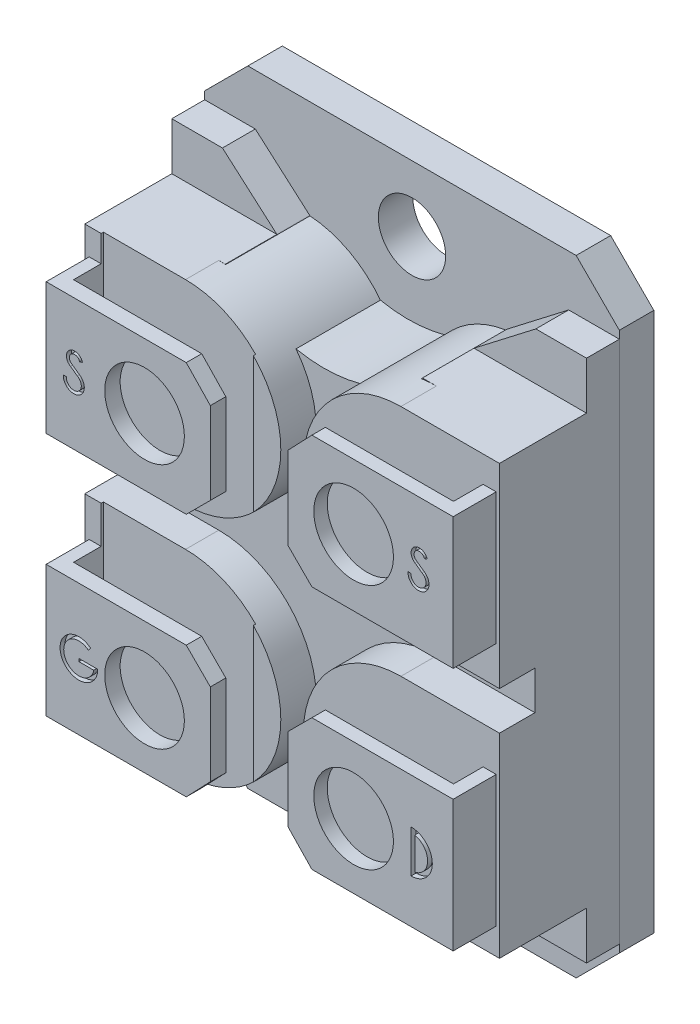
ISO-10303-21;
HEADER;
FILE_DESCRIPTION(('STEP AP214'),'2;1');
FILE_NAME('part.step','',(''),(''),'','','');
FILE_SCHEMA(('AUTOMOTIVE_DESIGN { 1 0 10303 214 1 1 1 1 }'));
ENDSEC;
DATA;
#1=APPLICATION_CONTEXT('core data for automotive mechanical design processes');
#2=APPLICATION_PROTOCOL_DEFINITION('international standard','automotive_design',2000,#1);
#3=PRODUCT_CONTEXT('',#1,'mechanical');
#4=PRODUCT('Part','Part','',(#3));
#5=PRODUCT_RELATED_PRODUCT_CATEGORY('part','',(#4));
#6=PRODUCT_DEFINITION_FORMATION('','',#4);
#7=PRODUCT_DEFINITION_CONTEXT('part definition',#1,'design');
#8=PRODUCT_DEFINITION('design','',#6,#7);
#9=PRODUCT_DEFINITION_SHAPE('','',#8);
#10=(LENGTH_UNIT() NAMED_UNIT(*) SI_UNIT(.MILLI.,.METRE.));
#11=(NAMED_UNIT(*) PLANE_ANGLE_UNIT() SI_UNIT($,.RADIAN.));
#12=(NAMED_UNIT(*) SI_UNIT($,.STERADIAN.) SOLID_ANGLE_UNIT());
#13=UNCERTAINTY_MEASURE_WITH_UNIT(LENGTH_MEASURE(1.E-05),#10,'distance_accuracy_value','');
#14=(GEOMETRIC_REPRESENTATION_CONTEXT(3) GLOBAL_UNCERTAINTY_ASSIGNED_CONTEXT((#13)) GLOBAL_UNIT_ASSIGNED_CONTEXT((#10,
#11,#12)) REPRESENTATION_CONTEXT('',''));
#15=CARTESIAN_POINT('',(0.,0.,0.));
#16=DIRECTION('',(0.,0.,1.));
#17=DIRECTION('',(1.,0.,0.));
#18=AXIS2_PLACEMENT_3D('',#15,#16,#17);
#19=CARTESIAN_POINT('',(-1.35589109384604E-09,2.62999999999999,2.1));
#20=DIRECTION('',(1.,0.,0.));
#21=DIRECTION('',(0.,0.,-1.));
#22=AXIS2_PLACEMENT_3D('',#19,#20,#21);
#23=PLANE('',#22);
#24=DIRECTION('',(0.,1.,0.));
#25=VECTOR('',#24,1.);
#26=CARTESIAN_POINT('',(0.,35.47,2.1));
#27=LINE('',#26,#25);
#28=CARTESIAN_POINT('',(0.,3.09999999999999,2.1));
#29=VERTEX_POINT('',#28);
#30=CARTESIAN_POINT('',(0.,35.,2.1));
#31=VERTEX_POINT('',#30);
#32=EDGE_CURVE('E796',#29,#31,#27,.T.);
#33=ORIENTED_EDGE('',*,*,#32,.F.);
#34=DIRECTION('',(0.,0.,-1.));
#35=VECTOR('',#34,1.);
#36=CARTESIAN_POINT('',(-1.35589109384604E-09,3.09999999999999,7.24));
#37=LINE('',#36,#35);
#38=CARTESIAN_POINT('',(-1.35589109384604E-09,3.09999999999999,4.1));
#39=VERTEX_POINT('',#38);
#40=EDGE_CURVE('E1445',#39,#29,#37,.T.);
#41=ORIENTED_EDGE('',*,*,#40,.F.);
#42=DIRECTION('',(-4.67548775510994E-10,-1.,0.));
#43=VECTOR('',#42,1.);
#44=CARTESIAN_POINT('',(-1.35589109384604E-09,3.09999999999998,4.1));
#45=LINE('',#44,#43);
#46=CARTESIAN_POINT('',(0.,5.99999999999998,4.1));
#47=VERTEX_POINT('',#46);
#48=EDGE_CURVE('E1336',#47,#39,#45,.T.);
#49=ORIENTED_EDGE('',*,*,#48,.F.);
#50=DIRECTION('',(0.,0.,-1.));
#51=VECTOR('',#50,1.);
#52=CARTESIAN_POINT('',(-1.35589109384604E-09,5.99999999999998,9.4));
#53=LINE('',#52,#51);
#54=CARTESIAN_POINT('',(-1.35589109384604E-09,5.99999999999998,9.4));
#55=VERTEX_POINT('',#54);
#56=EDGE_CURVE('E1542',#55,#47,#53,.T.);
#57=ORIENTED_EDGE('',*,*,#56,.F.);
#58=DIRECTION('',(0.,-1.,0.));
#59=VECTOR('',#58,1.);
#60=CARTESIAN_POINT('',(-1.35589109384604E-09,5.99999999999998,9.4));
#61=LINE('',#60,#59);
#62=CARTESIAN_POINT('',(-1.35589109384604E-09,17.875,9.4));
#63=VERTEX_POINT('',#62);
#64=EDGE_CURVE('E1534',#63,#55,#61,.T.);
#65=ORIENTED_EDGE('',*,*,#64,.F.);
#66=DIRECTION('',(0.,0.,-1.));
#67=VECTOR('',#66,1.);
#68=CARTESIAN_POINT('',(-1.35589109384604E-09,17.875,9.4));
#69=LINE('',#68,#67);
#70=CARTESIAN_POINT('',(-1.35589109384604E-09,17.875,7.24));
#71=VERTEX_POINT('',#70);
#72=EDGE_CURVE('E1544',#63,#71,#69,.T.);
#73=ORIENTED_EDGE('',*,*,#72,.T.);
#74=DIRECTION('',(0.,-1.,0.));
#75=VECTOR('',#74,1.);
#76=CARTESIAN_POINT('',(-1.35589109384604E-09,35.,7.24));
#77=LINE('',#76,#75);
#78=CARTESIAN_POINT('',(-1.35589109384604E-09,20.225,7.24));
#79=VERTEX_POINT('',#78);
#80=EDGE_CURVE('E1364',#79,#71,#77,.T.);
#81=ORIENTED_EDGE('',*,*,#80,.F.);
#82=DIRECTION('',(0.,0.,-1.));
#83=VECTOR('',#82,1.);
#84=CARTESIAN_POINT('',(-1.35589109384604E-09,20.225,9.4));
#85=LINE('',#84,#83);
#86=CARTESIAN_POINT('',(-1.35589109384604E-09,20.225,9.4));
#87=VERTEX_POINT('',#86);
#88=EDGE_CURVE('E1565',#87,#79,#85,.T.);
#89=ORIENTED_EDGE('',*,*,#88,.F.);
#90=DIRECTION('',(0.,-1.,0.));
#91=VECTOR('',#90,1.);
#92=CARTESIAN_POINT('',(-1.35589109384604E-09,32.1,9.4));
#93=LINE('',#92,#91);
#94=CARTESIAN_POINT('',(-1.35589109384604E-09,32.1,9.4));
#95=VERTEX_POINT('',#94);
#96=EDGE_CURVE('E1552',#95,#87,#93,.T.);
#97=ORIENTED_EDGE('',*,*,#96,.F.);
#98=DIRECTION('',(0.,0.,-1.));
#99=VECTOR('',#98,1.);
#100=CARTESIAN_POINT('',(-1.35589109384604E-09,32.1,9.4));
#101=LINE('',#100,#99);
#102=CARTESIAN_POINT('',(0.,32.1,4.1));
#103=VERTEX_POINT('',#102);
#104=EDGE_CURVE('E1573',#95,#103,#101,.T.);
#105=ORIENTED_EDGE('',*,*,#104,.T.);
#106=DIRECTION('',(4.67548775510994E-10,-1.,0.));
#107=VECTOR('',#106,1.);
#108=CARTESIAN_POINT('',(-1.35589109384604E-09,35.,4.1));
#109=LINE('',#108,#107);
#110=CARTESIAN_POINT('',(-1.35589109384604E-09,35.,4.1));
#111=VERTEX_POINT('',#110);
#112=EDGE_CURVE('E1346',#111,#103,#109,.T.);
#113=ORIENTED_EDGE('',*,*,#112,.F.);
#114=DIRECTION('',(0.,0.,-1.));
#115=VECTOR('',#114,1.);
#116=CARTESIAN_POINT('',(-1.35589109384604E-09,35.,7.24));
#117=LINE('',#116,#115);
#118=EDGE_CURVE('E1380',#111,#31,#117,.T.);
#119=ORIENTED_EDGE('',*,*,#118,.T.);
#120=EDGE_LOOP('',(#33,#41,#49,#57,#65,#73,#81,#89,#97,#105,#113,#119));
#121=FACE_BOUND('',#120,.T.);
#122=ADVANCED_FACE('F38',(#121),#23,.F.);
#123=CARTESIAN_POINT('',(25.2500000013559,2.62999999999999,2.1));
#124=DIRECTION('',(-1.,0.,0.));
#125=DIRECTION('',(0.,0.,1.));
#126=AXIS2_PLACEMENT_3D('',#123,#124,#125);
#127=PLANE('',#126);
#128=DIRECTION('',(0.,-1.,0.));
#129=VECTOR('',#128,1.);
#130=CARTESIAN_POINT('',(25.2500000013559,35.47,2.1));
#131=LINE('',#130,#129);
#132=CARTESIAN_POINT('',(25.2500000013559,35.,2.1));
#133=VERTEX_POINT('',#132);
#134=CARTESIAN_POINT('',(25.2500000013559,3.09999999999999,2.1));
#135=VERTEX_POINT('',#134);
#136=EDGE_CURVE('E804',#133,#135,#131,.T.);
#137=ORIENTED_EDGE('',*,*,#136,.F.);
#138=DIRECTION('',(0.,0.,-1.));
#139=VECTOR('',#138,1.);
#140=CARTESIAN_POINT('',(25.2500000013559,35.,7.24));
#141=LINE('',#140,#139);
#142=CARTESIAN_POINT('',(25.2500000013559,35.,4.1));
#143=VERTEX_POINT('',#142);
#144=EDGE_CURVE('E1427',#143,#133,#141,.T.);
#145=ORIENTED_EDGE('',*,*,#144,.F.);
#146=DIRECTION('',(0.,1.,0.));
#147=VECTOR('',#146,1.);
#148=CARTESIAN_POINT('',(25.2499999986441,35.,4.1));
#149=LINE('',#148,#147);
#150=CARTESIAN_POINT('',(25.2499999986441,32.1,4.1));
#151=VERTEX_POINT('',#150);
#152=EDGE_CURVE('E1354',#151,#143,#149,.T.);
#153=ORIENTED_EDGE('',*,*,#152,.F.);
#154=DIRECTION('',(0.,0.,-1.));
#155=VECTOR('',#154,1.);
#156=CARTESIAN_POINT('',(25.2500000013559,32.1,9.4));
#157=LINE('',#156,#155);
#158=CARTESIAN_POINT('',(25.2500000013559,32.1,9.4));
#159=VERTEX_POINT('',#158);
#160=EDGE_CURVE('E1520',#159,#151,#157,.T.);
#161=ORIENTED_EDGE('',*,*,#160,.F.);
#162=DIRECTION('',(0.,1.,0.));
#163=VECTOR('',#162,1.);
#164=CARTESIAN_POINT('',(25.2500000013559,32.1,9.4));
#165=LINE('',#164,#163);
#166=CARTESIAN_POINT('',(25.2500000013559,20.225,9.4));
#167=VERTEX_POINT('',#166);
#168=EDGE_CURVE('E1511',#167,#159,#165,.T.);
#169=ORIENTED_EDGE('',*,*,#168,.F.);
#170=DIRECTION('',(0.,0.,-1.));
#171=VECTOR('',#170,1.);
#172=CARTESIAN_POINT('',(25.2500000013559,20.225,9.4));
#173=LINE('',#172,#171);
#174=CARTESIAN_POINT('',(25.2500000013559,20.225,7.24));
#175=VERTEX_POINT('',#174);
#176=EDGE_CURVE('E1522',#167,#175,#173,.T.);
#177=ORIENTED_EDGE('',*,*,#176,.T.);
#178=DIRECTION('',(0.,1.,0.));
#179=VECTOR('',#178,1.);
#180=CARTESIAN_POINT('',(25.2500000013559,35.,7.24));
#181=LINE('',#180,#179);
#182=CARTESIAN_POINT('',(25.2500000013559,17.875,7.24));
#183=VERTEX_POINT('',#182);
#184=EDGE_CURVE('E1372',#183,#175,#181,.T.);
#185=ORIENTED_EDGE('',*,*,#184,.F.);
#186=DIRECTION('',(0.,0.,-1.));
#187=VECTOR('',#186,1.);
#188=CARTESIAN_POINT('',(25.2500000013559,17.875,9.4));
#189=LINE('',#188,#187);
#190=CARTESIAN_POINT('',(25.2500000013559,17.875,9.4));
#191=VERTEX_POINT('',#190);
#192=EDGE_CURVE('E1499',#191,#183,#189,.T.);
#193=ORIENTED_EDGE('',*,*,#192,.F.);
#194=DIRECTION('',(0.,1.,0.));
#195=VECTOR('',#194,1.);
#196=CARTESIAN_POINT('',(25.2500000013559,5.99999999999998,9.4));
#197=LINE('',#196,#195);
#198=CARTESIAN_POINT('',(25.2500000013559,5.99999999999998,9.4));
#199=VERTEX_POINT('',#198);
#200=EDGE_CURVE('E1490',#199,#191,#197,.T.);
#201=ORIENTED_EDGE('',*,*,#200,.F.);
#202=DIRECTION('',(0.,0.,-1.));
#203=VECTOR('',#202,1.);
#204=CARTESIAN_POINT('',(25.2500000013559,5.99999999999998,9.4));
#205=LINE('',#204,#203);
#206=CARTESIAN_POINT('',(25.2499999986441,5.99999999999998,4.1));
#207=VERTEX_POINT('',#206);
#208=EDGE_CURVE('E1501',#199,#207,#205,.T.);
#209=ORIENTED_EDGE('',*,*,#208,.T.);
#210=DIRECTION('',(0.,1.,0.));
#211=VECTOR('',#210,1.);
#212=CARTESIAN_POINT('',(25.2499999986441,3.09999999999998,4.1));
#213=LINE('',#212,#211);
#214=CARTESIAN_POINT('',(25.2499999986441,3.09999999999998,4.1));
#215=VERTEX_POINT('',#214);
#216=EDGE_CURVE('E1329',#215,#207,#213,.T.);
#217=ORIENTED_EDGE('',*,*,#216,.F.);
#218=DIRECTION('',(0.,0.,-1.));
#219=VECTOR('',#218,1.);
#220=CARTESIAN_POINT('',(25.2500000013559,3.09999999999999,7.24));
#221=LINE('',#220,#219);
#222=EDGE_CURVE('E1430',#215,#135,#221,.T.);
#223=ORIENTED_EDGE('',*,*,#222,.T.);
#224=EDGE_LOOP('',(#137,#145,#153,#161,#169,#177,#185,#193,#201,#209,#217,#223));
#225=FACE_BOUND('',#224,.T.);
#226=ADVANCED_FACE('F1717',(#225),#127,.F.);
#227=CARTESIAN_POINT('',(5.99999999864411,11.9375,9.4));
#228=DIRECTION('',(0.,0.,-1.));
#229=DIRECTION('',(-1.,0.,0.));
#230=AXIS2_PLACEMENT_3D('',#227,#228,#229);
#231=PLANE('',#230);
#232=DIRECTION('',(0.,1.,0.));
#233=VECTOR('',#232,1.);
#234=CARTESIAN_POINT('',(10.2666407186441,9.13335927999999,9.4));
#235=LINE('',#234,#233);
#236=CARTESIAN_POINT('',(10.2666407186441,7.80837379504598,9.4));
#237=VERTEX_POINT('',#236);
#238=CARTESIAN_POINT('',(10.2666407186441,16.066626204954,9.4));
#239=VERTEX_POINT('',#238);
#240=EDGE_CURVE('E1281',#237,#239,#235,.T.);
#241=ORIENTED_EDGE('',*,*,#240,.F.);
#242=CARTESIAN_POINT('',(5.99999999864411,11.9375,9.4));
#243=DIRECTION('',(0.,0.,1.));
#244=DIRECTION('',(-1.,0.,0.));
#245=AXIS2_PLACEMENT_3D('',#242,#243,#244);
#246=CIRCLE('',#245,5.9375);
#247=EDGE_CURVE('E1529',#237,#239,#246,.T.);
#248=ORIENTED_EDGE('',*,*,#247,.T.);
#249=EDGE_LOOP('',(#241,#248));
#250=FACE_BOUND('',#249,.T.);
#251=ADVANCED_FACE('F1723',(#250),#231,.F.);
#252=CARTESIAN_POINT('',(5.99999999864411,26.1625,9.4));
#253=DIRECTION('',(0.,0.,1.));
#254=DIRECTION('',(1.,0.,0.));
#255=AXIS2_PLACEMENT_3D('',#252,#253,#254);
#256=PLANE('',#255);
#257=CARTESIAN_POINT('',(5.99999999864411,26.1625,9.4));
#258=DIRECTION('',(0.,0.,1.));
#259=DIRECTION('',(1.,0.,0.));
#260=AXIS2_PLACEMENT_3D('',#257,#258,#259);
#261=CIRCLE('',#260,5.9375);
#262=CARTESIAN_POINT('',(10.2666407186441,22.033373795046,9.4));
#263=VERTEX_POINT('',#262);
#264=CARTESIAN_POINT('',(10.2666407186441,30.291626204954,9.4));
#265=VERTEX_POINT('',#264);
#266=EDGE_CURVE('E1556',#263,#265,#261,.T.);
#267=ORIENTED_EDGE('',*,*,#266,.T.);
#268=DIRECTION('',(0.,1.,0.));
#269=VECTOR('',#268,1.);
#270=CARTESIAN_POINT('',(10.2666407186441,28.96664072,9.4));
#271=LINE('',#270,#269);
#272=EDGE_CURVE('E1311',#263,#265,#271,.T.);
#273=ORIENTED_EDGE('',*,*,#272,.F.);
#274=EDGE_LOOP('',(#267,#273));
#275=FACE_BOUND('',#274,.T.);
#276=ADVANCED_FACE('F2116',(#275),#256,.T.);
#277=CARTESIAN_POINT('',(25.2500000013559,22.5,12.02));
#278=DIRECTION('',(0.,1.,0.));
#279=DIRECTION('',(-1.,0.,0.));
#280=AXIS2_PLACEMENT_3D('',#277,#278,#279);
#281=PLANE('',#280);
#282=DIRECTION('',(0.,0.,-1.));
#283=VECTOR('',#282,1.);
#284=CARTESIAN_POINT('',(25.0500000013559,22.5,12.02));
#285=LINE('',#284,#283);
#286=CARTESIAN_POINT('',(25.0500000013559,22.5,12.02));
#287=VERTEX_POINT('',#286);
#288=CARTESIAN_POINT('',(25.0500000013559,22.5,9.4));
#289=VERTEX_POINT('',#288);
#290=EDGE_CURVE('E1168',#287,#289,#285,.T.);
#291=ORIENTED_EDGE('',*,*,#290,.F.);
#292=DIRECTION('',(1.,0.,0.));
#293=VECTOR('',#292,1.);
#294=CARTESIAN_POINT('',(25.2500000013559,22.5,12.02));
#295=LINE('',#294,#293);
#296=CARTESIAN_POINT('',(16.4500000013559,22.5,12.02));
#297=VERTEX_POINT('',#296);
#298=EDGE_CURVE('E1244',#297,#287,#295,.T.);
#299=ORIENTED_EDGE('',*,*,#298,.F.);
#300=DIRECTION('',(0.,0.,-1.));
#301=VECTOR('',#300,1.);
#302=CARTESIAN_POINT('',(16.4500000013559,22.5,12.02));
#303=LINE('',#302,#301);
#304=CARTESIAN_POINT('',(16.4500000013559,22.5,11.2));
#305=VERTEX_POINT('',#304);
#306=EDGE_CURVE('E1260',#297,#305,#303,.T.);
#307=ORIENTED_EDGE('',*,*,#306,.T.);
#308=DIRECTION('',(1.,0.,0.));
#309=VECTOR('',#308,1.);
#310=CARTESIAN_POINT('',(25.2500000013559,22.5,11.2));
#311=LINE('',#310,#309);
#312=CARTESIAN_POINT('',(24.2533592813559,22.5,11.2));
#313=VERTEX_POINT('',#312);
#314=EDGE_CURVE('E1200',#305,#313,#311,.T.);
#315=ORIENTED_EDGE('',*,*,#314,.T.);
#316=DIRECTION('',(0.,0.,1.));
#317=VECTOR('',#316,1.);
#318=CARTESIAN_POINT('',(24.2533592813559,22.5,12.02));
#319=LINE('',#318,#317);
#320=CARTESIAN_POINT('',(24.2533592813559,22.5,9.4));
#321=VERTEX_POINT('',#320);
#322=EDGE_CURVE('E1206',#321,#313,#319,.T.);
#323=ORIENTED_EDGE('',*,*,#322,.F.);
#324=DIRECTION('',(1.,0.,0.));
#325=VECTOR('',#324,1.);
#326=CARTESIAN_POINT('',(25.2500000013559,22.5,9.4));
#327=LINE('',#326,#325);
#328=EDGE_CURVE('E1237',#321,#289,#327,.T.);
#329=ORIENTED_EDGE('',*,*,#328,.T.);
#330=EDGE_LOOP('',(#291,#299,#307,#315,#323,#329));
#331=FACE_BOUND('',#330,.T.);
#332=ADVANCED_FACE('F2121',(#331),#281,.F.);
#333=CARTESIAN_POINT('',(25.2500000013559,30.5,12.02));
#334=DIRECTION('',(0.,-1.,0.));
#335=DIRECTION('',(1.,0.,0.));
#336=AXIS2_PLACEMENT_3D('',#333,#334,#335);
#337=PLANE('',#336);
#338=DIRECTION('',(0.,0.,1.));
#339=VECTOR('',#338,1.);
#340=CARTESIAN_POINT('',(25.0500000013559,30.5,12.02));
#341=LINE('',#340,#339);
#342=CARTESIAN_POINT('',(25.0500000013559,30.5,9.4));
#343=VERTEX_POINT('',#342);
#344=CARTESIAN_POINT('',(25.0500000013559,30.5,12.02));
#345=VERTEX_POINT('',#344);
#346=EDGE_CURVE('E1166',#343,#345,#341,.T.);
#347=ORIENTED_EDGE('',*,*,#346,.F.);
#348=DIRECTION('',(-1.,0.,0.));
#349=VECTOR('',#348,1.);
#350=CARTESIAN_POINT('',(25.2500000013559,30.5,9.4));
#351=LINE('',#350,#349);
#352=CARTESIAN_POINT('',(24.2533592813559,30.5,9.4));
#353=VERTEX_POINT('',#352);
#354=EDGE_CURVE('E1242',#343,#353,#351,.T.);
#355=ORIENTED_EDGE('',*,*,#354,.T.);
#356=DIRECTION('',(0.,0.,-1.));
#357=VECTOR('',#356,1.);
#358=CARTESIAN_POINT('',(24.2533592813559,30.5,9.4));
#359=LINE('',#358,#357);
#360=CARTESIAN_POINT('',(24.2533592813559,30.5,11.2));
#361=VERTEX_POINT('',#360);
#362=EDGE_CURVE('E1181',#361,#353,#359,.T.);
#363=ORIENTED_EDGE('',*,*,#362,.F.);
#364=DIRECTION('',(-1.,0.,0.));
#365=VECTOR('',#364,1.);
#366=CARTESIAN_POINT('',(24.2533592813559,30.5,11.2));
#367=LINE('',#366,#365);
#368=CARTESIAN_POINT('',(16.4500000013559,30.5,11.2));
#369=VERTEX_POINT('',#368);
#370=EDGE_CURVE('E1187',#361,#369,#367,.T.);
#371=ORIENTED_EDGE('',*,*,#370,.T.);
#372=DIRECTION('',(0.,0.,-1.));
#373=VECTOR('',#372,1.);
#374=CARTESIAN_POINT('',(16.4500000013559,30.5,12.02));
#375=LINE('',#374,#373);
#376=CARTESIAN_POINT('',(16.4500000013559,30.5,12.02));
#377=VERTEX_POINT('',#376);
#378=EDGE_CURVE('E1257',#377,#369,#375,.T.);
#379=ORIENTED_EDGE('',*,*,#378,.F.);
#380=DIRECTION('',(-1.,0.,0.));
#381=VECTOR('',#380,1.);
#382=CARTESIAN_POINT('',(25.2500000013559,30.5,12.02));
#383=LINE('',#382,#381);
#384=EDGE_CURVE('E1247',#345,#377,#383,.T.);
#385=ORIENTED_EDGE('',*,*,#384,.F.);
#386=EDGE_LOOP('',(#347,#355,#363,#371,#379,#385));
#387=FACE_BOUND('',#386,.T.);
#388=ADVANCED_FACE('F2538',(#387),#337,.F.);
#389=CARTESIAN_POINT('',(14.9833592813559,22.5,12.02));
#390=DIRECTION('',(0.,0.,-1.));
#391=DIRECTION('',(-1.,0.,0.));
#392=AXIS2_PLACEMENT_3D('',#389,#390,#391);
#393=PLANE('',#392);
#394=DIRECTION('',(-0.997497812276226,0.0706973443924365,0.));
#395=VECTOR('',#394,1.);
#396=CARTESIAN_POINT('',(22.4842358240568,26.2203484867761,12.02));
#397=LINE('',#396,#395);
#398=CARTESIAN_POINT('',(22.4842358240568,26.2203484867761,12.02));
#399=VERTEX_POINT('',#398);
#400=CARTESIAN_POINT('',(22.302517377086,26.233227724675,12.02));
#401=VERTEX_POINT('',#400);
#402=EDGE_CURVE('E934',#399,#401,#397,.T.);
#403=ORIENTED_EDGE('',*,*,#402,.F.);
#404=CARTESIAN_POINT('',(22.9400893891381,26.1880400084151,12.02));
#405=DIRECTION('',(0.,0.,-1.));
#406=DIRECTION('',(1.,0.,0.));
#407=AXIS2_PLACEMENT_3D('',#404,#405,#406);
#408=CIRCLE('',#407,0.456997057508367);
#409=CARTESIAN_POINT('',(23.1565452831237,26.5905237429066,12.02));
#410=VERTEX_POINT('',#409);
#411=EDGE_CURVE('E896',#410,#399,#408,.T.);
#412=ORIENTED_EDGE('',*,*,#411,.F.);
#413=DIRECTION('',(0.810294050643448,-0.586023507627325,0.));
#414=VECTOR('',#413,1.);
#415=CARTESIAN_POINT('',(22.7276192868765,26.9007330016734,12.02));
#416=LINE('',#415,#414);
#417=CARTESIAN_POINT('',(22.7276192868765,26.9007330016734,12.02));
#418=VERTEX_POINT('',#417);
#419=EDGE_CURVE('E911',#418,#410,#416,.T.);
#420=ORIENTED_EDGE('',*,*,#419,.F.);
#421=CARTESIAN_POINT('',(22.990419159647,27.3260989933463,12.02));
#422=DIRECTION('',(0.,0.,1.));
#423=DIRECTION('',(1.,0.,0.));
#424=AXIS2_PLACEMENT_3D('',#421,#422,#423);
#425=CIRCLE('',#424,0.500000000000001);
#426=CARTESIAN_POINT('',(23.4711674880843,27.4635073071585,12.02));
#427=VERTEX_POINT('',#426);
#428=EDGE_CURVE('E949',#427,#418,#425,.T.);
#429=ORIENTED_EDGE('',*,*,#428,.F.);
#430=DIRECTION('',(0.961496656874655,0.274816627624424,0.));
#431=VECTOR('',#430,1.);
#432=CARTESIAN_POINT('',(23.2974068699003,27.4138427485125,12.02));
#433=LINE('',#432,#431);
#434=CARTESIAN_POINT('',(23.2974068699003,27.4138427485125,12.02));
#435=VERTEX_POINT('',#434);
#436=EDGE_CURVE('E946',#435,#427,#433,.T.);
#437=ORIENTED_EDGE('',*,*,#436,.F.);
#438=CARTESIAN_POINT('',(22.990419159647,27.3260989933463,12.02));
#439=DIRECTION('',(0.,0.,-1.));
#440=DIRECTION('',(1.,0.,0.));
#441=AXIS2_PLACEMENT_3D('',#438,#439,#440);
#442=CIRCLE('',#441,0.319281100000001);
#443=CARTESIAN_POINT('',(22.8061554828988,27.0653552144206,12.02));
#444=VERTEX_POINT('',#443);
#445=EDGE_CURVE('E943',#444,#435,#442,.T.);
#446=ORIENTED_EDGE('',*,*,#445,.F.);
#447=DIRECTION('',(-0.816658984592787,0.577120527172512,0.));
#448=VECTOR('',#447,1.);
#449=CARTESIAN_POINT('',(23.308968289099,26.7100250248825,12.02));
#450=LINE('',#449,#448);
#451=CARTESIAN_POINT('',(23.308968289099,26.7100250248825,12.02));
#452=VERTEX_POINT('',#451);
#453=EDGE_CURVE('E940',#452,#444,#450,.T.);
#454=ORIENTED_EDGE('',*,*,#453,.F.);
#455=CARTESIAN_POINT('',(22.9400893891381,26.1880400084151,12.02));
#456=DIRECTION('',(0.,0.,1.));
#457=DIRECTION('',(1.,0.,0.));
#458=AXIS2_PLACEMENT_3D('',#455,#456,#457);
#459=CIRCLE('',#458,0.639171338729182);
#460=EDGE_CURVE('E937',#401,#452,#459,.T.);
#461=ORIENTED_EDGE('',*,*,#460,.F.);
#462=EDGE_LOOP('',(#403,#412,#420,#429,#437,#446,#454,#461));
#463=FACE_BOUND('',#462,.T.);
#464=CARTESIAN_POINT('',(18.99,26.55,12.02));
#465=DIRECTION('',(0.,0.,1.));
#466=DIRECTION('',(1.,0.,0.));
#467=AXIS2_PLACEMENT_3D('',#464,#465,#466);
#468=CIRCLE('',#467,2.425);
#469=CARTESIAN_POINT('',(21.415,26.55,12.02));
#470=VERTEX_POINT('',#469);
#471=EDGE_CURVE('E1041',#470,#470,#468,.T.);
#472=ORIENTED_EDGE('',*,*,#471,.F.);
#473=EDGE_LOOP('',(#472));
#474=FACE_BOUND('',#473,.T.);
#475=DIRECTION('',(0.,-1.,0.));
#476=VECTOR('',#475,1.);
#477=CARTESIAN_POINT('',(25.0500000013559,22.5,12.02));
#478=LINE('',#477,#476);
#479=EDGE_CURVE('E1164',#345,#287,#478,.T.);
#480=ORIENTED_EDGE('',*,*,#479,.F.);
#481=ORIENTED_EDGE('',*,*,#384,.T.);
#482=DIRECTION('',(-0.691210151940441,-0.722653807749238,0.));
#483=VECTOR('',#482,1.);
#484=CARTESIAN_POINT('',(14.9833592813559,28.96664072,12.02));
#485=LINE('',#484,#483);
#486=CARTESIAN_POINT('',(14.9833592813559,28.96664072,12.02));
#487=VERTEX_POINT('',#486);
#488=EDGE_CURVE('E1249',#377,#487,#485,.T.);
#489=ORIENTED_EDGE('',*,*,#488,.T.);
#490=DIRECTION('',(0.,-1.,0.));
#491=VECTOR('',#490,1.);
#492=CARTESIAN_POINT('',(14.9833592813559,28.96664072,12.02));
#493=LINE('',#492,#491);
#494=CARTESIAN_POINT('',(14.9833592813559,23.96664072,12.02));
#495=VERTEX_POINT('',#494);
#496=EDGE_CURVE('E1238',#487,#495,#493,.T.);
#497=ORIENTED_EDGE('',*,*,#496,.T.);
#498=DIRECTION('',(0.707106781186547,-0.707106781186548,0.));
#499=VECTOR('',#498,1.);
#500=CARTESIAN_POINT('',(14.9833592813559,23.96664072,12.02));
#501=LINE('',#500,#499);
#502=EDGE_CURVE('E1241',#495,#297,#501,.T.);
#503=ORIENTED_EDGE('',*,*,#502,.T.);
#504=ORIENTED_EDGE('',*,*,#298,.T.);
#505=EDGE_LOOP('',(#480,#481,#489,#497,#503,#504));
#506=FACE_BOUND('',#505,.T.);
#507=ADVANCED_FACE('F2532',(#463,#474,#506),#393,.F.);
#508=CARTESIAN_POINT('',(25.2500000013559,7.59999999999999,12.02));
#509=DIRECTION('',(0.,1.,0.));
#510=DIRECTION('',(-1.,0.,0.));
#511=AXIS2_PLACEMENT_3D('',#508,#509,#510);
#512=PLANE('',#511);
#513=DIRECTION('',(0.,0.,-1.));
#514=VECTOR('',#513,1.);
#515=CARTESIAN_POINT('',(25.0500000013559,7.59999999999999,12.02));
#516=LINE('',#515,#514);
#517=CARTESIAN_POINT('',(25.0500000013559,7.59999999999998,12.02));
#518=VERTEX_POINT('',#517);
#519=CARTESIAN_POINT('',(25.0500000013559,7.59999999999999,9.4));
#520=VERTEX_POINT('',#519);
#521=EDGE_CURVE('E1162',#518,#520,#516,.T.);
#522=ORIENTED_EDGE('',*,*,#521,.F.);
#523=DIRECTION('',(1.,0.,0.));
#524=VECTOR('',#523,1.);
#525=CARTESIAN_POINT('',(25.2500000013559,7.59999999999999,12.02));
#526=LINE('',#525,#524);
#527=CARTESIAN_POINT('',(16.4500000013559,7.59999999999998,12.02));
#528=VERTEX_POINT('',#527);
#529=EDGE_CURVE('E1215',#528,#518,#526,.T.);
#530=ORIENTED_EDGE('',*,*,#529,.F.);
#531=DIRECTION('',(0.,0.,-1.));
#532=VECTOR('',#531,1.);
#533=CARTESIAN_POINT('',(16.4500000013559,7.59999999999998,12.02));
#534=LINE('',#533,#532);
#535=CARTESIAN_POINT('',(16.4500000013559,7.59999999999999,11.2));
#536=VERTEX_POINT('',#535);
#537=EDGE_CURVE('E1231',#528,#536,#534,.T.);
#538=ORIENTED_EDGE('',*,*,#537,.T.);
#539=DIRECTION('',(-1.,0.,0.));
#540=VECTOR('',#539,1.);
#541=CARTESIAN_POINT('',(24.2533592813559,7.59999999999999,11.2));
#542=LINE('',#541,#540);
#543=CARTESIAN_POINT('',(24.2533592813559,7.59999999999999,11.2));
#544=VERTEX_POINT('',#543);
#545=EDGE_CURVE('E1184',#544,#536,#542,.T.);
#546=ORIENTED_EDGE('',*,*,#545,.F.);
#547=DIRECTION('',(0.,0.,1.));
#548=VECTOR('',#547,1.);
#549=CARTESIAN_POINT('',(24.2533592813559,7.59999999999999,9.4));
#550=LINE('',#549,#548);
#551=CARTESIAN_POINT('',(24.2533592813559,7.59999999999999,9.4));
#552=VERTEX_POINT('',#551);
#553=EDGE_CURVE('E1173',#552,#544,#550,.T.);
#554=ORIENTED_EDGE('',*,*,#553,.F.);
#555=DIRECTION('',(1.,0.,0.));
#556=VECTOR('',#555,1.);
#557=CARTESIAN_POINT('',(25.2500000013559,7.59999999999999,9.4));
#558=LINE('',#557,#556);
#559=EDGE_CURVE('E1208',#552,#520,#558,.T.);
#560=ORIENTED_EDGE('',*,*,#559,.T.);
#561=EDGE_LOOP('',(#522,#530,#538,#546,#554,#560));
#562=FACE_BOUND('',#561,.T.);
#563=ADVANCED_FACE('F2537',(#562),#512,.F.);
#564=CARTESIAN_POINT('',(25.2500000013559,15.6,12.02));
#565=DIRECTION('',(0.,-1.,0.));
#566=DIRECTION('',(1.,0.,0.));
#567=AXIS2_PLACEMENT_3D('',#564,#565,#566);
#568=PLANE('',#567);
#569=DIRECTION('',(0.,0.,1.));
#570=VECTOR('',#569,1.);
#571=CARTESIAN_POINT('',(25.0500000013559,15.6,12.02));
#572=LINE('',#571,#570);
#573=CARTESIAN_POINT('',(25.0500000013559,15.6,9.4));
#574=VERTEX_POINT('',#573);
#575=CARTESIAN_POINT('',(25.0500000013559,15.6,12.02));
#576=VERTEX_POINT('',#575);
#577=EDGE_CURVE('E1160',#574,#576,#572,.T.);
#578=ORIENTED_EDGE('',*,*,#577,.F.);
#579=DIRECTION('',(-1.,0.,0.));
#580=VECTOR('',#579,1.);
#581=CARTESIAN_POINT('',(25.2500000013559,15.6,9.4));
#582=LINE('',#581,#580);
#583=CARTESIAN_POINT('',(24.2533592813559,15.6,9.4));
#584=VERTEX_POINT('',#583);
#585=EDGE_CURVE('E1213',#574,#584,#582,.T.);
#586=ORIENTED_EDGE('',*,*,#585,.T.);
#587=DIRECTION('',(0.,0.,-1.));
#588=VECTOR('',#587,1.);
#589=CARTESIAN_POINT('',(24.2533592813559,15.6,12.02));
#590=LINE('',#589,#588);
#591=CARTESIAN_POINT('',(24.2533592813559,15.6,11.2));
#592=VERTEX_POINT('',#591);
#593=EDGE_CURVE('E1677',#592,#584,#590,.T.);
#594=ORIENTED_EDGE('',*,*,#593,.F.);
#595=DIRECTION('',(-1.,0.,0.));
#596=VECTOR('',#595,1.);
#597=CARTESIAN_POINT('',(25.2500000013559,15.6,11.2));
#598=LINE('',#597,#596);
#599=CARTESIAN_POINT('',(16.4500000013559,15.6,11.2));
#600=VERTEX_POINT('',#599);
#601=EDGE_CURVE('E1190',#592,#600,#598,.T.);
#602=ORIENTED_EDGE('',*,*,#601,.T.);
#603=DIRECTION('',(0.,0.,-1.));
#604=VECTOR('',#603,1.);
#605=CARTESIAN_POINT('',(16.4500000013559,15.6,12.02));
#606=LINE('',#605,#604);
#607=CARTESIAN_POINT('',(16.4500000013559,15.6,12.02));
#608=VERTEX_POINT('',#607);
#609=EDGE_CURVE('E1228',#608,#600,#606,.T.);
#610=ORIENTED_EDGE('',*,*,#609,.F.);
#611=DIRECTION('',(-1.,0.,0.));
#612=VECTOR('',#611,1.);
#613=CARTESIAN_POINT('',(25.2500000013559,15.6,12.02));
#614=LINE('',#613,#612);
#615=EDGE_CURVE('E1218',#576,#608,#614,.T.);
#616=ORIENTED_EDGE('',*,*,#615,.F.);
#617=EDGE_LOOP('',(#578,#586,#594,#602,#610,#616));
#618=FACE_BOUND('',#617,.T.);
#619=ADVANCED_FACE('F2657',(#618),#568,.F.);
#620=CARTESIAN_POINT('',(14.9833592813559,15.6,12.02));
#621=DIRECTION('',(0.,0.,1.));
#622=DIRECTION('',(1.,0.,0.));
#623=AXIS2_PLACEMENT_3D('',#620,#621,#622);
#624=PLANE('',#623);
#625=CARTESIAN_POINT('',(22.4906426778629,11.5670686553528,12.02));
#626=DIRECTION('',(0.,0.,1.));
#627=DIRECTION('',(1.,0.,0.));
#628=AXIS2_PLACEMENT_3D('',#625,#626,#627);
#629=CIRCLE('',#628,1.29156230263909);
#630=CARTESIAN_POINT('',(22.4906426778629,10.2755063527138,12.02));
#631=VERTEX_POINT('',#630);
#632=CARTESIAN_POINT('',(22.4906426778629,12.8586309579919,12.02));
#633=VERTEX_POINT('',#632);
#634=EDGE_CURVE('E55',#631,#633,#629,.T.);
#635=ORIENTED_EDGE('',*,*,#634,.F.);
#636=DIRECTION('',(0.,-1.,0.));
#637=VECTOR('',#636,1.);
#638=CARTESIAN_POINT('',(22.4906426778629,12.8586309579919,12.02));
#639=LINE('',#638,#637);
#640=EDGE_CURVE('E848',#633,#631,#639,.T.);
#641=ORIENTED_EDGE('',*,*,#640,.F.);
#642=EDGE_LOOP('',(#635,#641));
#643=FACE_BOUND('',#642,.T.);
#644=CARTESIAN_POINT('',(18.99,11.55,12.02));
#645=DIRECTION('',(0.,0.,1.));
#646=DIRECTION('',(1.,0.,0.));
#647=AXIS2_PLACEMENT_3D('',#644,#645,#646);
#648=CIRCLE('',#647,2.425);
#649=CARTESIAN_POINT('',(21.415,11.55,12.02));
#650=VERTEX_POINT('',#649);
#651=EDGE_CURVE('E1045',#650,#650,#648,.T.);
#652=ORIENTED_EDGE('',*,*,#651,.F.);
#653=EDGE_LOOP('',(#652));
#654=FACE_BOUND('',#653,.T.);
#655=ORIENTED_EDGE('',*,*,#529,.T.);
#656=DIRECTION('',(0.,1.,0.));
#657=VECTOR('',#656,1.);
#658=CARTESIAN_POINT('',(25.0500000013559,15.6,12.02));
#659=LINE('',#658,#657);
#660=EDGE_CURVE('E1680',#518,#576,#659,.T.);
#661=ORIENTED_EDGE('',*,*,#660,.T.);
#662=ORIENTED_EDGE('',*,*,#615,.T.);
#663=DIRECTION('',(-0.707106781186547,-0.707106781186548,0.));
#664=VECTOR('',#663,1.);
#665=CARTESIAN_POINT('',(14.9833592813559,14.13335928,12.02));
#666=LINE('',#665,#664);
#667=CARTESIAN_POINT('',(14.9833592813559,14.13335928,12.02));
#668=VERTEX_POINT('',#667);
#669=EDGE_CURVE('E1220',#608,#668,#666,.T.);
#670=ORIENTED_EDGE('',*,*,#669,.T.);
#671=DIRECTION('',(0.,-1.,0.));
#672=VECTOR('',#671,1.);
#673=CARTESIAN_POINT('',(14.9833592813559,9.13335927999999,12.02));
#674=LINE('',#673,#672);
#675=CARTESIAN_POINT('',(14.9833592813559,9.13335927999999,12.02));
#676=VERTEX_POINT('',#675);
#677=EDGE_CURVE('E1209',#668,#676,#674,.T.);
#678=ORIENTED_EDGE('',*,*,#677,.T.);
#679=DIRECTION('',(0.691210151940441,-0.722653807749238,0.));
#680=VECTOR('',#679,1.);
#681=CARTESIAN_POINT('',(14.9833592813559,9.13335927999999,12.02));
#682=LINE('',#681,#680);
#683=EDGE_CURVE('E1212',#676,#528,#682,.T.);
#684=ORIENTED_EDGE('',*,*,#683,.T.);
#685=EDGE_LOOP('',(#655,#661,#662,#670,#678,#684));
#686=FACE_BOUND('',#685,.T.);
#687=ADVANCED_FACE('F1821',(#643,#654,#686),#624,.T.);
#688=CARTESIAN_POINT('',(19.2500000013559,11.9375,9.4));
#689=DIRECTION('',(0.,0.,1.));
#690=DIRECTION('',(1.,0.,0.));
#691=AXIS2_PLACEMENT_3D('',#688,#689,#690);
#692=PLANE('',#691);
#693=DIRECTION('',(0.,1.,0.));
#694=VECTOR('',#693,1.);
#695=CARTESIAN_POINT('',(25.0500000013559,31.5238452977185,9.4));
#696=LINE('',#695,#694);
#697=EDGE_CURVE('E1159',#520,#574,#696,.T.);
#698=ORIENTED_EDGE('',*,*,#697,.F.);
#699=ORIENTED_EDGE('',*,*,#559,.F.);
#700=DIRECTION('',(0.,-1.,0.));
#701=VECTOR('',#700,1.);
#702=CARTESIAN_POINT('',(24.2533592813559,30.5,9.4));
#703=LINE('',#702,#701);
#704=EDGE_CURVE('E1174',#584,#552,#703,.T.);
#705=ORIENTED_EDGE('',*,*,#704,.F.);
#706=ORIENTED_EDGE('',*,*,#585,.F.);
#707=EDGE_LOOP('',(#698,#699,#705,#706));
#708=FACE_BOUND('',#707,.T.);
#709=DIRECTION('',(-1.,0.,0.));
#710=VECTOR('',#709,1.);
#711=CARTESIAN_POINT('',(25.2500000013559,17.875,9.4));
#712=LINE('',#711,#710);
#713=CARTESIAN_POINT('',(19.2500000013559,17.875,9.4));
#714=VERTEX_POINT('',#713);
#715=EDGE_CURVE('E1492',#191,#714,#712,.T.);
#716=ORIENTED_EDGE('',*,*,#715,.T.);
#717=CARTESIAN_POINT('',(19.2500000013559,11.9375,9.4));
#718=DIRECTION('',(0.,0.,1.));
#719=DIRECTION('',(1.,0.,0.));
#720=AXIS2_PLACEMENT_3D('',#717,#718,#719);
#721=CIRCLE('',#720,5.9375);
#722=CARTESIAN_POINT('',(19.2500000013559,5.99999999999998,9.4));
#723=VERTEX_POINT('',#722);
#724=EDGE_CURVE('E1486',#714,#723,#721,.T.);
#725=ORIENTED_EDGE('',*,*,#724,.T.);
#726=DIRECTION('',(1.,0.,0.));
#727=VECTOR('',#726,1.);
#728=CARTESIAN_POINT('',(25.2500000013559,5.99999999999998,9.4));
#729=LINE('',#728,#727);
#730=EDGE_CURVE('E1488',#723,#199,#729,.T.);
#731=ORIENTED_EDGE('',*,*,#730,.T.);
#732=ORIENTED_EDGE('',*,*,#200,.T.);
#733=EDGE_LOOP('',(#716,#725,#731,#732));
#734=FACE_BOUND('',#733,.T.);
#735=ADVANCED_FACE('F2133',(#708,#734),#692,.T.);
#736=CARTESIAN_POINT('',(19.2500000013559,26.1625,9.4));
#737=DIRECTION('',(0.,0.,-1.));
#738=DIRECTION('',(-1.,0.,0.));
#739=AXIS2_PLACEMENT_3D('',#736,#737,#738);
#740=PLANE('',#739);
#741=ORIENTED_EDGE('',*,*,#168,.T.);
#742=DIRECTION('',(-1.,0.,0.));
#743=VECTOR('',#742,1.);
#744=CARTESIAN_POINT('',(25.2500000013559,32.1,9.4));
#745=LINE('',#744,#743);
#746=CARTESIAN_POINT('',(19.2500000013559,32.1,9.4));
#747=VERTEX_POINT('',#746);
#748=EDGE_CURVE('E1513',#159,#747,#745,.T.);
#749=ORIENTED_EDGE('',*,*,#748,.T.);
#750=CARTESIAN_POINT('',(19.2500000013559,26.1625,9.4));
#751=DIRECTION('',(0.,0.,1.));
#752=DIRECTION('',(-1.,0.,0.));
#753=AXIS2_PLACEMENT_3D('',#750,#751,#752);
#754=CIRCLE('',#753,5.9375);
#755=CARTESIAN_POINT('',(19.2500000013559,20.225,9.4));
#756=VERTEX_POINT('',#755);
#757=EDGE_CURVE('E1507',#747,#756,#754,.T.);
#758=ORIENTED_EDGE('',*,*,#757,.T.);
#759=DIRECTION('',(1.,0.,0.));
#760=VECTOR('',#759,1.);
#761=CARTESIAN_POINT('',(25.2500000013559,20.225,9.4));
#762=LINE('',#761,#760);
#763=EDGE_CURVE('E1509',#756,#167,#762,.T.);
#764=ORIENTED_EDGE('',*,*,#763,.T.);
#765=EDGE_LOOP('',(#741,#749,#758,#764));
#766=FACE_BOUND('',#765,.T.);
#767=ORIENTED_EDGE('',*,*,#354,.F.);
#768=EDGE_CURVE('E1157',#289,#343,#696,.T.);
#769=ORIENTED_EDGE('',*,*,#768,.F.);
#770=ORIENTED_EDGE('',*,*,#328,.F.);
#771=EDGE_CURVE('E1171',#353,#321,#703,.T.);
#772=ORIENTED_EDGE('',*,*,#771,.F.);
#773=EDGE_LOOP('',(#767,#769,#770,#772));
#774=FACE_BOUND('',#773,.T.);
#775=ADVANCED_FACE('F2127',(#766,#774),#740,.F.);
#776=DIRECTION('',(-1.,0.,0.));
#777=VECTOR('',#776,1.);
#778=CARTESIAN_POINT('',(-1.35589109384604E-09,17.875,9.4));
#779=LINE('',#778,#777);
#780=CARTESIAN_POINT('',(0.996640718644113,17.875,9.4));
#781=VERTEX_POINT('',#780);
#782=EDGE_CURVE('E1532',#781,#63,#779,.T.);
#783=ORIENTED_EDGE('',*,*,#782,.T.);
#784=ORIENTED_EDGE('',*,*,#64,.T.);
#785=DIRECTION('',(1.,0.,0.));
#786=VECTOR('',#785,1.);
#787=CARTESIAN_POINT('',(-1.35589109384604E-09,5.99999999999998,9.4));
#788=LINE('',#787,#786);
#789=CARTESIAN_POINT('',(0.996640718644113,5.99999999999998,9.4));
#790=VERTEX_POINT('',#789);
#791=EDGE_CURVE('E1536',#55,#790,#788,.T.);
#792=ORIENTED_EDGE('',*,*,#791,.T.);
#793=DIRECTION('',(0.,1.,0.));
#794=VECTOR('',#793,1.);
#795=CARTESIAN_POINT('',(0.996640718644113,11.9375,9.4));
#796=LINE('',#795,#794);
#797=CARTESIAN_POINT('',(0.996640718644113,7.59999999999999,9.4));
#798=VERTEX_POINT('',#797);
#799=EDGE_CURVE('E1085',#790,#798,#796,.T.);
#800=ORIENTED_EDGE('',*,*,#799,.T.);
#801=DIRECTION('',(1.,0.,0.));
#802=VECTOR('',#801,1.);
#803=CARTESIAN_POINT('',(-1.35589109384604E-09,7.59999999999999,9.4));
#804=LINE('',#803,#802);
#805=CARTESIAN_POINT('',(0.27,7.59999999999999,9.4));
#806=VERTEX_POINT('',#805);
#807=EDGE_CURVE('E1266',#806,#798,#804,.T.);
#808=ORIENTED_EDGE('',*,*,#807,.F.);
#809=DIRECTION('',(0.,-1.,0.));
#810=VECTOR('',#809,1.);
#811=CARTESIAN_POINT('',(0.27,30.5,9.4));
#812=LINE('',#811,#810);
#813=CARTESIAN_POINT('',(0.27,15.6,9.4));
#814=VERTEX_POINT('',#813);
#815=EDGE_CURVE('E1054',#814,#806,#812,.T.);
#816=ORIENTED_EDGE('',*,*,#815,.F.);
#817=DIRECTION('',(-1.,0.,0.));
#818=VECTOR('',#817,1.);
#819=CARTESIAN_POINT('',(-1.35589003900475E-09,15.6,9.4));
#820=LINE('',#819,#818);
#821=CARTESIAN_POINT('',(0.996640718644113,15.6,9.4));
#822=VERTEX_POINT('',#821);
#823=EDGE_CURVE('E1270',#822,#814,#820,.T.);
#824=ORIENTED_EDGE('',*,*,#823,.F.);
#825=EDGE_CURVE('E1081',#822,#781,#796,.T.);
#826=ORIENTED_EDGE('',*,*,#825,.T.);
#827=EDGE_LOOP('',(#783,#784,#792,#800,#808,#816,#824,#826));
#828=FACE_BOUND('',#827,.T.);
#829=ADVANCED_FACE('F2056',(#828),#231,.F.);
#830=DIRECTION('',(1.,0.,0.));
#831=VECTOR('',#830,1.);
#832=CARTESIAN_POINT('',(-1.35589003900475E-09,22.5,9.4));
#833=LINE('',#832,#831);
#834=CARTESIAN_POINT('',(0.27,22.5,9.4));
#835=VERTEX_POINT('',#834);
#836=CARTESIAN_POINT('',(0.996640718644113,22.5,9.4));
#837=VERTEX_POINT('',#836);
#838=EDGE_CURVE('E1296',#835,#837,#833,.T.);
#839=ORIENTED_EDGE('',*,*,#838,.F.);
#840=CARTESIAN_POINT('',(0.27,30.5,9.4));
#841=VERTEX_POINT('',#840);
#842=EDGE_CURVE('E1055',#841,#835,#812,.T.);
#843=ORIENTED_EDGE('',*,*,#842,.F.);
#844=DIRECTION('',(-1.,0.,0.));
#845=VECTOR('',#844,1.);
#846=CARTESIAN_POINT('',(-1.35589109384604E-09,30.5,9.4));
#847=LINE('',#846,#845);
#848=CARTESIAN_POINT('',(0.996640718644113,30.5,9.4));
#849=VERTEX_POINT('',#848);
#850=EDGE_CURVE('E1300',#849,#841,#847,.T.);
#851=ORIENTED_EDGE('',*,*,#850,.F.);
#852=DIRECTION('',(0.,-1.,0.));
#853=VECTOR('',#852,1.);
#854=CARTESIAN_POINT('',(0.996640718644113,26.1625,9.4));
#855=LINE('',#854,#853);
#856=CARTESIAN_POINT('',(0.996640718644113,32.1,9.4));
#857=VERTEX_POINT('',#856);
#858=EDGE_CURVE('E1097',#857,#849,#855,.T.);
#859=ORIENTED_EDGE('',*,*,#858,.F.);
#860=DIRECTION('',(-1.,0.,0.));
#861=VECTOR('',#860,1.);
#862=CARTESIAN_POINT('',(-1.35589109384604E-09,32.1,9.4));
#863=LINE('',#862,#861);
#864=EDGE_CURVE('E1550',#857,#95,#863,.T.);
#865=ORIENTED_EDGE('',*,*,#864,.T.);
#866=ORIENTED_EDGE('',*,*,#96,.T.);
#867=DIRECTION('',(1.,0.,0.));
#868=VECTOR('',#867,1.);
#869=CARTESIAN_POINT('',(-1.35589109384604E-09,20.225,9.4));
#870=LINE('',#869,#868);
#871=CARTESIAN_POINT('',(0.996640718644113,20.225,9.4));
#872=VERTEX_POINT('',#871);
#873=EDGE_CURVE('E1554',#87,#872,#870,.T.);
#874=ORIENTED_EDGE('',*,*,#873,.T.);
#875=EDGE_CURVE('E1100',#837,#872,#855,.T.);
#876=ORIENTED_EDGE('',*,*,#875,.F.);
#877=EDGE_LOOP('',(#839,#843,#851,#859,#865,#866,#874,#876));
#878=FACE_BOUND('',#877,.T.);
#879=ADVANCED_FACE('F1992',(#878),#256,.T.);
#880=CARTESIAN_POINT('',(25.2500000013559,3.09999999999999,7.24));
#881=DIRECTION('',(0.,1.,0.));
#882=DIRECTION('',(0.,0.,1.));
#883=AXIS2_PLACEMENT_3D('',#880,#881,#882);
#884=PLANE('',#883);
#885=DIRECTION('',(1.,0.,0.));
#886=VECTOR('',#885,1.);
#887=CARTESIAN_POINT('',(-1.35589109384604E-09,3.09999999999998,4.1));
#888=LINE('',#887,#886);
#889=CARTESIAN_POINT('',(22.1659265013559,3.09999999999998,4.1));
#890=VERTEX_POINT('',#889);
#891=EDGE_CURVE('E1330',#890,#215,#888,.T.);
#892=ORIENTED_EDGE('',*,*,#891,.F.);
#893=DIRECTION('',(0.,0.,-1.));
#894=VECTOR('',#893,1.);
#895=CARTESIAN_POINT('',(22.1659265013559,3.09999999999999,7.24));
#896=LINE('',#895,#894);
#897=CARTESIAN_POINT('',(22.1659265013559,3.09999999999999,2.1));
#898=VERTEX_POINT('',#897);
#899=EDGE_CURVE('E1433',#890,#898,#896,.T.);
#900=ORIENTED_EDGE('',*,*,#899,.T.);
#901=DIRECTION('',(1.,0.,0.));
#902=VECTOR('',#901,1.);
#903=CARTESIAN_POINT('',(25.2500000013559,3.09999999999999,2.1));
#904=LINE('',#903,#902);
#905=EDGE_CURVE('E1395',#898,#135,#904,.T.);
#906=ORIENTED_EDGE('',*,*,#905,.T.);
#907=ORIENTED_EDGE('',*,*,#222,.F.);
#908=EDGE_LOOP('',(#892,#900,#906,#907));
#909=FACE_BOUND('',#908,.T.);
#910=ADVANCED_FACE('F2132',(#909),#884,.F.);
#911=CARTESIAN_POINT('',(22.1659265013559,3.09999999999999,7.24));
#912=DIRECTION('',(0.610124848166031,0.792305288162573,0.));
#913=DIRECTION('',(-0.792305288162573,0.610124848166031,0.));
#914=AXIS2_PLACEMENT_3D('',#911,#912,#913);
#915=PLANE('',#914);
#916=DIRECTION('',(0.792305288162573,-0.610124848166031,0.));
#917=VECTOR('',#916,1.);
#918=CARTESIAN_POINT('',(22.1659265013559,3.09999999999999,4.1));
#919=LINE('',#918,#917);
#920=CARTESIAN_POINT('',(18.3999999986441,5.99999999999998,4.1));
#921=VERTEX_POINT('',#920);
#922=EDGE_CURVE('E1343',#921,#890,#919,.T.);
#923=ORIENTED_EDGE('',*,*,#922,.F.);
#924=DIRECTION('',(0.,0.,-1.));
#925=VECTOR('',#924,1.);
#926=CARTESIAN_POINT('',(18.3999999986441,5.99999999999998,7.24));
#927=LINE('',#926,#925);
#928=CARTESIAN_POINT('',(18.3999999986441,5.99999999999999,2.1));
#929=VERTEX_POINT('',#928);
#930=EDGE_CURVE('E1435',#921,#929,#927,.T.);
#931=ORIENTED_EDGE('',*,*,#930,.T.);
#932=DIRECTION('',(0.792305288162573,-0.610124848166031,0.));
#933=VECTOR('',#932,1.);
#934=CARTESIAN_POINT('',(22.1659265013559,3.09999999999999,2.1));
#935=LINE('',#934,#933);
#936=EDGE_CURVE('E1391',#929,#898,#935,.T.);
#937=ORIENTED_EDGE('',*,*,#936,.T.);
#938=ORIENTED_EDGE('',*,*,#899,.F.);
#939=EDGE_LOOP('',(#923,#931,#937,#938));
#940=FACE_BOUND('',#939,.T.);
#941=ADVANCED_FACE('F2187',(#940),#915,.F.);
#942=CARTESIAN_POINT('',(3.08407349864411,3.09999999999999,7.24));
#943=DIRECTION('',(-0.658320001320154,0.752738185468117,0.));
#944=DIRECTION('',(-0.752738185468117,-0.658320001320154,0.));
#945=AXIS2_PLACEMENT_3D('',#942,#943,#944);
#946=PLANE('',#945);
#947=DIRECTION('',(0.752738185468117,0.658320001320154,0.));
#948=VECTOR('',#947,1.);
#949=CARTESIAN_POINT('',(3.08407349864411,3.09999999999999,4.1));
#950=LINE('',#949,#948);
#951=CARTESIAN_POINT('',(3.08407349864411,3.09999999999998,4.1));
#952=VERTEX_POINT('',#951);
#953=CARTESIAN_POINT('',(6.39999999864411,5.99999999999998,4.1));
#954=VERTEX_POINT('',#953);
#955=EDGE_CURVE('E1338',#952,#954,#950,.T.);
#956=ORIENTED_EDGE('',*,*,#955,.F.);
#957=DIRECTION('',(0.,0.,-1.));
#958=VECTOR('',#957,1.);
#959=CARTESIAN_POINT('',(3.08407349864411,3.09999999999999,7.24));
#960=LINE('',#959,#958);
#961=CARTESIAN_POINT('',(3.08407349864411,3.09999999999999,2.1));
#962=VERTEX_POINT('',#961);
#963=EDGE_CURVE('E1443',#952,#962,#960,.T.);
#964=ORIENTED_EDGE('',*,*,#963,.T.);
#965=DIRECTION('',(0.752738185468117,0.658320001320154,0.));
#966=VECTOR('',#965,1.);
#967=CARTESIAN_POINT('',(3.08407349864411,3.09999999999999,2.1));
#968=LINE('',#967,#966);
#969=CARTESIAN_POINT('',(6.39999999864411,5.99999999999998,2.1));
#970=VERTEX_POINT('',#969);
#971=EDGE_CURVE('E1384',#962,#970,#968,.T.);
#972=ORIENTED_EDGE('',*,*,#971,.T.);
#973=DIRECTION('',(0.,0.,-1.));
#974=VECTOR('',#973,1.);
#975=CARTESIAN_POINT('',(6.39999999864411,5.99999999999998,7.24));
#976=LINE('',#975,#974);
#977=EDGE_CURVE('E1439',#954,#970,#976,.T.);
#978=ORIENTED_EDGE('',*,*,#977,.F.);
#979=EDGE_LOOP('',(#956,#964,#972,#978));
#980=FACE_BOUND('',#979,.T.);
#981=ADVANCED_FACE('F2098',(#980),#946,.F.);
#982=CARTESIAN_POINT('',(-1.35589109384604E-09,3.09999999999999,7.24));
#983=DIRECTION('',(0.,1.,0.));
#984=DIRECTION('',(0.,0.,1.));
#985=AXIS2_PLACEMENT_3D('',#982,#983,#984);
#986=PLANE('',#985);
#987=EDGE_CURVE('E1327',#39,#952,#888,.T.);
#988=ORIENTED_EDGE('',*,*,#987,.F.);
#989=ORIENTED_EDGE('',*,*,#40,.T.);
#990=DIRECTION('',(1.,0.,0.));
#991=VECTOR('',#990,1.);
#992=CARTESIAN_POINT('',(-1.35589109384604E-09,3.09999999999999,2.1));
#993=LINE('',#992,#991);
#994=EDGE_CURVE('E1363',#29,#962,#993,.T.);
#995=ORIENTED_EDGE('',*,*,#994,.T.);
#996=ORIENTED_EDGE('',*,*,#963,.F.);
#997=EDGE_LOOP('',(#988,#989,#995,#996));
#998=FACE_BOUND('',#997,.T.);
#999=ADVANCED_FACE('F2094',(#998),#986,.F.);
#1000=CARTESIAN_POINT('',(22.1659265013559,35.,7.24));
#1001=DIRECTION('',(0.610124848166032,-0.792305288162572,0.));
#1002=DIRECTION('',(0.792305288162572,0.610124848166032,0.));
#1003=AXIS2_PLACEMENT_3D('',#1000,#1001,#1002);
#1004=PLANE('',#1003);
#1005=DIRECTION('',(-0.792305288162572,-0.610124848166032,0.));
#1006=VECTOR('',#1005,1.);
#1007=CARTESIAN_POINT('',(22.1659265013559,35.,4.1));
#1008=LINE('',#1007,#1006);
#1009=CARTESIAN_POINT('',(22.1659265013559,35.,4.1));
#1010=VERTEX_POINT('',#1009);
#1011=CARTESIAN_POINT('',(18.3999999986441,32.1,4.1));
#1012=VERTEX_POINT('',#1011);
#1013=EDGE_CURVE('E1361',#1010,#1012,#1008,.T.);
#1014=ORIENTED_EDGE('',*,*,#1013,.F.);
#1015=DIRECTION('',(0.,0.,-1.));
#1016=VECTOR('',#1015,1.);
#1017=CARTESIAN_POINT('',(22.1659265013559,35.,7.24));
#1018=LINE('',#1017,#1016);
#1019=CARTESIAN_POINT('',(22.1659265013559,35.,2.1));
#1020=VERTEX_POINT('',#1019);
#1021=EDGE_CURVE('E1425',#1010,#1020,#1018,.T.);
#1022=ORIENTED_EDGE('',*,*,#1021,.T.);
#1023=DIRECTION('',(-0.792305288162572,-0.610124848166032,0.));
#1024=VECTOR('',#1023,1.);
#1025=CARTESIAN_POINT('',(22.1659265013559,35.,2.1));
#1026=LINE('',#1025,#1024);
#1027=CARTESIAN_POINT('',(18.3999999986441,32.1,2.1));
#1028=VERTEX_POINT('',#1027);
#1029=EDGE_CURVE('E1401',#1020,#1028,#1026,.T.);
#1030=ORIENTED_EDGE('',*,*,#1029,.T.);
#1031=DIRECTION('',(0.,0.,-1.));
#1032=VECTOR('',#1031,1.);
#1033=CARTESIAN_POINT('',(18.3999999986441,32.1,7.24));
#1034=LINE('',#1033,#1032);
#1035=EDGE_CURVE('E1421',#1012,#1028,#1034,.T.);
#1036=ORIENTED_EDGE('',*,*,#1035,.F.);
#1037=EDGE_LOOP('',(#1014,#1022,#1030,#1036));
#1038=FACE_BOUND('',#1037,.T.);
#1039=ADVANCED_FACE('F2169',(#1038),#1004,.F.);
#1040=CARTESIAN_POINT('',(25.2500000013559,35.,7.24));
#1041=DIRECTION('',(0.,-1.,0.));
#1042=DIRECTION('',(0.,0.,-1.));
#1043=AXIS2_PLACEMENT_3D('',#1040,#1041,#1042);
#1044=PLANE('',#1043);
#1045=DIRECTION('',(-1.,0.,0.));
#1046=VECTOR('',#1045,1.);
#1047=CARTESIAN_POINT('',(-1.35589109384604E-09,35.,4.1));
#1048=LINE('',#1047,#1046);
#1049=EDGE_CURVE('E1356',#143,#1010,#1048,.T.);
#1050=ORIENTED_EDGE('',*,*,#1049,.F.);
#1051=ORIENTED_EDGE('',*,*,#144,.T.);
#1052=DIRECTION('',(-1.,0.,0.));
#1053=VECTOR('',#1052,1.);
#1054=CARTESIAN_POINT('',(25.2500000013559,35.,2.1));
#1055=LINE('',#1054,#1053);
#1056=EDGE_CURVE('E1398',#133,#1020,#1055,.T.);
#1057=ORIENTED_EDGE('',*,*,#1056,.T.);
#1058=ORIENTED_EDGE('',*,*,#1021,.F.);
#1059=EDGE_LOOP('',(#1050,#1051,#1057,#1058));
#1060=FACE_BOUND('',#1059,.T.);
#1061=ADVANCED_FACE('F2174',(#1060),#1044,.F.);
#1062=CARTESIAN_POINT('',(3.08407349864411,35.,7.24));
#1063=DIRECTION('',(-0.658320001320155,-0.752738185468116,0.));
#1064=DIRECTION('',(0.752738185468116,-0.658320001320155,0.));
#1065=AXIS2_PLACEMENT_3D('',#1062,#1063,#1064);
#1066=PLANE('',#1065);
#1067=DIRECTION('',(-0.752738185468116,0.658320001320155,0.));
#1068=VECTOR('',#1067,1.);
#1069=CARTESIAN_POINT('',(3.08407349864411,35.,4.1));
#1070=LINE('',#1069,#1068);
#1071=CARTESIAN_POINT('',(6.39999999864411,32.1,4.1));
#1072=VERTEX_POINT('',#1071);
#1073=CARTESIAN_POINT('',(3.08407349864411,35.,4.1));
#1074=VERTEX_POINT('',#1073);
#1075=EDGE_CURVE('E1358',#1072,#1074,#1070,.T.);
#1076=ORIENTED_EDGE('',*,*,#1075,.F.);
#1077=DIRECTION('',(0.,0.,-1.));
#1078=VECTOR('',#1077,1.);
#1079=CARTESIAN_POINT('',(6.39999999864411,32.1,7.24));
#1080=LINE('',#1079,#1078);
#1081=CARTESIAN_POINT('',(6.39999999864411,32.1,2.1));
#1082=VERTEX_POINT('',#1081);
#1083=EDGE_CURVE('E1418',#1072,#1082,#1080,.T.);
#1084=ORIENTED_EDGE('',*,*,#1083,.T.);
#1085=DIRECTION('',(-0.752738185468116,0.658320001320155,0.));
#1086=VECTOR('',#1085,1.);
#1087=CARTESIAN_POINT('',(3.08407349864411,35.,2.1));
#1088=LINE('',#1087,#1086);
#1089=CARTESIAN_POINT('',(3.08407349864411,35.,2.1));
#1090=VERTEX_POINT('',#1089);
#1091=EDGE_CURVE('E1408',#1082,#1090,#1088,.T.);
#1092=ORIENTED_EDGE('',*,*,#1091,.T.);
#1093=DIRECTION('',(0.,0.,-1.));
#1094=VECTOR('',#1093,1.);
#1095=CARTESIAN_POINT('',(3.08407349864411,35.,7.24));
#1096=LINE('',#1095,#1094);
#1097=EDGE_CURVE('E1416',#1074,#1090,#1096,.T.);
#1098=ORIENTED_EDGE('',*,*,#1097,.F.);
#1099=EDGE_LOOP('',(#1076,#1084,#1092,#1098));
#1100=FACE_BOUND('',#1099,.T.);
#1101=ADVANCED_FACE('F2250',(#1100),#1066,.F.);
#1102=CARTESIAN_POINT('',(-1.35589109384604E-09,35.,7.24));
#1103=DIRECTION('',(0.,-1.,0.));
#1104=DIRECTION('',(0.,0.,-1.));
#1105=AXIS2_PLACEMENT_3D('',#1102,#1103,#1104);
#1106=PLANE('',#1105);
#1107=DIRECTION('',(-1.,0.,0.));
#1108=VECTOR('',#1107,1.);
#1109=CARTESIAN_POINT('',(-1.35589109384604E-09,35.,4.1));
#1110=LINE('',#1109,#1108);
#1111=EDGE_CURVE('E1672',#1074,#111,#1110,.T.);
#1112=ORIENTED_EDGE('',*,*,#1111,.F.);
#1113=ORIENTED_EDGE('',*,*,#1097,.T.);
#1114=DIRECTION('',(-1.,0.,0.));
#1115=VECTOR('',#1114,1.);
#1116=CARTESIAN_POINT('',(-1.35589109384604E-09,35.,2.1));
#1117=LINE('',#1116,#1115);
#1118=EDGE_CURVE('E1368',#1090,#31,#1117,.T.);
#1119=ORIENTED_EDGE('',*,*,#1118,.T.);
#1120=ORIENTED_EDGE('',*,*,#118,.F.);
#1121=EDGE_LOOP('',(#1112,#1113,#1119,#1120));
#1122=FACE_BOUND('',#1121,.T.);
#1123=ADVANCED_FACE('F2254',(#1122),#1106,.F.);
#1124=CARTESIAN_POINT('',(12.625,3.84999999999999,2.1));
#1125=DIRECTION('',(0.,0.,1.));
#1126=DIRECTION('',(1.,0.,0.));
#1127=AXIS2_PLACEMENT_3D('',#1124,#1125,#1126);
#1128=PLANE('',#1127);
#1129=DIRECTION('',(1.,0.,0.));
#1130=VECTOR('',#1129,1.);
#1131=CARTESIAN_POINT('',(-0.0001,2.62999999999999,2.1));
#1132=LINE('',#1131,#1130);
#1133=CARTESIAN_POINT('',(-0.0001,2.62999999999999,2.1));
#1134=VERTEX_POINT('',#1133);
#1135=CARTESIAN_POINT('',(0.,2.62999999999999,2.1));
#1136=VERTEX_POINT('',#1135);
#1137=EDGE_CURVE('E783',#1134,#1136,#1132,.T.);
#1138=ORIENTED_EDGE('',*,*,#1137,.T.);
#1139=DIRECTION('',(0.707106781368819,-0.707106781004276,0.));
#1140=VECTOR('',#1139,1.);
#1141=CARTESIAN_POINT('',(2.62999999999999,0.,2.1));
#1142=LINE('',#1141,#1140);
#1143=CARTESIAN_POINT('',(2.62999999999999,0.,2.1));
#1144=VERTEX_POINT('',#1143);
#1145=EDGE_CURVE('E1592',#1136,#1144,#1142,.T.);
#1146=ORIENTED_EDGE('',*,*,#1145,.T.);
#1147=DIRECTION('',(1.,0.,0.));
#1148=VECTOR('',#1147,1.);
#1149=CARTESIAN_POINT('',(2.62999999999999,0.,2.1));
#1150=LINE('',#1149,#1148);
#1151=CARTESIAN_POINT('',(10.575,0.,2.1));
#1152=VERTEX_POINT('',#1151);
#1153=EDGE_CURVE('E1594',#1144,#1152,#1150,.T.);
#1154=ORIENTED_EDGE('',*,*,#1153,.T.);
#1155=DIRECTION('',(0.,1.,0.));
#1156=VECTOR('',#1155,1.);
#1157=CARTESIAN_POINT('',(10.575,3.84999999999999,2.1));
#1158=LINE('',#1157,#1156);
#1159=CARTESIAN_POINT('',(10.575,3.84999999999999,2.1));
#1160=VERTEX_POINT('',#1159);
#1161=EDGE_CURVE('E1596',#1152,#1160,#1158,.T.);
#1162=ORIENTED_EDGE('',*,*,#1161,.T.);
#1163=CARTESIAN_POINT('',(12.625,3.84999999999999,2.1));
#1164=DIRECTION('',(0.,0.,-1.));
#1165=DIRECTION('',(1.,0.,0.));
#1166=AXIS2_PLACEMENT_3D('',#1163,#1164,#1165);
#1167=CIRCLE('',#1166,2.05);
#1168=CARTESIAN_POINT('',(14.675,3.84999999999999,2.1));
#1169=VERTEX_POINT('',#1168);
#1170=EDGE_CURVE('E1574',#1160,#1169,#1167,.T.);
#1171=ORIENTED_EDGE('',*,*,#1170,.T.);
#1172=DIRECTION('',(0.,-1.,0.));
#1173=VECTOR('',#1172,1.);
#1174=CARTESIAN_POINT('',(14.675,3.84999999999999,2.1));
#1175=LINE('',#1174,#1173);
#1176=CARTESIAN_POINT('',(14.675,0.,2.1));
#1177=VERTEX_POINT('',#1176);
#1178=EDGE_CURVE('E1577',#1169,#1177,#1175,.T.);
#1179=ORIENTED_EDGE('',*,*,#1178,.T.);
#1180=DIRECTION('',(1.,0.,0.));
#1181=VECTOR('',#1180,1.);
#1182=CARTESIAN_POINT('',(14.675,0.,2.1));
#1183=LINE('',#1182,#1181);
#1184=CARTESIAN_POINT('',(22.62,0.,2.1));
#1185=VERTEX_POINT('',#1184);
#1186=EDGE_CURVE('E1580',#1177,#1185,#1183,.T.);
#1187=ORIENTED_EDGE('',*,*,#1186,.T.);
#1188=DIRECTION('',(0.707106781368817,0.707106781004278,0.));
#1189=VECTOR('',#1188,1.);
#1190=CARTESIAN_POINT('',(22.62,0.,2.1));
#1191=LINE('',#1190,#1189);
#1192=CARTESIAN_POINT('',(25.2500000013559,2.62999999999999,2.1));
#1193=VERTEX_POINT('',#1192);
#1194=EDGE_CURVE('E1582',#1185,#1193,#1191,.T.);
#1195=ORIENTED_EDGE('',*,*,#1194,.T.);
#1196=DIRECTION('',(-1.,0.,0.));
#1197=VECTOR('',#1196,1.);
#1198=CARTESIAN_POINT('',(25.2501000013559,2.62999999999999,2.1));
#1199=LINE('',#1198,#1197);
#1200=CARTESIAN_POINT('',(25.2501000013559,2.62999999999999,2.1));
#1201=VERTEX_POINT('',#1200);
#1202=EDGE_CURVE('E828',#1201,#1193,#1199,.T.);
#1203=ORIENTED_EDGE('',*,*,#1202,.F.);
#1204=DIRECTION('',(0.,-1.,0.));
#1205=VECTOR('',#1204,1.);
#1206=CARTESIAN_POINT('',(25.2501000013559,35.47,2.1));
#1207=LINE('',#1206,#1205);
#1208=CARTESIAN_POINT('',(25.2501000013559,35.47,2.1));
#1209=VERTEX_POINT('',#1208);
#1210=EDGE_CURVE('E806',#1209,#1201,#1207,.T.);
#1211=ORIENTED_EDGE('',*,*,#1210,.F.);
#1212=DIRECTION('',(-1.,0.,0.));
#1213=VECTOR('',#1212,1.);
#1214=CARTESIAN_POINT('',(25.2501000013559,35.47,2.1));
#1215=LINE('',#1214,#1213);
#1216=CARTESIAN_POINT('',(25.2500000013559,35.47,2.1));
#1217=VERTEX_POINT('',#1216);
#1218=EDGE_CURVE('E819',#1209,#1217,#1215,.T.);
#1219=ORIENTED_EDGE('',*,*,#1218,.T.);
#1220=DIRECTION('',(-0.707106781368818,0.707106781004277,0.));
#1221=VECTOR('',#1220,1.);
#1222=CARTESIAN_POINT('',(22.62,38.1,2.1));
#1223=LINE('',#1222,#1221);
#1224=CARTESIAN_POINT('',(22.62,38.1,2.1));
#1225=VERTEX_POINT('',#1224);
#1226=EDGE_CURVE('E1585',#1217,#1225,#1223,.T.);
#1227=ORIENTED_EDGE('',*,*,#1226,.T.);
#1228=DIRECTION('',(-1.,0.,0.));
#1229=VECTOR('',#1228,1.);
#1230=CARTESIAN_POINT('',(2.63,38.1,2.1));
#1231=LINE('',#1230,#1229);
#1232=CARTESIAN_POINT('',(2.63,38.1,2.1));
#1233=VERTEX_POINT('',#1232);
#1234=EDGE_CURVE('E1587',#1225,#1233,#1231,.T.);
#1235=ORIENTED_EDGE('',*,*,#1234,.T.);
#1236=DIRECTION('',(-0.70710678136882,-0.707106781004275,0.));
#1237=VECTOR('',#1236,1.);
#1238=CARTESIAN_POINT('',(2.63,38.1,2.1));
#1239=LINE('',#1238,#1237);
#1240=CARTESIAN_POINT('',(0.,35.47,2.1));
#1241=VERTEX_POINT('',#1240);
#1242=EDGE_CURVE('E1589',#1233,#1241,#1239,.T.);
#1243=ORIENTED_EDGE('',*,*,#1242,.T.);
#1244=DIRECTION('',(1.,0.,0.));
#1245=VECTOR('',#1244,1.);
#1246=CARTESIAN_POINT('',(-0.0001,35.47,2.1));
#1247=LINE('',#1246,#1245);
#1248=CARTESIAN_POINT('',(-0.0001,35.47,2.1));
#1249=VERTEX_POINT('',#1248);
#1250=EDGE_CURVE('E808',#1249,#1241,#1247,.T.);
#1251=ORIENTED_EDGE('',*,*,#1250,.F.);
#1252=DIRECTION('',(0.,1.,0.));
#1253=VECTOR('',#1252,1.);
#1254=CARTESIAN_POINT('',(-0.0001,35.47,2.1));
#1255=LINE('',#1254,#1253);
#1256=EDGE_CURVE('E786',#1134,#1249,#1255,.T.);
#1257=ORIENTED_EDGE('',*,*,#1256,.F.);
#1258=EDGE_LOOP('',(#1138,#1146,#1154,#1162,#1171,#1179,#1187,#1195,#1203,#1211,#1219,#1227,
#1235,#1243,#1251,#1257));
#1259=FACE_BOUND('',#1258,.T.);
#1260=CARTESIAN_POINT('',(12.625,34.1,2.1));
#1261=DIRECTION('',(0.,0.,1.));
#1262=DIRECTION('',(1.,0.,0.));
#1263=AXIS2_PLACEMENT_3D('',#1260,#1261,#1262);
#1264=CIRCLE('',#1263,2.05);
#1265=CARTESIAN_POINT('',(14.675,34.1,2.1));
#1266=VERTEX_POINT('',#1265);
#1267=EDGE_CURVE('E1566',#1266,#1266,#1264,.T.);
#1268=ORIENTED_EDGE('',*,*,#1267,.F.);
#1269=EDGE_LOOP('',(#1268));
#1270=FACE_BOUND('',#1269,.T.);
#1271=CARTESIAN_POINT('',(5.99999999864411,26.1625,2.1));
#1272=DIRECTION('',(0.,0.,1.));
#1273=DIRECTION('',(1.,0.,0.));
#1274=AXIS2_PLACEMENT_3D('',#1271,#1272,#1273);
#1275=CIRCLE('',#1274,5.9375);
#1276=CARTESIAN_POINT('',(10.7036176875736,29.7860185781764,2.1));
#1277=VERTEX_POINT('',#1276);
#1278=CARTESIAN_POINT('',(6.41452254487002,32.0855125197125,2.1));
#1279=VERTEX_POINT('',#1278);
#1280=EDGE_CURVE('E1549',#1277,#1279,#1275,.T.);
#1281=ORIENTED_EDGE('',*,*,#1280,.F.);
#1282=CARTESIAN_POINT('',(12.3999999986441,38.0999999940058,2.1));
#1283=DIRECTION('',(0.,0.,-1.));
#1284=DIRECTION('',(1.,0.,0.));
#1285=AXIS2_PLACEMENT_3D('',#1282,#1283,#1284);
#1286=CIRCLE('',#1285,8.48528137);
#1287=CARTESIAN_POINT('',(14.6518753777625,29.9189818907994,2.1));
#1288=VERTEX_POINT('',#1287);
#1289=EDGE_CURVE('E1409',#1288,#1277,#1286,.T.);
#1290=ORIENTED_EDGE('',*,*,#1289,.F.);
#1291=CARTESIAN_POINT('',(19.2500000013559,26.1625,2.1));
#1292=DIRECTION('',(0.,0.,1.));
#1293=DIRECTION('',(-1.,0.,0.));
#1294=AXIS2_PLACEMENT_3D('',#1291,#1292,#1293);
#1295=CIRCLE('',#1294,5.9375);
#1296=CARTESIAN_POINT('',(18.3269295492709,32.0278087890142,2.1));
#1297=VERTEX_POINT('',#1296);
#1298=EDGE_CURVE('E1506',#1297,#1288,#1295,.T.);
#1299=ORIENTED_EDGE('',*,*,#1298,.F.);
#1300=EDGE_CURVE('E1405',#1028,#1297,#1286,.T.);
#1301=ORIENTED_EDGE('',*,*,#1300,.F.);
#1302=ORIENTED_EDGE('',*,*,#1029,.F.);
#1303=ORIENTED_EDGE('',*,*,#1056,.F.);
#1304=ORIENTED_EDGE('',*,*,#136,.T.);
#1305=ORIENTED_EDGE('',*,*,#905,.F.);
#1306=ORIENTED_EDGE('',*,*,#936,.F.);
#1307=CARTESIAN_POINT('',(12.3999999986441,5.99422856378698E-09,2.1));
#1308=DIRECTION('',(0.,0.,-1.));
#1309=DIRECTION('',(-1.,0.,0.));
#1310=AXIS2_PLACEMENT_3D('',#1307,#1308,#1309);
#1311=CIRCLE('',#1310,8.48528137);
#1312=CARTESIAN_POINT('',(18.3269295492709,6.07219121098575,2.1));
#1313=VERTEX_POINT('',#1312);
#1314=EDGE_CURVE('E1387',#1313,#929,#1311,.T.);
#1315=ORIENTED_EDGE('',*,*,#1314,.F.);
#1316=CARTESIAN_POINT('',(19.2500000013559,11.9375,2.1));
#1317=DIRECTION('',(0.,0.,1.));
#1318=DIRECTION('',(1.,0.,0.));
#1319=AXIS2_PLACEMENT_3D('',#1316,#1317,#1318);
#1320=CIRCLE('',#1319,5.9375);
#1321=CARTESIAN_POINT('',(14.6518753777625,8.18101810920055,2.1));
#1322=VERTEX_POINT('',#1321);
#1323=EDGE_CURVE('E1485',#1322,#1313,#1320,.T.);
#1324=ORIENTED_EDGE('',*,*,#1323,.F.);
#1325=CARTESIAN_POINT('',(10.7036176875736,8.31398142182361,2.1));
#1326=VERTEX_POINT('',#1325);
#1327=EDGE_CURVE('E1392',#1326,#1322,#1311,.T.);
#1328=ORIENTED_EDGE('',*,*,#1327,.F.);
#1329=CARTESIAN_POINT('',(5.99999999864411,11.9375,2.1));
#1330=DIRECTION('',(0.,0.,1.));
#1331=DIRECTION('',(-1.,0.,0.));
#1332=AXIS2_PLACEMENT_3D('',#1329,#1330,#1331);
#1333=CIRCLE('',#1332,5.9375);
#1334=CARTESIAN_POINT('',(6.41452254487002,6.01448748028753,2.1));
#1335=VERTEX_POINT('',#1334);
#1336=EDGE_CURVE('E1528',#1335,#1326,#1333,.T.);
#1337=ORIENTED_EDGE('',*,*,#1336,.F.);
#1338=EDGE_CURVE('E1388',#970,#1335,#1311,.T.);
#1339=ORIENTED_EDGE('',*,*,#1338,.F.);
#1340=ORIENTED_EDGE('',*,*,#971,.F.);
#1341=ORIENTED_EDGE('',*,*,#994,.F.);
#1342=ORIENTED_EDGE('',*,*,#32,.T.);
#1343=ORIENTED_EDGE('',*,*,#1118,.F.);
#1344=ORIENTED_EDGE('',*,*,#1091,.F.);
#1345=EDGE_CURVE('E1404',#1279,#1082,#1286,.T.);
#1346=ORIENTED_EDGE('',*,*,#1345,.F.);
#1347=EDGE_LOOP('',(#1281,#1290,#1299,#1301,#1302,#1303,#1304,#1305,#1306,#1315,#1324,#1328,
#1337,#1339,#1340,#1341,#1342,#1343,#1344,#1346));
#1348=FACE_BOUND('',#1347,.T.);
#1349=ADVANCED_FACE('F1768',(#1259,#1270,#1348),#1128,.T.);
#1350=CARTESIAN_POINT('',(-1.35589109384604E-09,32.1,9.4));
#1351=DIRECTION('',(0.,-1.,0.));
#1352=DIRECTION('',(0.,0.,-1.));
#1353=AXIS2_PLACEMENT_3D('',#1350,#1351,#1352);
#1354=PLANE('',#1353);
#1355=DIRECTION('',(0.,0.,-1.));
#1356=VECTOR('',#1355,1.);
#1357=CARTESIAN_POINT('',(0.996640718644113,32.1,9.4));
#1358=LINE('',#1357,#1356);
#1359=CARTESIAN_POINT('',(0.996640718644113,32.1,9.26388013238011));
#1360=VERTEX_POINT('',#1359);
#1361=EDGE_CURVE('E1099',#857,#1360,#1358,.T.);
#1362=ORIENTED_EDGE('',*,*,#1361,.T.);
#1363=DIRECTION('',(1.,0.,0.));
#1364=VECTOR('',#1363,1.);
#1365=CARTESIAN_POINT('',(-1.35589109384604E-09,32.1,9.26388013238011));
#1366=LINE('',#1365,#1364);
#1367=CARTESIAN_POINT('',(5.99999999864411,32.1,9.26388013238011));
#1368=VERTEX_POINT('',#1367);
#1369=EDGE_CURVE('E1154',#1360,#1368,#1366,.T.);
#1370=ORIENTED_EDGE('',*,*,#1369,.T.);
#1371=DIRECTION('',(0.,0.,-1.));
#1372=VECTOR('',#1371,1.);
#1373=CARTESIAN_POINT('',(5.99999999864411,32.1,9.4));
#1374=LINE('',#1373,#1372);
#1375=CARTESIAN_POINT('',(5.99999999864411,32.1,7.24));
#1376=VERTEX_POINT('',#1375);
#1377=EDGE_CURVE('E1559',#1368,#1376,#1374,.T.);
#1378=ORIENTED_EDGE('',*,*,#1377,.T.);
#1379=DIRECTION('',(1.,0.,0.));
#1380=VECTOR('',#1379,1.);
#1381=CARTESIAN_POINT('',(0.,32.1,7.24));
#1382=LINE('',#1381,#1380);
#1383=CARTESIAN_POINT('',(6.39999999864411,32.1,7.24));
#1384=VERTEX_POINT('',#1383);
#1385=EDGE_CURVE('E1350',#1376,#1384,#1382,.T.);
#1386=ORIENTED_EDGE('',*,*,#1385,.T.);
#1387=EDGE_CURVE('E1419',#1384,#1072,#1080,.T.);
#1388=ORIENTED_EDGE('',*,*,#1387,.T.);
#1389=DIRECTION('',(1.,0.,0.));
#1390=VECTOR('',#1389,1.);
#1391=CARTESIAN_POINT('',(0.,32.1,4.1));
#1392=LINE('',#1391,#1390);
#1393=EDGE_CURVE('E1351',#103,#1072,#1392,.T.);
#1394=ORIENTED_EDGE('',*,*,#1393,.F.);
#1395=ORIENTED_EDGE('',*,*,#104,.F.);
#1396=ORIENTED_EDGE('',*,*,#864,.F.);
#1397=EDGE_LOOP('',(#1362,#1370,#1378,#1386,#1388,#1394,#1395,#1396));
#1398=FACE_BOUND('',#1397,.T.);
#1399=ADVANCED_FACE('F2241',(#1398),#1354,.F.);
#1400=CARTESIAN_POINT('',(-1.35589109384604E-09,20.225,9.4));
#1401=DIRECTION('',(0.,1.,0.));
#1402=DIRECTION('',(0.,0.,1.));
#1403=AXIS2_PLACEMENT_3D('',#1400,#1401,#1402);
#1404=PLANE('',#1403);
#1405=DIRECTION('',(0.,0.,-1.));
#1406=VECTOR('',#1405,1.);
#1407=CARTESIAN_POINT('',(5.99999999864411,20.225,9.4));
#1408=LINE('',#1407,#1406);
#1409=CARTESIAN_POINT('',(5.99999999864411,20.225,9.26388013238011));
#1410=VERTEX_POINT('',#1409);
#1411=CARTESIAN_POINT('',(5.99999999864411,20.225,7.24));
#1412=VERTEX_POINT('',#1411);
#1413=EDGE_CURVE('E1563',#1410,#1412,#1408,.T.);
#1414=ORIENTED_EDGE('',*,*,#1413,.F.);
#1415=DIRECTION('',(-1.,0.,0.));
#1416=VECTOR('',#1415,1.);
#1417=CARTESIAN_POINT('',(-1.35589109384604E-09,20.225,9.26388013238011));
#1418=LINE('',#1417,#1416);
#1419=CARTESIAN_POINT('',(0.996640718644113,20.225,9.26388013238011));
#1420=VERTEX_POINT('',#1419);
#1421=EDGE_CURVE('E1150',#1410,#1420,#1418,.T.);
#1422=ORIENTED_EDGE('',*,*,#1421,.T.);
#1423=DIRECTION('',(0.,0.,1.));
#1424=VECTOR('',#1423,1.);
#1425=CARTESIAN_POINT('',(0.996640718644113,20.225,9.4));
#1426=LINE('',#1425,#1424);
#1427=EDGE_CURVE('E1106',#1420,#872,#1426,.T.);
#1428=ORIENTED_EDGE('',*,*,#1427,.T.);
#1429=ORIENTED_EDGE('',*,*,#873,.F.);
#1430=ORIENTED_EDGE('',*,*,#88,.T.);
#1431=DIRECTION('',(-1.,0.,0.));
#1432=VECTOR('',#1431,1.);
#1433=CARTESIAN_POINT('',(-1.35589109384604E-09,20.225,7.24));
#1434=LINE('',#1433,#1432);
#1435=EDGE_CURVE('E1470',#1412,#79,#1434,.T.);
#1436=ORIENTED_EDGE('',*,*,#1435,.F.);
#1437=EDGE_LOOP('',(#1414,#1422,#1428,#1429,#1430,#1436));
#1438=FACE_BOUND('',#1437,.T.);
#1439=ADVANCED_FACE('F2261',(#1438),#1404,.F.);
#1440=CARTESIAN_POINT('',(5.99999999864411,26.1625,9.4));
#1441=DIRECTION('',(0.,0.,-1.));
#1442=DIRECTION('',(-1.,0.,0.));
#1443=AXIS2_PLACEMENT_3D('',#1440,#1441,#1442);
#1444=CYLINDRICAL_SURFACE('',#1443,5.9375);
#1445=ORIENTED_EDGE('',*,*,#1377,.F.);
#1446=CARTESIAN_POINT('',(5.99999999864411,26.1625,9.26388013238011));
#1447=DIRECTION('',(0.,0.,-1.));
#1448=DIRECTION('',(-1.,0.,0.));
#1449=AXIS2_PLACEMENT_3D('',#1446,#1447,#1448);
#1450=CIRCLE('',#1449,5.9375);
#1451=CARTESIAN_POINT('',(10.2666407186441,30.291626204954,9.26388013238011));
#1452=VERTEX_POINT('',#1451);
#1453=EDGE_CURVE('E1151',#1368,#1452,#1450,.T.);
#1454=ORIENTED_EDGE('',*,*,#1453,.T.);
#1455=DIRECTION('',(0.,0.,-1.));
#1456=VECTOR('',#1455,1.);
#1457=CARTESIAN_POINT('',(10.2666407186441,30.291626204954,9.4));
#1458=LINE('',#1457,#1456);
#1459=EDGE_CURVE('E1138',#265,#1452,#1458,.T.);
#1460=ORIENTED_EDGE('',*,*,#1459,.F.);
#1461=ORIENTED_EDGE('',*,*,#266,.F.);
#1462=DIRECTION('',(0.,0.,-1.));
#1463=VECTOR('',#1462,1.);
#1464=CARTESIAN_POINT('',(10.2666407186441,22.033373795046,9.4));
#1465=LINE('',#1464,#1463);
#1466=CARTESIAN_POINT('',(10.2666407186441,22.033373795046,9.26388013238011));
#1467=VERTEX_POINT('',#1466);
#1468=EDGE_CURVE('E1135',#1467,#263,#1465,.F.);
#1469=ORIENTED_EDGE('',*,*,#1468,.F.);
#1470=EDGE_CURVE('E1147',#1467,#1410,#1450,.T.);
#1471=ORIENTED_EDGE('',*,*,#1470,.T.);
#1472=ORIENTED_EDGE('',*,*,#1413,.T.);
#1473=CARTESIAN_POINT('',(5.99999999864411,26.1625,7.24));
#1474=DIRECTION('',(0.,0.,-1.));
#1475=DIRECTION('',(-1.,0.,0.));
#1476=AXIS2_PLACEMENT_3D('',#1473,#1474,#1475);
#1477=CIRCLE('',#1476,5.9375);
#1478=CARTESIAN_POINT('',(10.7036176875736,29.7860185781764,7.24));
#1479=VERTEX_POINT('',#1478);
#1480=EDGE_CURVE('E1469',#1479,#1412,#1477,.T.);
#1481=ORIENTED_EDGE('',*,*,#1480,.F.);
#1482=DIRECTION('',(0.,0.,-1.));
#1483=VECTOR('',#1482,1.);
#1484=CARTESIAN_POINT('',(10.7036176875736,29.7860185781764,4.67));
#1485=LINE('',#1484,#1483);
#1486=EDGE_CURVE('E1482',#1277,#1479,#1485,.F.);
#1487=ORIENTED_EDGE('',*,*,#1486,.F.);
#1488=ORIENTED_EDGE('',*,*,#1280,.T.);
#1489=DIRECTION('',(0.,0.,-1.));
#1490=VECTOR('',#1489,1.);
#1491=CARTESIAN_POINT('',(6.41452254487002,32.0855125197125,4.67));
#1492=LINE('',#1491,#1490);
#1493=CARTESIAN_POINT('',(6.41452254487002,32.0855125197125,7.24));
#1494=VERTEX_POINT('',#1493);
#1495=EDGE_CURVE('E1479',#1494,#1279,#1492,.T.);
#1496=ORIENTED_EDGE('',*,*,#1495,.F.);
#1497=EDGE_CURVE('E1466',#1376,#1494,#1477,.T.);
#1498=ORIENTED_EDGE('',*,*,#1497,.F.);
#1499=EDGE_LOOP('',(#1445,#1454,#1460,#1461,#1469,#1471,#1472,#1481,#1487,#1488,#1496,#1498));
#1500=FACE_BOUND('',#1499,.T.);
#1501=ADVANCED_FACE('F2266',(#1500),#1444,.T.);
#1502=CARTESIAN_POINT('',(5.99999999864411,11.9375,9.4));
#1503=DIRECTION('',(0.,0.,-1.));
#1504=DIRECTION('',(-1.,0.,0.));
#1505=AXIS2_PLACEMENT_3D('',#1502,#1503,#1504);
#1506=CYLINDRICAL_SURFACE('',#1505,5.9375);
#1507=DIRECTION('',(0.,0.,-1.));
#1508=VECTOR('',#1507,1.);
#1509=CARTESIAN_POINT('',(5.99999999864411,17.875,9.4));
#1510=LINE('',#1509,#1508);
#1511=CARTESIAN_POINT('',(5.99999999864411,17.875,9.26388013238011));
#1512=VERTEX_POINT('',#1511);
#1513=CARTESIAN_POINT('',(5.99999999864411,17.875,7.24));
#1514=VERTEX_POINT('',#1513);
#1515=EDGE_CURVE('E1547',#1512,#1514,#1510,.T.);
#1516=ORIENTED_EDGE('',*,*,#1515,.F.);
#1517=CARTESIAN_POINT('',(5.99999999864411,11.9375,9.26388013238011));
#1518=DIRECTION('',(0.,0.,-1.));
#1519=DIRECTION('',(-1.,0.,0.));
#1520=AXIS2_PLACEMENT_3D('',#1517,#1518,#1519);
#1521=CIRCLE('',#1520,5.9375);
#1522=CARTESIAN_POINT('',(10.2666407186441,16.066626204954,9.26388013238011));
#1523=VERTEX_POINT('',#1522);
#1524=EDGE_CURVE('E1144',#1512,#1523,#1521,.T.);
#1525=ORIENTED_EDGE('',*,*,#1524,.T.);
#1526=DIRECTION('',(0.,0.,-1.));
#1527=VECTOR('',#1526,1.);
#1528=CARTESIAN_POINT('',(10.2666407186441,16.066626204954,9.4));
#1529=LINE('',#1528,#1527);
#1530=EDGE_CURVE('E1130',#239,#1523,#1529,.T.);
#1531=ORIENTED_EDGE('',*,*,#1530,.F.);
#1532=ORIENTED_EDGE('',*,*,#247,.F.);
#1533=DIRECTION('',(0.,0.,-1.));
#1534=VECTOR('',#1533,1.);
#1535=CARTESIAN_POINT('',(10.2666407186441,7.80837379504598,9.4));
#1536=LINE('',#1535,#1534);
#1537=CARTESIAN_POINT('',(10.2666407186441,7.80837379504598,9.26388013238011));
#1538=VERTEX_POINT('',#1537);
#1539=EDGE_CURVE('E1132',#1538,#237,#1536,.F.);
#1540=ORIENTED_EDGE('',*,*,#1539,.F.);
#1541=CARTESIAN_POINT('',(5.99999999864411,5.99999999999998,9.26388013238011));
#1542=VERTEX_POINT('',#1541);
#1543=EDGE_CURVE('E1140',#1538,#1542,#1521,.T.);
#1544=ORIENTED_EDGE('',*,*,#1543,.T.);
#1545=DIRECTION('',(0.,0.,-1.));
#1546=VECTOR('',#1545,1.);
#1547=CARTESIAN_POINT('',(5.99999999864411,5.99999999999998,9.4));
#1548=LINE('',#1547,#1546);
#1549=CARTESIAN_POINT('',(5.99999999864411,5.99999999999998,7.24));
#1550=VERTEX_POINT('',#1549);
#1551=EDGE_CURVE('E1538',#1542,#1550,#1548,.T.);
#1552=ORIENTED_EDGE('',*,*,#1551,.T.);
#1553=CARTESIAN_POINT('',(5.99999999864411,11.9375,7.24));
#1554=DIRECTION('',(0.,0.,-1.));
#1555=DIRECTION('',(-1.,0.,0.));
#1556=AXIS2_PLACEMENT_3D('',#1553,#1554,#1555);
#1557=CIRCLE('',#1556,5.9375);
#1558=CARTESIAN_POINT('',(6.41452254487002,6.01448748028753,7.24));
#1559=VERTEX_POINT('',#1558);
#1560=EDGE_CURVE('E1459',#1559,#1550,#1557,.T.);
#1561=ORIENTED_EDGE('',*,*,#1560,.F.);
#1562=DIRECTION('',(0.,0.,-1.));
#1563=VECTOR('',#1562,1.);
#1564=CARTESIAN_POINT('',(6.41452254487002,6.01448748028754,4.67));
#1565=LINE('',#1564,#1563);
#1566=EDGE_CURVE('E1476',#1335,#1559,#1565,.F.);
#1567=ORIENTED_EDGE('',*,*,#1566,.F.);
#1568=ORIENTED_EDGE('',*,*,#1336,.T.);
#1569=DIRECTION('',(0.,0.,-1.));
#1570=VECTOR('',#1569,1.);
#1571=CARTESIAN_POINT('',(10.7036176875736,8.31398142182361,4.67));
#1572=LINE('',#1571,#1570);
#1573=CARTESIAN_POINT('',(10.7036176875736,8.31398142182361,7.24));
#1574=VERTEX_POINT('',#1573);
#1575=EDGE_CURVE('E1473',#1574,#1326,#1572,.T.);
#1576=ORIENTED_EDGE('',*,*,#1575,.F.);
#1577=EDGE_CURVE('E1463',#1514,#1574,#1557,.T.);
#1578=ORIENTED_EDGE('',*,*,#1577,.F.);
#1579=EDGE_LOOP('',(#1516,#1525,#1531,#1532,#1540,#1544,#1552,#1561,#1567,#1568,#1576,#1578));
#1580=FACE_BOUND('',#1579,.T.);
#1581=ADVANCED_FACE('F2075',(#1580),#1506,.T.);
#1582=CARTESIAN_POINT('',(-1.35589109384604E-09,17.875,9.4));
#1583=DIRECTION('',(0.,-1.,0.));
#1584=DIRECTION('',(0.,0.,-1.));
#1585=AXIS2_PLACEMENT_3D('',#1582,#1583,#1584);
#1586=PLANE('',#1585);
#1587=DIRECTION('',(0.,0.,-1.));
#1588=VECTOR('',#1587,1.);
#1589=CARTESIAN_POINT('',(0.996640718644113,17.875,9.4));
#1590=LINE('',#1589,#1588);
#1591=CARTESIAN_POINT('',(0.996640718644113,17.875,9.26388013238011));
#1592=VERTEX_POINT('',#1591);
#1593=EDGE_CURVE('E1084',#781,#1592,#1590,.T.);
#1594=ORIENTED_EDGE('',*,*,#1593,.T.);
#1595=DIRECTION('',(1.,0.,0.));
#1596=VECTOR('',#1595,1.);
#1597=CARTESIAN_POINT('',(-1.35589109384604E-09,17.875,9.26388013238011));
#1598=LINE('',#1597,#1596);
#1599=EDGE_CURVE('E1143',#1592,#1512,#1598,.T.);
#1600=ORIENTED_EDGE('',*,*,#1599,.T.);
#1601=ORIENTED_EDGE('',*,*,#1515,.T.);
#1602=DIRECTION('',(1.,0.,0.));
#1603=VECTOR('',#1602,1.);
#1604=CARTESIAN_POINT('',(-1.35589109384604E-09,17.875,7.24));
#1605=LINE('',#1604,#1603);
#1606=EDGE_CURVE('E1462',#71,#1514,#1605,.T.);
#1607=ORIENTED_EDGE('',*,*,#1606,.F.);
#1608=ORIENTED_EDGE('',*,*,#72,.F.);
#1609=ORIENTED_EDGE('',*,*,#782,.F.);
#1610=EDGE_LOOP('',(#1594,#1600,#1601,#1607,#1608,#1609));
#1611=FACE_BOUND('',#1610,.T.);
#1612=ADVANCED_FACE('F2071',(#1611),#1586,.F.);
#1613=CARTESIAN_POINT('',(-1.35589109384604E-09,5.99999999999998,9.4));
#1614=DIRECTION('',(0.,1.,0.));
#1615=DIRECTION('',(0.,0.,1.));
#1616=AXIS2_PLACEMENT_3D('',#1613,#1614,#1615);
#1617=PLANE('',#1616);
#1618=ORIENTED_EDGE('',*,*,#1551,.F.);
#1619=DIRECTION('',(-1.,0.,0.));
#1620=VECTOR('',#1619,1.);
#1621=CARTESIAN_POINT('',(-1.35589109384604E-09,5.99999999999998,9.26388013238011));
#1622=LINE('',#1621,#1620);
#1623=CARTESIAN_POINT('',(0.996640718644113,5.99999999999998,9.26388013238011));
#1624=VERTEX_POINT('',#1623);
#1625=EDGE_CURVE('E47',#1542,#1624,#1622,.T.);
#1626=ORIENTED_EDGE('',*,*,#1625,.T.);
#1627=DIRECTION('',(0.,0.,1.));
#1628=VECTOR('',#1627,1.);
#1629=CARTESIAN_POINT('',(0.996640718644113,5.99999999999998,9.4));
#1630=LINE('',#1629,#1628);
#1631=EDGE_CURVE('E1091',#1624,#790,#1630,.T.);
#1632=ORIENTED_EDGE('',*,*,#1631,.T.);
#1633=ORIENTED_EDGE('',*,*,#791,.F.);
#1634=ORIENTED_EDGE('',*,*,#56,.T.);
#1635=DIRECTION('',(-1.,0.,0.));
#1636=VECTOR('',#1635,1.);
#1637=CARTESIAN_POINT('',(0.,5.99999999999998,4.1));
#1638=LINE('',#1637,#1636);
#1639=EDGE_CURVE('E1333',#954,#47,#1638,.T.);
#1640=ORIENTED_EDGE('',*,*,#1639,.F.);
#1641=CARTESIAN_POINT('',(6.39999999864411,5.99999999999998,7.24));
#1642=VERTEX_POINT('',#1641);
#1643=EDGE_CURVE('E1440',#1642,#954,#976,.T.);
#1644=ORIENTED_EDGE('',*,*,#1643,.F.);
#1645=DIRECTION('',(-1.,0.,0.));
#1646=VECTOR('',#1645,1.);
#1647=CARTESIAN_POINT('',(0.,5.99999999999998,7.24));
#1648=LINE('',#1647,#1646);
#1649=EDGE_CURVE('E1326',#1642,#1550,#1648,.T.);
#1650=ORIENTED_EDGE('',*,*,#1649,.T.);
#1651=EDGE_LOOP('',(#1618,#1626,#1632,#1633,#1634,#1640,#1644,#1650));
#1652=FACE_BOUND('',#1651,.T.);
#1653=ADVANCED_FACE('F2063',(#1652),#1617,.F.);
#1654=CARTESIAN_POINT('',(19.2500000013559,26.1625,9.4));
#1655=DIRECTION('',(0.,0.,-1.));
#1656=DIRECTION('',(-1.,0.,0.));
#1657=AXIS2_PLACEMENT_3D('',#1654,#1655,#1656);
#1658=CYLINDRICAL_SURFACE('',#1657,5.9375);
#1659=DIRECTION('',(0.,0.,-1.));
#1660=VECTOR('',#1659,1.);
#1661=CARTESIAN_POINT('',(18.3269295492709,32.0278087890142,4.67));
#1662=LINE('',#1661,#1660);
#1663=CARTESIAN_POINT('',(18.3269295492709,32.0278087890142,7.24));
#1664=VERTEX_POINT('',#1663);
#1665=EDGE_CURVE('E1669',#1297,#1664,#1662,.F.);
#1666=ORIENTED_EDGE('',*,*,#1665,.F.);
#1667=ORIENTED_EDGE('',*,*,#1298,.T.);
#1668=DIRECTION('',(0.,0.,-1.));
#1669=VECTOR('',#1668,1.);
#1670=CARTESIAN_POINT('',(14.6518753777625,29.9189818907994,4.67));
#1671=LINE('',#1670,#1669);
#1672=CARTESIAN_POINT('',(14.6518753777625,29.9189818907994,7.24));
#1673=VERTEX_POINT('',#1672);
#1674=EDGE_CURVE('E1666',#1673,#1288,#1671,.T.);
#1675=ORIENTED_EDGE('',*,*,#1674,.F.);
#1676=CARTESIAN_POINT('',(19.2500000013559,26.1625,7.24));
#1677=DIRECTION('',(0.,0.,-1.));
#1678=DIRECTION('',(-1.,0.,0.));
#1679=AXIS2_PLACEMENT_3D('',#1676,#1677,#1678);
#1680=CIRCLE('',#1679,5.9375);
#1681=CARTESIAN_POINT('',(19.2500000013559,20.225,7.24));
#1682=VERTEX_POINT('',#1681);
#1683=EDGE_CURVE('E1456',#1682,#1673,#1680,.T.);
#1684=ORIENTED_EDGE('',*,*,#1683,.F.);
#1685=DIRECTION('',(0.,0.,-1.));
#1686=VECTOR('',#1685,1.);
#1687=CARTESIAN_POINT('',(19.2500000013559,20.225,9.4));
#1688=LINE('',#1687,#1686);
#1689=EDGE_CURVE('E1525',#756,#1682,#1688,.T.);
#1690=ORIENTED_EDGE('',*,*,#1689,.F.);
#1691=ORIENTED_EDGE('',*,*,#757,.F.);
#1692=DIRECTION('',(0.,0.,-1.));
#1693=VECTOR('',#1692,1.);
#1694=CARTESIAN_POINT('',(19.2500000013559,32.1,9.4));
#1695=LINE('',#1694,#1693);
#1696=CARTESIAN_POINT('',(19.2500000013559,32.1,7.24));
#1697=VERTEX_POINT('',#1696);
#1698=EDGE_CURVE('E1515',#747,#1697,#1695,.T.);
#1699=ORIENTED_EDGE('',*,*,#1698,.T.);
#1700=EDGE_CURVE('E1452',#1664,#1697,#1680,.T.);
#1701=ORIENTED_EDGE('',*,*,#1700,.F.);
#1702=EDGE_LOOP('',(#1666,#1667,#1675,#1684,#1690,#1691,#1699,#1701));
#1703=FACE_BOUND('',#1702,.T.);
#1704=ADVANCED_FACE('F2152',(#1703),#1658,.T.);
#1705=CARTESIAN_POINT('',(25.2500000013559,20.225,9.4));
#1706=DIRECTION('',(0.,1.,0.));
#1707=DIRECTION('',(0.,0.,1.));
#1708=AXIS2_PLACEMENT_3D('',#1705,#1706,#1707);
#1709=PLANE('',#1708);
#1710=DIRECTION('',(-1.,0.,0.));
#1711=VECTOR('',#1710,1.);
#1712=CARTESIAN_POINT('',(25.2500000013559,20.225,7.24));
#1713=LINE('',#1712,#1711);
#1714=EDGE_CURVE('E1455',#175,#1682,#1713,.T.);
#1715=ORIENTED_EDGE('',*,*,#1714,.F.);
#1716=ORIENTED_EDGE('',*,*,#176,.F.);
#1717=ORIENTED_EDGE('',*,*,#763,.F.);
#1718=ORIENTED_EDGE('',*,*,#1689,.T.);
#1719=EDGE_LOOP('',(#1715,#1716,#1717,#1718));
#1720=FACE_BOUND('',#1719,.T.);
#1721=ADVANCED_FACE('F2149',(#1720),#1709,.F.);
#1722=CARTESIAN_POINT('',(25.2500000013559,32.1,9.4));
#1723=DIRECTION('',(0.,-1.,0.));
#1724=DIRECTION('',(0.,0.,-1.));
#1725=AXIS2_PLACEMENT_3D('',#1722,#1723,#1724);
#1726=PLANE('',#1725);
#1727=ORIENTED_EDGE('',*,*,#160,.T.);
#1728=EDGE_CURVE('E1349',#1012,#151,#1392,.T.);
#1729=ORIENTED_EDGE('',*,*,#1728,.F.);
#1730=CARTESIAN_POINT('',(18.3999999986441,32.1,7.24));
#1731=VERTEX_POINT('',#1730);
#1732=EDGE_CURVE('E1422',#1731,#1012,#1034,.T.);
#1733=ORIENTED_EDGE('',*,*,#1732,.F.);
#1734=EDGE_CURVE('E1345',#1731,#1697,#1382,.T.);
#1735=ORIENTED_EDGE('',*,*,#1734,.T.);
#1736=ORIENTED_EDGE('',*,*,#1698,.F.);
#1737=ORIENTED_EDGE('',*,*,#748,.F.);
#1738=EDGE_LOOP('',(#1727,#1729,#1733,#1735,#1736,#1737));
#1739=FACE_BOUND('',#1738,.T.);
#1740=ADVANCED_FACE('F2146',(#1739),#1726,.F.);
#1741=CARTESIAN_POINT('',(19.2500000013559,11.9375,9.4));
#1742=DIRECTION('',(0.,0.,-1.));
#1743=DIRECTION('',(-1.,0.,0.));
#1744=AXIS2_PLACEMENT_3D('',#1741,#1742,#1743);
#1745=CYLINDRICAL_SURFACE('',#1744,5.9375);
#1746=DIRECTION('',(0.,0.,-1.));
#1747=VECTOR('',#1746,1.);
#1748=CARTESIAN_POINT('',(14.6518753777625,8.18101810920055,4.67));
#1749=LINE('',#1748,#1747);
#1750=CARTESIAN_POINT('',(14.6518753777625,8.18101810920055,7.24));
#1751=VERTEX_POINT('',#1750);
#1752=EDGE_CURVE('E1663',#1322,#1751,#1749,.F.);
#1753=ORIENTED_EDGE('',*,*,#1752,.F.);
#1754=ORIENTED_EDGE('',*,*,#1323,.T.);
#1755=DIRECTION('',(0.,0.,-1.));
#1756=VECTOR('',#1755,1.);
#1757=CARTESIAN_POINT('',(18.3269295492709,6.07219121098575,4.67));
#1758=LINE('',#1757,#1756);
#1759=CARTESIAN_POINT('',(18.3269295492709,6.07219121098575,7.24));
#1760=VERTEX_POINT('',#1759);
#1761=EDGE_CURVE('E1660',#1760,#1313,#1758,.T.);
#1762=ORIENTED_EDGE('',*,*,#1761,.F.);
#1763=CARTESIAN_POINT('',(19.2500000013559,11.9375,7.24));
#1764=DIRECTION('',(0.,0.,-1.));
#1765=DIRECTION('',(-1.,0.,0.));
#1766=AXIS2_PLACEMENT_3D('',#1763,#1764,#1765);
#1767=CIRCLE('',#1766,5.9375);
#1768=CARTESIAN_POINT('',(19.2500000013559,5.99999999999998,7.24));
#1769=VERTEX_POINT('',#1768);
#1770=EDGE_CURVE('E1451',#1769,#1760,#1767,.T.);
#1771=ORIENTED_EDGE('',*,*,#1770,.F.);
#1772=DIRECTION('',(0.,0.,-1.));
#1773=VECTOR('',#1772,1.);
#1774=CARTESIAN_POINT('',(19.2500000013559,5.99999999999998,9.4));
#1775=LINE('',#1774,#1773);
#1776=EDGE_CURVE('E1503',#723,#1769,#1775,.T.);
#1777=ORIENTED_EDGE('',*,*,#1776,.F.);
#1778=ORIENTED_EDGE('',*,*,#724,.F.);
#1779=DIRECTION('',(0.,0.,-1.));
#1780=VECTOR('',#1779,1.);
#1781=CARTESIAN_POINT('',(19.2500000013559,17.875,9.4));
#1782=LINE('',#1781,#1780);
#1783=CARTESIAN_POINT('',(19.2500000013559,17.875,7.24));
#1784=VERTEX_POINT('',#1783);
#1785=EDGE_CURVE('E1494',#714,#1784,#1782,.T.);
#1786=ORIENTED_EDGE('',*,*,#1785,.T.);
#1787=EDGE_CURVE('E1448',#1751,#1784,#1767,.T.);
#1788=ORIENTED_EDGE('',*,*,#1787,.F.);
#1789=EDGE_LOOP('',(#1753,#1754,#1762,#1771,#1777,#1778,#1786,#1788));
#1790=FACE_BOUND('',#1789,.T.);
#1791=ADVANCED_FACE('F2144',(#1790),#1745,.T.);
#1792=CARTESIAN_POINT('',(25.2500000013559,5.99999999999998,9.4));
#1793=DIRECTION('',(0.,1.,0.));
#1794=DIRECTION('',(0.,0.,1.));
#1795=AXIS2_PLACEMENT_3D('',#1792,#1793,#1794);
#1796=PLANE('',#1795);
#1797=ORIENTED_EDGE('',*,*,#1776,.T.);
#1798=CARTESIAN_POINT('',(18.3999999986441,5.99999999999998,7.24));
#1799=VERTEX_POINT('',#1798);
#1800=EDGE_CURVE('E1341',#1769,#1799,#1648,.T.);
#1801=ORIENTED_EDGE('',*,*,#1800,.T.);
#1802=EDGE_CURVE('E1436',#1799,#921,#927,.T.);
#1803=ORIENTED_EDGE('',*,*,#1802,.T.);
#1804=EDGE_CURVE('E1334',#207,#921,#1638,.T.);
#1805=ORIENTED_EDGE('',*,*,#1804,.F.);
#1806=ORIENTED_EDGE('',*,*,#208,.F.);
#1807=ORIENTED_EDGE('',*,*,#730,.F.);
#1808=EDGE_LOOP('',(#1797,#1801,#1803,#1805,#1806,#1807));
#1809=FACE_BOUND('',#1808,.T.);
#1810=ADVANCED_FACE('F2209',(#1809),#1796,.F.);
#1811=CARTESIAN_POINT('',(25.2500000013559,17.875,9.4));
#1812=DIRECTION('',(0.,-1.,0.));
#1813=DIRECTION('',(0.,0.,-1.));
#1814=AXIS2_PLACEMENT_3D('',#1811,#1812,#1813);
#1815=PLANE('',#1814);
#1816=DIRECTION('',(1.,0.,0.));
#1817=VECTOR('',#1816,1.);
#1818=CARTESIAN_POINT('',(25.2500000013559,17.875,7.24));
#1819=LINE('',#1818,#1817);
#1820=EDGE_CURVE('E1651',#1784,#183,#1819,.T.);
#1821=ORIENTED_EDGE('',*,*,#1820,.F.);
#1822=ORIENTED_EDGE('',*,*,#1785,.F.);
#1823=ORIENTED_EDGE('',*,*,#715,.F.);
#1824=ORIENTED_EDGE('',*,*,#192,.T.);
#1825=EDGE_LOOP('',(#1821,#1822,#1823,#1824));
#1826=FACE_BOUND('',#1825,.T.);
#1827=ADVANCED_FACE('F2217',(#1826),#1815,.F.);
#1828=CARTESIAN_POINT('',(12.625,3.84999999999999,0.));
#1829=DIRECTION('',(0.,0.,1.));
#1830=DIRECTION('',(1.,0.,0.));
#1831=AXIS2_PLACEMENT_3D('',#1828,#1829,#1830);
#1832=PLANE('',#1831);
#1833=CARTESIAN_POINT('',(12.625,3.84999999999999,0.));
#1834=DIRECTION('',(0.,0.,-1.));
#1835=DIRECTION('',(1.,0.,0.));
#1836=AXIS2_PLACEMENT_3D('',#1833,#1834,#1835);
#1837=CIRCLE('',#1836,2.05);
#1838=CARTESIAN_POINT('',(10.575,3.84999999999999,0.));
#1839=VERTEX_POINT('',#1838);
#1840=CARTESIAN_POINT('',(14.675,3.84999999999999,0.));
#1841=VERTEX_POINT('',#1840);
#1842=EDGE_CURVE('E1569',#1839,#1841,#1837,.T.);
#1843=ORIENTED_EDGE('',*,*,#1842,.F.);
#1844=DIRECTION('',(0.,1.,0.));
#1845=VECTOR('',#1844,1.);
#1846=CARTESIAN_POINT('',(10.575,3.84999999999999,0.));
#1847=LINE('',#1846,#1845);
#1848=CARTESIAN_POINT('',(10.575,0.,0.));
#1849=VERTEX_POINT('',#1848);
#1850=EDGE_CURVE('E1578',#1849,#1839,#1847,.T.);
#1851=ORIENTED_EDGE('',*,*,#1850,.F.);
#1852=DIRECTION('',(1.,0.,0.));
#1853=VECTOR('',#1852,1.);
#1854=CARTESIAN_POINT('',(2.62999999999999,0.,0.));
#1855=LINE('',#1854,#1853);
#1856=CARTESIAN_POINT('',(2.62999999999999,0.,0.));
#1857=VERTEX_POINT('',#1856);
#1858=EDGE_CURVE('E1616',#1857,#1849,#1855,.T.);
#1859=ORIENTED_EDGE('',*,*,#1858,.F.);
#1860=DIRECTION('',(0.707106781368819,-0.707106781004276,0.));
#1861=VECTOR('',#1860,1.);
#1862=CARTESIAN_POINT('',(2.62999999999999,0.,0.));
#1863=LINE('',#1862,#1861);
#1864=CARTESIAN_POINT('',(-1.35589109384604E-09,2.62999999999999,0.));
#1865=VERTEX_POINT('',#1864);
#1866=EDGE_CURVE('E803',#1865,#1857,#1863,.T.);
#1867=ORIENTED_EDGE('',*,*,#1866,.F.);
#1868=DIRECTION('',(1.,0.,0.));
#1869=VECTOR('',#1868,1.);
#1870=CARTESIAN_POINT('',(-0.0001,2.62999999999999,0.));
#1871=LINE('',#1870,#1869);
#1872=CARTESIAN_POINT('',(-0.0001,2.62999999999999,0.));
#1873=VERTEX_POINT('',#1872);
#1874=EDGE_CURVE('E780',#1873,#1865,#1871,.T.);
#1875=ORIENTED_EDGE('',*,*,#1874,.F.);
#1876=DIRECTION('',(0.,-1.,0.));
#1877=VECTOR('',#1876,1.);
#1878=CARTESIAN_POINT('',(-0.0001,35.47,0.));
#1879=LINE('',#1878,#1877);
#1880=CARTESIAN_POINT('',(-0.0001,35.47,0.));
#1881=VERTEX_POINT('',#1880);
#1882=EDGE_CURVE('E787',#1881,#1873,#1879,.T.);
#1883=ORIENTED_EDGE('',*,*,#1882,.F.);
#1884=DIRECTION('',(1.,0.,0.));
#1885=VECTOR('',#1884,1.);
#1886=CARTESIAN_POINT('',(-0.0001,35.47,0.));
#1887=LINE('',#1886,#1885);
#1888=CARTESIAN_POINT('',(0.,35.47,0.));
#1889=VERTEX_POINT('',#1888);
#1890=EDGE_CURVE('E1786',#1881,#1889,#1887,.T.);
#1891=ORIENTED_EDGE('',*,*,#1890,.T.);
#1892=DIRECTION('',(-0.70710678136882,-0.707106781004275,0.));
#1893=VECTOR('',#1892,1.);
#1894=CARTESIAN_POINT('',(2.63,38.1,0.));
#1895=LINE('',#1894,#1893);
#1896=CARTESIAN_POINT('',(2.63,38.1,0.));
#1897=VERTEX_POINT('',#1896);
#1898=EDGE_CURVE('E1612',#1897,#1889,#1895,.T.);
#1899=ORIENTED_EDGE('',*,*,#1898,.F.);
#1900=DIRECTION('',(-1.,0.,0.));
#1901=VECTOR('',#1900,1.);
#1902=CARTESIAN_POINT('',(2.63,38.1,0.));
#1903=LINE('',#1902,#1901);
#1904=CARTESIAN_POINT('',(22.62,38.1,0.));
#1905=VERTEX_POINT('',#1904);
#1906=EDGE_CURVE('E1610',#1905,#1897,#1903,.T.);
#1907=ORIENTED_EDGE('',*,*,#1906,.F.);
#1908=DIRECTION('',(-0.707106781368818,0.707106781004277,0.));
#1909=VECTOR('',#1908,1.);
#1910=CARTESIAN_POINT('',(22.62,38.1,0.));
#1911=LINE('',#1910,#1909);
#1912=CARTESIAN_POINT('',(25.2500000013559,35.47,0.));
#1913=VERTEX_POINT('',#1912);
#1914=EDGE_CURVE('E1608',#1913,#1905,#1911,.T.);
#1915=ORIENTED_EDGE('',*,*,#1914,.F.);
#1916=DIRECTION('',(-1.,0.,0.));
#1917=VECTOR('',#1916,1.);
#1918=CARTESIAN_POINT('',(25.2501000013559,35.47,0.));
#1919=LINE('',#1918,#1917);
#1920=CARTESIAN_POINT('',(25.2501000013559,35.47,0.));
#1921=VERTEX_POINT('',#1920);
#1922=EDGE_CURVE('E823',#1921,#1913,#1919,.T.);
#1923=ORIENTED_EDGE('',*,*,#1922,.F.);
#1924=DIRECTION('',(0.,1.,0.));
#1925=VECTOR('',#1924,1.);
#1926=CARTESIAN_POINT('',(25.2501000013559,35.47,0.));
#1927=LINE('',#1926,#1925);
#1928=CARTESIAN_POINT('',(25.2501000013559,2.62999999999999,0.));
#1929=VERTEX_POINT('',#1928);
#1930=EDGE_CURVE('E816',#1929,#1921,#1927,.T.);
#1931=ORIENTED_EDGE('',*,*,#1930,.F.);
#1932=DIRECTION('',(-1.,0.,0.));
#1933=VECTOR('',#1932,1.);
#1934=CARTESIAN_POINT('',(25.2501000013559,2.62999999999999,0.));
#1935=LINE('',#1934,#1933);
#1936=CARTESIAN_POINT('',(25.2500000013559,2.62999999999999,0.));
#1937=VERTEX_POINT('',#1936);
#1938=EDGE_CURVE('E825',#1929,#1937,#1935,.T.);
#1939=ORIENTED_EDGE('',*,*,#1938,.T.);
#1940=DIRECTION('',(0.707106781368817,0.707106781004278,0.));
#1941=VECTOR('',#1940,1.);
#1942=CARTESIAN_POINT('',(22.62,0.,0.));
#1943=LINE('',#1942,#1941);
#1944=CARTESIAN_POINT('',(22.62,0.,0.));
#1945=VERTEX_POINT('',#1944);
#1946=EDGE_CURVE('E1605',#1945,#1937,#1943,.T.);
#1947=ORIENTED_EDGE('',*,*,#1946,.F.);
#1948=DIRECTION('',(1.,0.,0.));
#1949=VECTOR('',#1948,1.);
#1950=CARTESIAN_POINT('',(14.675,0.,0.));
#1951=LINE('',#1950,#1949);
#1952=CARTESIAN_POINT('',(14.675,0.,0.));
#1953=VERTEX_POINT('',#1952);
#1954=EDGE_CURVE('E1603',#1953,#1945,#1951,.T.);
#1955=ORIENTED_EDGE('',*,*,#1954,.F.);
#1956=DIRECTION('',(0.,-1.,0.));
#1957=VECTOR('',#1956,1.);
#1958=CARTESIAN_POINT('',(14.675,3.84999999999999,0.));
#1959=LINE('',#1958,#1957);
#1960=EDGE_CURVE('E1601',#1841,#1953,#1959,.T.);
#1961=ORIENTED_EDGE('',*,*,#1960,.F.);
#1962=EDGE_LOOP('',(#1843,#1851,#1859,#1867,#1875,#1883,#1891,#1899,#1907,#1915,#1923,#1931,
#1939,#1947,#1955,#1961));
#1963=FACE_BOUND('',#1962,.T.);
#1964=CARTESIAN_POINT('',(12.625,34.1,0.));
#1965=DIRECTION('',(0.,0.,1.));
#1966=DIRECTION('',(1.,0.,0.));
#1967=AXIS2_PLACEMENT_3D('',#1964,#1965,#1966);
#1968=CIRCLE('',#1967,2.05);
#1969=CARTESIAN_POINT('',(14.675,34.1,0.));
#1970=VERTEX_POINT('',#1969);
#1971=EDGE_CURVE('E1570',#1970,#1970,#1968,.T.);
#1972=ORIENTED_EDGE('',*,*,#1971,.T.);
#1973=EDGE_LOOP('',(#1972));
#1974=FACE_BOUND('',#1973,.T.);
#1975=ADVANCED_FACE('F800',(#1963,#1974),#1832,.F.);
#1976=CARTESIAN_POINT('',(12.625,3.84999999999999,2.1));
#1977=DIRECTION('',(0.,0.,-1.));
#1978=DIRECTION('',(-1.,0.,0.));
#1979=AXIS2_PLACEMENT_3D('',#1976,#1977,#1978);
#1980=CYLINDRICAL_SURFACE('',#1979,2.05);
#1981=ORIENTED_EDGE('',*,*,#1842,.T.);
#1982=DIRECTION('',(0.,0.,-1.));
#1983=VECTOR('',#1982,1.);
#1984=CARTESIAN_POINT('',(14.675,3.84999999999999,2.1));
#1985=LINE('',#1984,#1983);
#1986=EDGE_CURVE('E1648',#1169,#1841,#1985,.T.);
#1987=ORIENTED_EDGE('',*,*,#1986,.F.);
#1988=ORIENTED_EDGE('',*,*,#1170,.F.);
#1989=DIRECTION('',(0.,0.,-1.));
#1990=VECTOR('',#1989,1.);
#1991=CARTESIAN_POINT('',(10.575,3.84999999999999,2.1));
#1992=LINE('',#1991,#1990);
#1993=EDGE_CURVE('E1598',#1160,#1839,#1992,.T.);
#1994=ORIENTED_EDGE('',*,*,#1993,.T.);
#1995=EDGE_LOOP('',(#1981,#1987,#1988,#1994));
#1996=FACE_BOUND('',#1995,.T.);
#1997=ADVANCED_FACE('F40',(#1996),#1980,.F.);
#1998=CARTESIAN_POINT('',(14.675,3.84999999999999,2.1));
#1999=DIRECTION('',(1.,0.,0.));
#2000=DIRECTION('',(0.,0.,-1.));
#2001=AXIS2_PLACEMENT_3D('',#1998,#1999,#2000);
#2002=PLANE('',#2001);
#2003=ORIENTED_EDGE('',*,*,#1960,.T.);
#2004=DIRECTION('',(0.,0.,-1.));
#2005=VECTOR('',#2004,1.);
#2006=CARTESIAN_POINT('',(14.675,0.,2.1));
#2007=LINE('',#2006,#2005);
#2008=EDGE_CURVE('E1645',#1177,#1953,#2007,.T.);
#2009=ORIENTED_EDGE('',*,*,#2008,.F.);
#2010=ORIENTED_EDGE('',*,*,#1178,.F.);
#2011=ORIENTED_EDGE('',*,*,#1986,.T.);
#2012=EDGE_LOOP('',(#2003,#2009,#2010,#2011));
#2013=FACE_BOUND('',#2012,.T.);
#2014=ADVANCED_FACE('F1748',(#2013),#2002,.F.);
#2015=CARTESIAN_POINT('',(14.675,0.,2.1));
#2016=DIRECTION('',(0.,1.,0.));
#2017=DIRECTION('',(0.,0.,1.));
#2018=AXIS2_PLACEMENT_3D('',#2015,#2016,#2017);
#2019=PLANE('',#2018);
#2020=ORIENTED_EDGE('',*,*,#1954,.T.);
#2021=DIRECTION('',(0.,0.,-1.));
#2022=VECTOR('',#2021,1.);
#2023=CARTESIAN_POINT('',(22.62,0.,2.1));
#2024=LINE('',#2023,#2022);
#2025=EDGE_CURVE('E1642',#1185,#1945,#2024,.T.);
#2026=ORIENTED_EDGE('',*,*,#2025,.F.);
#2027=ORIENTED_EDGE('',*,*,#1186,.F.);
#2028=ORIENTED_EDGE('',*,*,#2008,.T.);
#2029=EDGE_LOOP('',(#2020,#2026,#2027,#2028));
#2030=FACE_BOUND('',#2029,.T.);
#2031=ADVANCED_FACE('F1745',(#2030),#2019,.F.);
#2032=CARTESIAN_POINT('',(22.62,0.,2.1));
#2033=DIRECTION('',(-0.707106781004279,0.707106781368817,0.));
#2034=DIRECTION('',(-0.707106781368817,-0.707106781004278,0.));
#2035=AXIS2_PLACEMENT_3D('',#2032,#2033,#2034);
#2036=PLANE('',#2035);
#2037=ORIENTED_EDGE('',*,*,#1946,.T.);
#2038=DIRECTION('',(0.,0.,-1.));
#2039=VECTOR('',#2038,1.);
#2040=CARTESIAN_POINT('',(25.2500000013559,2.62999999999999,2.1));
#2041=LINE('',#2040,#2039);
#2042=EDGE_CURVE('E1640',#1193,#1937,#2041,.T.);
#2043=ORIENTED_EDGE('',*,*,#2042,.F.);
#2044=ORIENTED_EDGE('',*,*,#1194,.F.);
#2045=ORIENTED_EDGE('',*,*,#2025,.T.);
#2046=EDGE_LOOP('',(#2037,#2043,#2044,#2045));
#2047=FACE_BOUND('',#2046,.T.);
#2048=ADVANCED_FACE('F1740',(#2047),#2036,.F.);
#2049=CARTESIAN_POINT('',(22.62,38.1,2.1));
#2050=DIRECTION('',(-0.707106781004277,-0.707106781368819,0.));
#2051=DIRECTION('',(0.707106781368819,-0.707106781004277,0.));
#2052=AXIS2_PLACEMENT_3D('',#2049,#2050,#2051);
#2053=PLANE('',#2052);
#2054=ORIENTED_EDGE('',*,*,#1914,.T.);
#2055=DIRECTION('',(0.,0.,-1.));
#2056=VECTOR('',#2055,1.);
#2057=CARTESIAN_POINT('',(22.62,38.1,2.1));
#2058=LINE('',#2057,#2056);
#2059=EDGE_CURVE('E1634',#1225,#1905,#2058,.T.);
#2060=ORIENTED_EDGE('',*,*,#2059,.F.);
#2061=ORIENTED_EDGE('',*,*,#1226,.F.);
#2062=DIRECTION('',(0.,0.,-1.));
#2063=VECTOR('',#2062,1.);
#2064=CARTESIAN_POINT('',(25.2500000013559,35.47,2.1));
#2065=LINE('',#2064,#2063);
#2066=EDGE_CURVE('E1637',#1217,#1913,#2065,.T.);
#2067=ORIENTED_EDGE('',*,*,#2066,.T.);
#2068=EDGE_LOOP('',(#2054,#2060,#2061,#2067));
#2069=FACE_BOUND('',#2068,.T.);
#2070=ADVANCED_FACE('F1737',(#2069),#2053,.F.);
#2071=CARTESIAN_POINT('',(2.63,38.1,2.1));
#2072=DIRECTION('',(0.,-1.,0.));
#2073=DIRECTION('',(0.,0.,-1.));
#2074=AXIS2_PLACEMENT_3D('',#2071,#2072,#2073);
#2075=PLANE('',#2074);
#2076=ORIENTED_EDGE('',*,*,#1906,.T.);
#2077=DIRECTION('',(0.,0.,-1.));
#2078=VECTOR('',#2077,1.);
#2079=CARTESIAN_POINT('',(2.63,38.1,2.1));
#2080=LINE('',#2079,#2078);
#2081=EDGE_CURVE('E1631',#1233,#1897,#2080,.T.);
#2082=ORIENTED_EDGE('',*,*,#2081,.F.);
#2083=ORIENTED_EDGE('',*,*,#1234,.F.);
#2084=ORIENTED_EDGE('',*,*,#2059,.T.);
#2085=EDGE_LOOP('',(#2076,#2082,#2083,#2084));
#2086=FACE_BOUND('',#2085,.T.);
#2087=ADVANCED_FACE('F1733',(#2086),#2075,.F.);
#2088=CARTESIAN_POINT('',(2.63,38.1,2.1));
#2089=DIRECTION('',(0.707106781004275,-0.70710678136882,0.));
#2090=DIRECTION('',(0.70710678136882,0.707106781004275,0.));
#2091=AXIS2_PLACEMENT_3D('',#2088,#2089,#2090);
#2092=PLANE('',#2091);
#2093=ORIENTED_EDGE('',*,*,#1898,.T.);
#2094=DIRECTION('',(0.,0.,-1.));
#2095=VECTOR('',#2094,1.);
#2096=CARTESIAN_POINT('',(-1.35589109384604E-09,35.47,2.1));
#2097=LINE('',#2096,#2095);
#2098=EDGE_CURVE('E1629',#1241,#1889,#2097,.T.);
#2099=ORIENTED_EDGE('',*,*,#2098,.F.);
#2100=ORIENTED_EDGE('',*,*,#1242,.F.);
#2101=ORIENTED_EDGE('',*,*,#2081,.T.);
#2102=EDGE_LOOP('',(#2093,#2099,#2100,#2101));
#2103=FACE_BOUND('',#2102,.T.);
#2104=ADVANCED_FACE('F1730',(#2103),#2092,.F.);
#2105=CARTESIAN_POINT('',(2.62999999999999,0.,2.1));
#2106=DIRECTION('',(0.707106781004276,0.707106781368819,0.));
#2107=DIRECTION('',(-0.707106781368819,0.707106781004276,0.));
#2108=AXIS2_PLACEMENT_3D('',#2105,#2106,#2107);
#2109=PLANE('',#2108);
#2110=ORIENTED_EDGE('',*,*,#1866,.T.);
#2111=DIRECTION('',(0.,0.,-1.));
#2112=VECTOR('',#2111,1.);
#2113=CARTESIAN_POINT('',(2.62999999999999,0.,2.1));
#2114=LINE('',#2113,#2112);
#2115=EDGE_CURVE('E1624',#1144,#1857,#2114,.T.);
#2116=ORIENTED_EDGE('',*,*,#2115,.F.);
#2117=ORIENTED_EDGE('',*,*,#1145,.F.);
#2118=DIRECTION('',(0.,0.,-1.));
#2119=VECTOR('',#2118,1.);
#2120=CARTESIAN_POINT('',(-1.35589109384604E-09,2.62999999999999,2.1));
#2121=LINE('',#2120,#2119);
#2122=EDGE_CURVE('E1627',#1136,#1865,#2121,.T.);
#2123=ORIENTED_EDGE('',*,*,#2122,.T.);
#2124=EDGE_LOOP('',(#2110,#2116,#2117,#2123));
#2125=FACE_BOUND('',#2124,.T.);
#2126=ADVANCED_FACE('F1728',(#2125),#2109,.F.);
#2127=CARTESIAN_POINT('',(2.62999999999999,0.,2.1));
#2128=DIRECTION('',(0.,1.,0.));
#2129=DIRECTION('',(0.,0.,1.));
#2130=AXIS2_PLACEMENT_3D('',#2127,#2128,#2129);
#2131=PLANE('',#2130);
#2132=ORIENTED_EDGE('',*,*,#1858,.T.);
#2133=DIRECTION('',(0.,0.,-1.));
#2134=VECTOR('',#2133,1.);
#2135=CARTESIAN_POINT('',(10.575,0.,2.1));
#2136=LINE('',#2135,#2134);
#2137=EDGE_CURVE('E1621',#1152,#1849,#2136,.T.);
#2138=ORIENTED_EDGE('',*,*,#2137,.F.);
#2139=ORIENTED_EDGE('',*,*,#1153,.F.);
#2140=ORIENTED_EDGE('',*,*,#2115,.T.);
#2141=EDGE_LOOP('',(#2132,#2138,#2139,#2140));
#2142=FACE_BOUND('',#2141,.T.);
#2143=ADVANCED_FACE('F1780',(#2142),#2131,.F.);
#2144=CARTESIAN_POINT('',(10.575,3.84999999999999,2.1));
#2145=DIRECTION('',(-1.,0.,0.));
#2146=DIRECTION('',(0.,0.,1.));
#2147=AXIS2_PLACEMENT_3D('',#2144,#2145,#2146);
#2148=PLANE('',#2147);
#2149=ORIENTED_EDGE('',*,*,#1850,.T.);
#2150=ORIENTED_EDGE('',*,*,#1993,.F.);
#2151=ORIENTED_EDGE('',*,*,#1161,.F.);
#2152=ORIENTED_EDGE('',*,*,#2137,.T.);
#2153=EDGE_LOOP('',(#2149,#2150,#2151,#2152));
#2154=FACE_BOUND('',#2153,.T.);
#2155=ADVANCED_FACE('F1776',(#2154),#2148,.F.);
#2156=CARTESIAN_POINT('',(12.625,34.1,2.1));
#2157=DIRECTION('',(0.,0.,-1.));
#2158=DIRECTION('',(-1.,0.,0.));
#2159=AXIS2_PLACEMENT_3D('',#2156,#2157,#2158);
#2160=CYLINDRICAL_SURFACE('',#2159,2.05);
#2161=ORIENTED_EDGE('',*,*,#1267,.T.);
#2162=EDGE_LOOP('',(#2161));
#2163=FACE_BOUND('',#2162,.T.);
#2164=ORIENTED_EDGE('',*,*,#1971,.F.);
#2165=EDGE_LOOP('',(#2164));
#2166=FACE_BOUND('',#2165,.T.);
#2167=ADVANCED_FACE('F2852',(#2163,#2166),#2160,.F.);
#2168=CARTESIAN_POINT('',(12.3999999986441,5.99422856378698E-09,7.24));
#2169=DIRECTION('',(0.,0.,-1.));
#2170=DIRECTION('',(-1.,0.,0.));
#2171=AXIS2_PLACEMENT_3D('',#2168,#2169,#2170);
#2172=PLANE('',#2171);
#2173=ORIENTED_EDGE('',*,*,#1480,.T.);
#2174=ORIENTED_EDGE('',*,*,#1435,.T.);
#2175=ORIENTED_EDGE('',*,*,#80,.T.);
#2176=ORIENTED_EDGE('',*,*,#1606,.T.);
#2177=ORIENTED_EDGE('',*,*,#1577,.T.);
#2178=CARTESIAN_POINT('',(12.3999999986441,5.99422856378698E-09,7.24));
#2179=DIRECTION('',(0.,0.,-1.));
#2180=DIRECTION('',(-1.,0.,0.));
#2181=AXIS2_PLACEMENT_3D('',#2178,#2179,#2180);
#2182=CIRCLE('',#2181,8.48528137);
#2183=EDGE_CURVE('E1373',#1574,#1751,#2182,.T.);
#2184=ORIENTED_EDGE('',*,*,#2183,.T.);
#2185=ORIENTED_EDGE('',*,*,#1787,.T.);
#2186=ORIENTED_EDGE('',*,*,#1820,.T.);
#2187=ORIENTED_EDGE('',*,*,#184,.T.);
#2188=ORIENTED_EDGE('',*,*,#1714,.T.);
#2189=ORIENTED_EDGE('',*,*,#1683,.T.);
#2190=CARTESIAN_POINT('',(12.3999999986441,38.0999999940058,7.24));
#2191=DIRECTION('',(0.,0.,-1.));
#2192=DIRECTION('',(1.,0.,0.));
#2193=AXIS2_PLACEMENT_3D('',#2190,#2191,#2192);
#2194=CIRCLE('',#2193,8.48528137);
#2195=EDGE_CURVE('E1381',#1673,#1479,#2194,.T.);
#2196=ORIENTED_EDGE('',*,*,#2195,.T.);
#2197=EDGE_LOOP('',(#2173,#2174,#2175,#2176,#2177,#2184,#2185,#2186,#2187,#2188,#2189,#2196));
#2198=FACE_BOUND('',#2197,.T.);
#2199=ADVANCED_FACE('F2082',(#2198),#2172,.F.);
#2200=CARTESIAN_POINT('',(12.3999999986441,5.99422856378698E-09,7.24));
#2201=DIRECTION('',(0.,0.,-1.));
#2202=DIRECTION('',(-1.,0.,0.));
#2203=AXIS2_PLACEMENT_3D('',#2200,#2201,#2202);
#2204=CYLINDRICAL_SURFACE('',#2203,8.48528137);
#2205=ORIENTED_EDGE('',*,*,#2183,.F.);
#2206=ORIENTED_EDGE('',*,*,#1575,.T.);
#2207=ORIENTED_EDGE('',*,*,#1327,.T.);
#2208=ORIENTED_EDGE('',*,*,#1752,.T.);
#2209=EDGE_LOOP('',(#2205,#2206,#2207,#2208));
#2210=FACE_BOUND('',#2209,.T.);
#2211=ADVANCED_FACE('F2196',(#2210),#2204,.F.);
#2212=CARTESIAN_POINT('',(12.3999999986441,38.0999999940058,7.24));
#2213=DIRECTION('',(0.,0.,-1.));
#2214=DIRECTION('',(-1.,0.,0.));
#2215=AXIS2_PLACEMENT_3D('',#2212,#2213,#2214);
#2216=CYLINDRICAL_SURFACE('',#2215,8.48528137);
#2217=ORIENTED_EDGE('',*,*,#1289,.T.);
#2218=ORIENTED_EDGE('',*,*,#1486,.T.);
#2219=ORIENTED_EDGE('',*,*,#2195,.F.);
#2220=ORIENTED_EDGE('',*,*,#1674,.T.);
#2221=EDGE_LOOP('',(#2217,#2218,#2219,#2220));
#2222=FACE_BOUND('',#2221,.T.);
#2223=ADVANCED_FACE('F2227',(#2222),#2216,.F.);
#2224=EDGE_CURVE('E1367',#1760,#1799,#2182,.T.);
#2225=ORIENTED_EDGE('',*,*,#2224,.T.);
#2226=ORIENTED_EDGE('',*,*,#1800,.F.);
#2227=ORIENTED_EDGE('',*,*,#1770,.T.);
#2228=EDGE_LOOP('',(#2225,#2226,#2227));
#2229=FACE_BOUND('',#2228,.T.);
#2230=ADVANCED_FACE('F2205',(#2229),#2172,.F.);
#2231=ORIENTED_EDGE('',*,*,#2224,.F.);
#2232=ORIENTED_EDGE('',*,*,#1761,.T.);
#2233=ORIENTED_EDGE('',*,*,#1314,.T.);
#2234=ORIENTED_EDGE('',*,*,#930,.F.);
#2235=ORIENTED_EDGE('',*,*,#1802,.F.);
#2236=EDGE_LOOP('',(#2231,#2232,#2233,#2234,#2235));
#2237=FACE_BOUND('',#2236,.T.);
#2238=ADVANCED_FACE('F2192',(#2237),#2204,.F.);
#2239=ORIENTED_EDGE('',*,*,#1700,.T.);
#2240=ORIENTED_EDGE('',*,*,#1734,.F.);
#2241=EDGE_CURVE('E1377',#1731,#1664,#2194,.T.);
#2242=ORIENTED_EDGE('',*,*,#2241,.T.);
#2243=EDGE_LOOP('',(#2239,#2240,#2242));
#2244=FACE_BOUND('',#2243,.T.);
#2245=ADVANCED_FACE('F2885',(#2244),#2172,.F.);
#2246=ORIENTED_EDGE('',*,*,#1300,.T.);
#2247=ORIENTED_EDGE('',*,*,#1665,.T.);
#2248=ORIENTED_EDGE('',*,*,#2241,.F.);
#2249=ORIENTED_EDGE('',*,*,#1732,.T.);
#2250=ORIENTED_EDGE('',*,*,#1035,.T.);
#2251=EDGE_LOOP('',(#2246,#2247,#2248,#2249,#2250));
#2252=FACE_BOUND('',#2251,.T.);
#2253=ADVANCED_FACE('F2165',(#2252),#2216,.F.);
#2254=ORIENTED_EDGE('',*,*,#1560,.T.);
#2255=ORIENTED_EDGE('',*,*,#1649,.F.);
#2256=EDGE_CURVE('E1369',#1642,#1559,#2182,.T.);
#2257=ORIENTED_EDGE('',*,*,#2256,.T.);
#2258=EDGE_LOOP('',(#2254,#2255,#2257));
#2259=FACE_BOUND('',#2258,.T.);
#2260=ADVANCED_FACE('F2109',(#2259),#2172,.F.);
#2261=ORIENTED_EDGE('',*,*,#1338,.T.);
#2262=ORIENTED_EDGE('',*,*,#1566,.T.);
#2263=ORIENTED_EDGE('',*,*,#2256,.F.);
#2264=ORIENTED_EDGE('',*,*,#1643,.T.);
#2265=ORIENTED_EDGE('',*,*,#977,.T.);
#2266=EDGE_LOOP('',(#2261,#2262,#2263,#2264,#2265));
#2267=FACE_BOUND('',#2266,.T.);
#2268=ADVANCED_FACE('F2105',(#2267),#2204,.F.);
#2269=EDGE_CURVE('E1376',#1494,#1384,#2194,.T.);
#2270=ORIENTED_EDGE('',*,*,#2269,.F.);
#2271=ORIENTED_EDGE('',*,*,#1495,.T.);
#2272=ORIENTED_EDGE('',*,*,#1345,.T.);
#2273=ORIENTED_EDGE('',*,*,#1083,.F.);
#2274=ORIENTED_EDGE('',*,*,#1387,.F.);
#2275=EDGE_LOOP('',(#2270,#2271,#2272,#2273,#2274));
#2276=FACE_BOUND('',#2275,.T.);
#2277=ADVANCED_FACE('F2237',(#2276),#2216,.F.);
#2278=ORIENTED_EDGE('',*,*,#2269,.T.);
#2279=ORIENTED_EDGE('',*,*,#1385,.F.);
#2280=ORIENTED_EDGE('',*,*,#1497,.T.);
#2281=EDGE_LOOP('',(#2278,#2279,#2280));
#2282=FACE_BOUND('',#2281,.T.);
#2283=ADVANCED_FACE('F2233',(#2282),#2172,.F.);
#2284=CARTESIAN_POINT('',(0.,32.1,4.1));
#2285=DIRECTION('',(0.,0.,1.));
#2286=DIRECTION('',(1.,0.,0.));
#2287=AXIS2_PLACEMENT_3D('',#2284,#2285,#2286);
#2288=PLANE('',#2287);
#2289=ORIENTED_EDGE('',*,*,#1075,.T.);
#2290=ORIENTED_EDGE('',*,*,#1111,.T.);
#2291=ORIENTED_EDGE('',*,*,#112,.T.);
#2292=ORIENTED_EDGE('',*,*,#1393,.T.);
#2293=EDGE_LOOP('',(#2289,#2290,#2291,#2292));
#2294=FACE_BOUND('',#2293,.T.);
#2295=ADVANCED_FACE('F2245',(#2294),#2288,.T.);
#2296=ORIENTED_EDGE('',*,*,#1013,.T.);
#2297=ORIENTED_EDGE('',*,*,#1728,.T.);
#2298=ORIENTED_EDGE('',*,*,#152,.T.);
#2299=ORIENTED_EDGE('',*,*,#1049,.T.);
#2300=EDGE_LOOP('',(#2296,#2297,#2298,#2299));
#2301=FACE_BOUND('',#2300,.T.);
#2302=ADVANCED_FACE('F2927',(#2301),#2288,.T.);
#2303=CARTESIAN_POINT('',(25.2499999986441,3.09999999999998,4.1));
#2304=DIRECTION('',(0.,0.,1.));
#2305=DIRECTION('',(1.,0.,0.));
#2306=AXIS2_PLACEMENT_3D('',#2303,#2304,#2305);
#2307=PLANE('',#2306);
#2308=ORIENTED_EDGE('',*,*,#955,.T.);
#2309=ORIENTED_EDGE('',*,*,#1639,.T.);
#2310=ORIENTED_EDGE('',*,*,#48,.T.);
#2311=ORIENTED_EDGE('',*,*,#987,.T.);
#2312=EDGE_LOOP('',(#2308,#2309,#2310,#2311));
#2313=FACE_BOUND('',#2312,.T.);
#2314=ADVANCED_FACE('F2090',(#2313),#2307,.T.);
#2315=ORIENTED_EDGE('',*,*,#922,.T.);
#2316=ORIENTED_EDGE('',*,*,#891,.T.);
#2317=ORIENTED_EDGE('',*,*,#216,.T.);
#2318=ORIENTED_EDGE('',*,*,#1804,.T.);
#2319=EDGE_LOOP('',(#2315,#2316,#2317,#2318));
#2320=FACE_BOUND('',#2319,.T.);
#2321=ADVANCED_FACE('F2354',(#2320),#2307,.T.);
#2322=CARTESIAN_POINT('',(-1.35589003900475E-09,22.5,12.02));
#2323=DIRECTION('',(0.,1.,0.));
#2324=DIRECTION('',(-1.,0.,0.));
#2325=AXIS2_PLACEMENT_3D('',#2322,#2323,#2324);
#2326=PLANE('',#2325);
#2327=DIRECTION('',(1.,0.,0.));
#2328=VECTOR('',#2327,1.);
#2329=CARTESIAN_POINT('',(-1.35589003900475E-09,22.5,12.02));
#2330=LINE('',#2329,#2328);
#2331=CARTESIAN_POINT('',(0.27,22.5,12.02));
#2332=VERTEX_POINT('',#2331);
#2333=CARTESIAN_POINT('',(8.79999999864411,22.5,12.02));
#2334=VERTEX_POINT('',#2333);
#2335=EDGE_CURVE('E1297',#2332,#2334,#2330,.T.);
#2336=ORIENTED_EDGE('',*,*,#2335,.F.);
#2337=DIRECTION('',(0.,0.,-1.));
#2338=VECTOR('',#2337,1.);
#2339=CARTESIAN_POINT('',(0.27,22.5,12.02));
#2340=LINE('',#2339,#2338);
#2341=EDGE_CURVE('E1063',#2332,#835,#2340,.T.);
#2342=ORIENTED_EDGE('',*,*,#2341,.T.);
#2343=ORIENTED_EDGE('',*,*,#838,.T.);
#2344=DIRECTION('',(0.,0.,1.));
#2345=VECTOR('',#2344,1.);
#2346=CARTESIAN_POINT('',(0.996640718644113,22.5,12.02));
#2347=LINE('',#2346,#2345);
#2348=CARTESIAN_POINT('',(0.996640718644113,22.5,11.0790363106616));
#2349=VERTEX_POINT('',#2348);
#2350=EDGE_CURVE('E1103',#837,#2349,#2347,.T.);
#2351=ORIENTED_EDGE('',*,*,#2350,.T.);
#2352=DIRECTION('',(1.,0.,0.));
#2353=VECTOR('',#2352,1.);
#2354=CARTESIAN_POINT('',(-1.35589003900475E-09,22.5,11.0790363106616));
#2355=LINE('',#2354,#2353);
#2356=CARTESIAN_POINT('',(8.79999999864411,22.5,11.0790363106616));
#2357=VERTEX_POINT('',#2356);
#2358=EDGE_CURVE('E1127',#2349,#2357,#2355,.T.);
#2359=ORIENTED_EDGE('',*,*,#2358,.T.);
#2360=DIRECTION('',(0.,0.,-1.));
#2361=VECTOR('',#2360,1.);
#2362=CARTESIAN_POINT('',(8.79999999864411,22.5,12.02));
#2363=LINE('',#2362,#2361);
#2364=EDGE_CURVE('E1323',#2334,#2357,#2363,.T.);
#2365=ORIENTED_EDGE('',*,*,#2364,.F.);
#2366=EDGE_LOOP('',(#2336,#2342,#2343,#2351,#2359,#2365));
#2367=FACE_BOUND('',#2366,.T.);
#2368=ADVANCED_FACE('F1973',(#2367),#2326,.F.);
#2369=CARTESIAN_POINT('',(10.2666407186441,23.96664072,12.02));
#2370=DIRECTION('',(-0.707106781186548,0.707106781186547,0.));
#2371=DIRECTION('',(-0.707106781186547,-0.707106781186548,0.));
#2372=AXIS2_PLACEMENT_3D('',#2369,#2370,#2371);
#2373=PLANE('',#2372);
#2374=ORIENTED_EDGE('',*,*,#2364,.T.);
#2375=DIRECTION('',(0.707106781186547,0.707106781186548,0.));
#2376=VECTOR('',#2375,1.);
#2377=CARTESIAN_POINT('',(10.2666407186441,23.96664072,11.0790363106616));
#2378=LINE('',#2377,#2376);
#2379=CARTESIAN_POINT('',(10.2666407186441,23.96664072,11.0790363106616));
#2380=VERTEX_POINT('',#2379);
#2381=EDGE_CURVE('E1124',#2357,#2380,#2378,.T.);
#2382=ORIENTED_EDGE('',*,*,#2381,.T.);
#2383=DIRECTION('',(0.,0.,-1.));
#2384=VECTOR('',#2383,1.);
#2385=CARTESIAN_POINT('',(10.2666407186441,23.96664072,12.02));
#2386=LINE('',#2385,#2384);
#2387=CARTESIAN_POINT('',(10.2666407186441,23.96664072,12.02));
#2388=VERTEX_POINT('',#2387);
#2389=EDGE_CURVE('E1320',#2388,#2380,#2386,.T.);
#2390=ORIENTED_EDGE('',*,*,#2389,.F.);
#2391=DIRECTION('',(0.707106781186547,0.707106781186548,0.));
#2392=VECTOR('',#2391,1.);
#2393=CARTESIAN_POINT('',(10.2666407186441,23.96664072,12.02));
#2394=LINE('',#2393,#2392);
#2395=EDGE_CURVE('E1299',#2334,#2388,#2394,.T.);
#2396=ORIENTED_EDGE('',*,*,#2395,.F.);
#2397=EDGE_LOOP('',(#2374,#2382,#2390,#2396));
#2398=FACE_BOUND('',#2397,.T.);
#2399=ADVANCED_FACE('F1978',(#2398),#2373,.F.);
#2400=CARTESIAN_POINT('',(10.2666407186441,28.96664072,12.02));
#2401=DIRECTION('',(-1.,0.,0.));
#2402=DIRECTION('',(0.,0.,1.));
#2403=AXIS2_PLACEMENT_3D('',#2400,#2401,#2402);
#2404=PLANE('',#2403);
#2405=ORIENTED_EDGE('',*,*,#2389,.T.);
#2406=DIRECTION('',(0.,-1.,0.));
#2407=VECTOR('',#2406,1.);
#2408=CARTESIAN_POINT('',(10.2666407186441,32.3506322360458,11.0790363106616));
#2409=LINE('',#2408,#2407);
#2410=CARTESIAN_POINT('',(10.2666407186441,28.96664072,11.0790363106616));
#2411=VERTEX_POINT('',#2410);
#2412=EDGE_CURVE('E1071',#2411,#2380,#2409,.T.);
#2413=ORIENTED_EDGE('',*,*,#2412,.F.);
#2414=DIRECTION('',(0.,0.,-1.));
#2415=VECTOR('',#2414,1.);
#2416=CARTESIAN_POINT('',(10.2666407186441,28.96664072,12.02));
#2417=LINE('',#2416,#2415);
#2418=CARTESIAN_POINT('',(10.2666407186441,28.96664072,12.02));
#2419=VERTEX_POINT('',#2418);
#2420=EDGE_CURVE('E1317',#2419,#2411,#2417,.T.);
#2421=ORIENTED_EDGE('',*,*,#2420,.F.);
#2422=DIRECTION('',(0.,1.,0.));
#2423=VECTOR('',#2422,1.);
#2424=CARTESIAN_POINT('',(10.2666407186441,28.96664072,12.02));
#2425=LINE('',#2424,#2423);
#2426=EDGE_CURVE('E1302',#2388,#2419,#2425,.T.);
#2427=ORIENTED_EDGE('',*,*,#2426,.F.);
#2428=EDGE_LOOP('',(#2405,#2413,#2421,#2427));
#2429=FACE_BOUND('',#2428,.T.);
#2430=ADVANCED_FACE('F1985',(#2429),#2404,.F.);
#2431=CARTESIAN_POINT('',(10.2666407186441,28.96664072,12.02));
#2432=DIRECTION('',(-0.722653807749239,-0.69121015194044,0.));
#2433=DIRECTION('',(0.69121015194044,-0.722653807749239,0.));
#2434=AXIS2_PLACEMENT_3D('',#2431,#2432,#2433);
#2435=PLANE('',#2434);
#2436=ORIENTED_EDGE('',*,*,#2420,.T.);
#2437=DIRECTION('',(-0.69121015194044,0.722653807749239,0.));
#2438=VECTOR('',#2437,1.);
#2439=CARTESIAN_POINT('',(10.2666407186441,28.96664072,11.0790363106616));
#2440=LINE('',#2439,#2438);
#2441=CARTESIAN_POINT('',(8.79999999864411,30.5,11.0790363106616));
#2442=VERTEX_POINT('',#2441);
#2443=EDGE_CURVE('E1121',#2411,#2442,#2440,.T.);
#2444=ORIENTED_EDGE('',*,*,#2443,.T.);
#2445=DIRECTION('',(0.,0.,-1.));
#2446=VECTOR('',#2445,1.);
#2447=CARTESIAN_POINT('',(8.79999999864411,30.5,12.02));
#2448=LINE('',#2447,#2446);
#2449=CARTESIAN_POINT('',(8.79999999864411,30.5,12.02));
#2450=VERTEX_POINT('',#2449);
#2451=EDGE_CURVE('E1309',#2450,#2442,#2448,.T.);
#2452=ORIENTED_EDGE('',*,*,#2451,.F.);
#2453=DIRECTION('',(-0.69121015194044,0.722653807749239,0.));
#2454=VECTOR('',#2453,1.);
#2455=CARTESIAN_POINT('',(10.2666407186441,28.96664072,12.02));
#2456=LINE('',#2455,#2454);
#2457=EDGE_CURVE('E1304',#2419,#2450,#2456,.T.);
#2458=ORIENTED_EDGE('',*,*,#2457,.F.);
#2459=EDGE_LOOP('',(#2436,#2444,#2452,#2458));
#2460=FACE_BOUND('',#2459,.T.);
#2461=ADVANCED_FACE('F1987',(#2460),#2435,.F.);
#2462=CARTESIAN_POINT('',(-1.35589109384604E-09,30.5,12.02));
#2463=DIRECTION('',(0.,-1.,0.));
#2464=DIRECTION('',(1.,0.,0.));
#2465=AXIS2_PLACEMENT_3D('',#2462,#2463,#2464);
#2466=PLANE('',#2465);
#2467=ORIENTED_EDGE('',*,*,#850,.T.);
#2468=DIRECTION('',(0.,0.,-1.));
#2469=VECTOR('',#2468,1.);
#2470=CARTESIAN_POINT('',(0.27,30.5,12.02));
#2471=LINE('',#2470,#2469);
#2472=CARTESIAN_POINT('',(0.27,30.5,12.02));
#2473=VERTEX_POINT('',#2472);
#2474=EDGE_CURVE('E1051',#2473,#841,#2471,.T.);
#2475=ORIENTED_EDGE('',*,*,#2474,.F.);
#2476=DIRECTION('',(-1.,0.,0.));
#2477=VECTOR('',#2476,1.);
#2478=CARTESIAN_POINT('',(-1.35589109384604E-09,30.5,12.02));
#2479=LINE('',#2478,#2477);
#2480=EDGE_CURVE('E1306',#2450,#2473,#2479,.T.);
#2481=ORIENTED_EDGE('',*,*,#2480,.F.);
#2482=ORIENTED_EDGE('',*,*,#2451,.T.);
#2483=DIRECTION('',(-1.,0.,0.));
#2484=VECTOR('',#2483,1.);
#2485=CARTESIAN_POINT('',(-1.35589109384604E-09,30.5,11.0790363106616));
#2486=LINE('',#2485,#2484);
#2487=CARTESIAN_POINT('',(0.996640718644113,30.5,11.0790363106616));
#2488=VERTEX_POINT('',#2487);
#2489=EDGE_CURVE('E1118',#2442,#2488,#2486,.T.);
#2490=ORIENTED_EDGE('',*,*,#2489,.T.);
#2491=DIRECTION('',(0.,0.,-1.));
#2492=VECTOR('',#2491,1.);
#2493=CARTESIAN_POINT('',(0.996640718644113,30.5,12.02));
#2494=LINE('',#2493,#2492);
#2495=EDGE_CURVE('E1094',#2488,#849,#2494,.T.);
#2496=ORIENTED_EDGE('',*,*,#2495,.T.);
#2497=EDGE_LOOP('',(#2467,#2475,#2481,#2482,#2490,#2496));
#2498=FACE_BOUND('',#2497,.T.);
#2499=ADVANCED_FACE('F1962',(#2498),#2466,.F.);
#2500=CARTESIAN_POINT('',(-1.35589109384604E-09,30.5,12.02));
#2501=DIRECTION('',(0.,0.,1.));
#2502=DIRECTION('',(1.,0.,0.));
#2503=AXIS2_PLACEMENT_3D('',#2500,#2501,#2502);
#2504=PLANE('',#2503);
#2505=CARTESIAN_POINT('',(1.95281151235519,26.0737193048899,12.02));
#2506=DIRECTION('',(0.,0.,-1.));
#2507=DIRECTION('',(1.,0.,0.));
#2508=AXIS2_PLACEMENT_3D('',#2505,#2506,#2507);
#2509=CIRCLE('',#2508,0.456997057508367);
#2510=CARTESIAN_POINT('',(2.16926740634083,26.4762030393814,12.02));
#2511=VERTEX_POINT('',#2510);
#2512=CARTESIAN_POINT('',(1.49695794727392,26.1060277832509,12.02));
#2513=VERTEX_POINT('',#2512);
#2514=EDGE_CURVE('E956',#2511,#2513,#2509,.T.);
#2515=ORIENTED_EDGE('',*,*,#2514,.F.);
#2516=DIRECTION('',(0.810294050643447,-0.586023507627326,0.));
#2517=VECTOR('',#2516,1.);
#2518=CARTESIAN_POINT('',(1.74034141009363,26.7864122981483,12.02));
#2519=LINE('',#2518,#2517);
#2520=CARTESIAN_POINT('',(1.74034141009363,26.7864122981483,12.02));
#2521=VERTEX_POINT('',#2520);
#2522=EDGE_CURVE('E975',#2521,#2511,#2519,.T.);
#2523=ORIENTED_EDGE('',*,*,#2522,.F.);
#2524=CARTESIAN_POINT('',(2.00314128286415,27.2117782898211,12.02));
#2525=DIRECTION('',(0.,0.,1.));
#2526=DIRECTION('',(1.,0.,0.));
#2527=AXIS2_PLACEMENT_3D('',#2524,#2525,#2526);
#2528=CIRCLE('',#2527,0.499999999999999);
#2529=CARTESIAN_POINT('',(2.48388961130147,27.3491866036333,12.02));
#2530=VERTEX_POINT('',#2529);
#2531=EDGE_CURVE('E1013',#2530,#2521,#2528,.T.);
#2532=ORIENTED_EDGE('',*,*,#2531,.F.);
#2533=DIRECTION('',(0.961496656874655,0.274816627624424,0.));
#2534=VECTOR('',#2533,1.);
#2535=CARTESIAN_POINT('',(2.31012899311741,27.2995220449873,12.02));
#2536=LINE('',#2535,#2534);
#2537=CARTESIAN_POINT('',(2.31012899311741,27.2995220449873,12.02));
#2538=VERTEX_POINT('',#2537);
#2539=EDGE_CURVE('E1010',#2538,#2530,#2536,.T.);
#2540=ORIENTED_EDGE('',*,*,#2539,.F.);
#2541=CARTESIAN_POINT('',(2.00314128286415,27.2117782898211,12.02));
#2542=DIRECTION('',(0.,0.,-1.));
#2543=DIRECTION('',(1.,0.,0.));
#2544=AXIS2_PLACEMENT_3D('',#2541,#2542,#2543);
#2545=CIRCLE('',#2544,0.3192811);
#2546=CARTESIAN_POINT('',(1.81887760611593,26.9510345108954,12.02));
#2547=VERTEX_POINT('',#2546);
#2548=EDGE_CURVE('E1007',#2547,#2538,#2545,.T.);
#2549=ORIENTED_EDGE('',*,*,#2548,.F.);
#2550=DIRECTION('',(-0.816658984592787,0.577120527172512,0.));
#2551=VECTOR('',#2550,1.);
#2552=CARTESIAN_POINT('',(2.32169041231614,26.5957043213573,12.02));
#2553=LINE('',#2552,#2551);
#2554=CARTESIAN_POINT('',(2.32169041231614,26.5957043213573,12.02));
#2555=VERTEX_POINT('',#2554);
#2556=EDGE_CURVE('E1004',#2555,#2547,#2553,.T.);
#2557=ORIENTED_EDGE('',*,*,#2556,.F.);
#2558=CARTESIAN_POINT('',(1.95281151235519,26.0737193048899,12.02));
#2559=DIRECTION('',(0.,0.,1.));
#2560=DIRECTION('',(1.,0.,0.));
#2561=AXIS2_PLACEMENT_3D('',#2558,#2559,#2560);
#2562=CIRCLE('',#2561,0.639171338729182);
#2563=CARTESIAN_POINT('',(1.31523950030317,26.1189070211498,12.02));
#2564=VERTEX_POINT('',#2563);
#2565=EDGE_CURVE('E1001',#2564,#2555,#2562,.T.);
#2566=ORIENTED_EDGE('',*,*,#2565,.F.);
#2567=DIRECTION('',(-0.997497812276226,0.0706973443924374,0.));
#2568=VECTOR('',#2567,1.);
#2569=CARTESIAN_POINT('',(1.49695794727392,26.1060277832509,12.02));
#2570=LINE('',#2569,#2568);
#2571=EDGE_CURVE('E998',#2513,#2564,#2570,.T.);
#2572=ORIENTED_EDGE('',*,*,#2571,.F.);
#2573=EDGE_LOOP('',(#2515,#2523,#2532,#2540,#2549,#2557,#2566,#2572));
#2574=FACE_BOUND('',#2573,.T.);
#2575=CARTESIAN_POINT('',(6.26,26.55,12.02));
#2576=DIRECTION('',(0.,0.,1.));
#2577=DIRECTION('',(1.,0.,0.));
#2578=AXIS2_PLACEMENT_3D('',#2575,#2576,#2577);
#2579=CIRCLE('',#2578,2.425);
#2580=CARTESIAN_POINT('',(8.685,26.55,12.02));
#2581=VERTEX_POINT('',#2580);
#2582=EDGE_CURVE('E1037',#2581,#2581,#2579,.T.);
#2583=ORIENTED_EDGE('',*,*,#2582,.F.);
#2584=EDGE_LOOP('',(#2583));
#2585=FACE_BOUND('',#2584,.T.);
#2586=DIRECTION('',(0.,1.,0.));
#2587=VECTOR('',#2586,1.);
#2588=CARTESIAN_POINT('',(0.27,30.5,12.02));
#2589=LINE('',#2588,#2587);
#2590=EDGE_CURVE('E1049',#2332,#2473,#2589,.T.);
#2591=ORIENTED_EDGE('',*,*,#2590,.F.);
#2592=ORIENTED_EDGE('',*,*,#2335,.T.);
#2593=ORIENTED_EDGE('',*,*,#2395,.T.);
#2594=ORIENTED_EDGE('',*,*,#2426,.T.);
#2595=ORIENTED_EDGE('',*,*,#2457,.T.);
#2596=ORIENTED_EDGE('',*,*,#2480,.T.);
#2597=EDGE_LOOP('',(#2591,#2592,#2593,#2594,#2595,#2596));
#2598=FACE_BOUND('',#2597,.T.);
#2599=ADVANCED_FACE('F1948',(#2574,#2585,#2598),#2504,.T.);
#2600=CARTESIAN_POINT('',(-1.35589109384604E-09,7.59999999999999,12.02));
#2601=DIRECTION('',(0.,1.,0.));
#2602=DIRECTION('',(-1.,0.,0.));
#2603=AXIS2_PLACEMENT_3D('',#2600,#2601,#2602);
#2604=PLANE('',#2603);
#2605=DIRECTION('',(1.,0.,0.));
#2606=VECTOR('',#2605,1.);
#2607=CARTESIAN_POINT('',(-1.35589109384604E-09,7.59999999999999,12.02));
#2608=LINE('',#2607,#2606);
#2609=CARTESIAN_POINT('',(0.27,7.59999999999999,12.02));
#2610=VERTEX_POINT('',#2609);
#2611=CARTESIAN_POINT('',(8.79999999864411,7.59999999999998,12.02));
#2612=VERTEX_POINT('',#2611);
#2613=EDGE_CURVE('E1267',#2610,#2612,#2608,.T.);
#2614=ORIENTED_EDGE('',*,*,#2613,.F.);
#2615=DIRECTION('',(0.,0.,-1.));
#2616=VECTOR('',#2615,1.);
#2617=CARTESIAN_POINT('',(0.27,7.59999999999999,12.02));
#2618=LINE('',#2617,#2616);
#2619=EDGE_CURVE('E1060',#2610,#806,#2618,.T.);
#2620=ORIENTED_EDGE('',*,*,#2619,.T.);
#2621=ORIENTED_EDGE('',*,*,#807,.T.);
#2622=DIRECTION('',(0.,0.,1.));
#2623=VECTOR('',#2622,1.);
#2624=CARTESIAN_POINT('',(0.996640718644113,7.59999999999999,12.02));
#2625=LINE('',#2624,#2623);
#2626=CARTESIAN_POINT('',(0.996640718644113,7.59999999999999,11.0790363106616));
#2627=VERTEX_POINT('',#2626);
#2628=EDGE_CURVE('E1088',#798,#2627,#2625,.T.);
#2629=ORIENTED_EDGE('',*,*,#2628,.T.);
#2630=DIRECTION('',(1.,0.,0.));
#2631=VECTOR('',#2630,1.);
#2632=CARTESIAN_POINT('',(-1.35589109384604E-09,7.59999999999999,11.0790363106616));
#2633=LINE('',#2632,#2631);
#2634=CARTESIAN_POINT('',(8.79999999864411,7.59999999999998,11.0790363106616));
#2635=VERTEX_POINT('',#2634);
#2636=EDGE_CURVE('E1115',#2627,#2635,#2633,.T.);
#2637=ORIENTED_EDGE('',*,*,#2636,.T.);
#2638=DIRECTION('',(0.,0.,-1.));
#2639=VECTOR('',#2638,1.);
#2640=CARTESIAN_POINT('',(8.79999999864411,7.59999999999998,12.02));
#2641=LINE('',#2640,#2639);
#2642=EDGE_CURVE('E1293',#2612,#2635,#2641,.T.);
#2643=ORIENTED_EDGE('',*,*,#2642,.F.);
#2644=EDGE_LOOP('',(#2614,#2620,#2621,#2629,#2637,#2643));
#2645=FACE_BOUND('',#2644,.T.);
#2646=ADVANCED_FACE('F1961',(#2645),#2604,.F.);
#2647=CARTESIAN_POINT('',(10.2666407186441,9.13335927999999,12.02));
#2648=DIRECTION('',(-0.722653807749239,0.69121015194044,0.));
#2649=DIRECTION('',(-0.69121015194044,-0.722653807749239,0.));
#2650=AXIS2_PLACEMENT_3D('',#2647,#2648,#2649);
#2651=PLANE('',#2650);
#2652=ORIENTED_EDGE('',*,*,#2642,.T.);
#2653=DIRECTION('',(0.69121015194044,0.722653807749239,0.));
#2654=VECTOR('',#2653,1.);
#2655=CARTESIAN_POINT('',(10.2666407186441,9.13335927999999,11.0790363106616));
#2656=LINE('',#2655,#2654);
#2657=CARTESIAN_POINT('',(10.2666407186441,9.13335927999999,11.0790363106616));
#2658=VERTEX_POINT('',#2657);
#2659=EDGE_CURVE('E1112',#2635,#2658,#2656,.T.);
#2660=ORIENTED_EDGE('',*,*,#2659,.T.);
#2661=DIRECTION('',(0.,0.,-1.));
#2662=VECTOR('',#2661,1.);
#2663=CARTESIAN_POINT('',(10.2666407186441,9.13335927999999,12.02));
#2664=LINE('',#2663,#2662);
#2665=CARTESIAN_POINT('',(10.2666407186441,9.13335927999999,12.02));
#2666=VERTEX_POINT('',#2665);
#2667=EDGE_CURVE('E1290',#2666,#2658,#2664,.T.);
#2668=ORIENTED_EDGE('',*,*,#2667,.F.);
#2669=DIRECTION('',(0.69121015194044,0.722653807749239,0.));
#2670=VECTOR('',#2669,1.);
#2671=CARTESIAN_POINT('',(10.2666407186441,9.13335927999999,12.02));
#2672=LINE('',#2671,#2670);
#2673=EDGE_CURVE('E1269',#2612,#2666,#2672,.T.);
#2674=ORIENTED_EDGE('',*,*,#2673,.F.);
#2675=EDGE_LOOP('',(#2652,#2660,#2668,#2674));
#2676=FACE_BOUND('',#2675,.T.);
#2677=ADVANCED_FACE('F2047',(#2676),#2651,.F.);
#2678=CARTESIAN_POINT('',(10.2666407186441,9.13335927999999,12.02));
#2679=DIRECTION('',(-1.,0.,0.));
#2680=DIRECTION('',(0.,0.,1.));
#2681=AXIS2_PLACEMENT_3D('',#2678,#2679,#2680);
#2682=PLANE('',#2681);
#2683=ORIENTED_EDGE('',*,*,#2667,.T.);
#2684=CARTESIAN_POINT('',(10.2666407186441,14.13335928,11.0790363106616));
#2685=VERTEX_POINT('',#2684);
#2686=EDGE_CURVE('E1079',#2685,#2658,#2409,.T.);
#2687=ORIENTED_EDGE('',*,*,#2686,.F.);
#2688=DIRECTION('',(0.,0.,-1.));
#2689=VECTOR('',#2688,1.);
#2690=CARTESIAN_POINT('',(10.2666407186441,14.13335928,12.02));
#2691=LINE('',#2690,#2689);
#2692=CARTESIAN_POINT('',(10.2666407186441,14.13335928,12.02));
#2693=VERTEX_POINT('',#2692);
#2694=EDGE_CURVE('E1287',#2693,#2685,#2691,.T.);
#2695=ORIENTED_EDGE('',*,*,#2694,.F.);
#2696=DIRECTION('',(0.,1.,0.));
#2697=VECTOR('',#2696,1.);
#2698=CARTESIAN_POINT('',(10.2666407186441,9.13335927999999,12.02));
#2699=LINE('',#2698,#2697);
#2700=EDGE_CURVE('E1272',#2666,#2693,#2699,.T.);
#2701=ORIENTED_EDGE('',*,*,#2700,.F.);
#2702=EDGE_LOOP('',(#2683,#2687,#2695,#2701));
#2703=FACE_BOUND('',#2702,.T.);
#2704=ADVANCED_FACE('F2042',(#2703),#2682,.F.);
#2705=CARTESIAN_POINT('',(10.2666407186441,14.13335928,12.02));
#2706=DIRECTION('',(-0.707106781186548,-0.707106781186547,0.));
#2707=DIRECTION('',(0.707106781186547,-0.707106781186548,0.));
#2708=AXIS2_PLACEMENT_3D('',#2705,#2706,#2707);
#2709=PLANE('',#2708);
#2710=ORIENTED_EDGE('',*,*,#2694,.T.);
#2711=DIRECTION('',(-0.707106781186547,0.707106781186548,0.));
#2712=VECTOR('',#2711,1.);
#2713=CARTESIAN_POINT('',(10.2666407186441,14.13335928,11.0790363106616));
#2714=LINE('',#2713,#2712);
#2715=CARTESIAN_POINT('',(8.79999999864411,15.6,11.0790363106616));
#2716=VERTEX_POINT('',#2715);
#2717=EDGE_CURVE('E1109',#2685,#2716,#2714,.T.);
#2718=ORIENTED_EDGE('',*,*,#2717,.T.);
#2719=DIRECTION('',(0.,0.,-1.));
#2720=VECTOR('',#2719,1.);
#2721=CARTESIAN_POINT('',(8.79999999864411,15.6,12.02));
#2722=LINE('',#2721,#2720);
#2723=CARTESIAN_POINT('',(8.79999999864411,15.6,12.02));
#2724=VERTEX_POINT('',#2723);
#2725=EDGE_CURVE('E1279',#2724,#2716,#2722,.T.);
#2726=ORIENTED_EDGE('',*,*,#2725,.F.);
#2727=DIRECTION('',(-0.707106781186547,0.707106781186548,0.));
#2728=VECTOR('',#2727,1.);
#2729=CARTESIAN_POINT('',(10.2666407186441,14.13335928,12.02));
#2730=LINE('',#2729,#2728);
#2731=EDGE_CURVE('E1274',#2693,#2724,#2730,.T.);
#2732=ORIENTED_EDGE('',*,*,#2731,.F.);
#2733=EDGE_LOOP('',(#2710,#2718,#2726,#2732));
#2734=FACE_BOUND('',#2733,.T.);
#2735=ADVANCED_FACE('F2038',(#2734),#2709,.F.);
#2736=CARTESIAN_POINT('',(-1.35589003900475E-09,15.6,12.02));
#2737=DIRECTION('',(0.,-1.,0.));
#2738=DIRECTION('',(1.,0.,0.));
#2739=AXIS2_PLACEMENT_3D('',#2736,#2737,#2738);
#2740=PLANE('',#2739);
#2741=ORIENTED_EDGE('',*,*,#823,.T.);
#2742=DIRECTION('',(0.,0.,1.));
#2743=VECTOR('',#2742,1.);
#2744=CARTESIAN_POINT('',(0.27,15.6,12.02));
#2745=LINE('',#2744,#2743);
#2746=CARTESIAN_POINT('',(0.27,15.6,12.02));
#2747=VERTEX_POINT('',#2746);
#2748=EDGE_CURVE('E1057',#814,#2747,#2745,.T.);
#2749=ORIENTED_EDGE('',*,*,#2748,.T.);
#2750=DIRECTION('',(-1.,0.,0.));
#2751=VECTOR('',#2750,1.);
#2752=CARTESIAN_POINT('',(-1.35589003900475E-09,15.6,12.02));
#2753=LINE('',#2752,#2751);
#2754=EDGE_CURVE('E1276',#2724,#2747,#2753,.T.);
#2755=ORIENTED_EDGE('',*,*,#2754,.F.);
#2756=ORIENTED_EDGE('',*,*,#2725,.T.);
#2757=DIRECTION('',(-1.,0.,0.));
#2758=VECTOR('',#2757,1.);
#2759=CARTESIAN_POINT('',(-1.35589003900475E-09,15.6,11.0790363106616));
#2760=LINE('',#2759,#2758);
#2761=CARTESIAN_POINT('',(0.996640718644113,15.6,11.0790363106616));
#2762=VERTEX_POINT('',#2761);
#2763=EDGE_CURVE('E1686',#2716,#2762,#2760,.T.);
#2764=ORIENTED_EDGE('',*,*,#2763,.T.);
#2765=DIRECTION('',(0.,0.,-1.));
#2766=VECTOR('',#2765,1.);
#2767=CARTESIAN_POINT('',(0.996640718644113,15.6,12.02));
#2768=LINE('',#2767,#2766);
#2769=EDGE_CURVE('E1683',#2762,#822,#2768,.T.);
#2770=ORIENTED_EDGE('',*,*,#2769,.T.);
#2771=EDGE_LOOP('',(#2741,#2749,#2755,#2756,#2764,#2770));
#2772=FACE_BOUND('',#2771,.T.);
#2773=ADVANCED_FACE('F2032',(#2772),#2740,.F.);
#2774=CARTESIAN_POINT('',(-1.35589109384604E-09,7.59999999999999,12.02));
#2775=DIRECTION('',(0.,0.,1.));
#2776=DIRECTION('',(1.,0.,0.));
#2777=AXIS2_PLACEMENT_3D('',#2774,#2775,#2776);
#2778=PLANE('',#2777);
#2779=DIRECTION('',(0.,-1.,0.));
#2780=VECTOR('',#2779,1.);
#2781=CARTESIAN_POINT('',(2.26290388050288,11.6332738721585,12.02));
#2782=LINE('',#2781,#2780);
#2783=CARTESIAN_POINT('',(2.26290388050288,11.6332738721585,12.02));
#2784=VERTEX_POINT('',#2783);
#2785=CARTESIAN_POINT('',(2.26290388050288,11.4638035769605,12.02));
#2786=VERTEX_POINT('',#2785);
#2787=EDGE_CURVE('E857',#2784,#2786,#2782,.T.);
#2788=ORIENTED_EDGE('',*,*,#2787,.F.);
#2789=DIRECTION('',(-1.,0.,0.));
#2790=VECTOR('',#2789,1.);
#2791=CARTESIAN_POINT('',(2.26290388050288,11.6332738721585,12.02));
#2792=LINE('',#2791,#2790);
#2793=CARTESIAN_POINT('',(3.41001909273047,11.6332738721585,12.02));
#2794=VERTEX_POINT('',#2793);
#2795=EDGE_CURVE('E863',#2794,#2784,#2792,.T.);
#2796=ORIENTED_EDGE('',*,*,#2795,.F.);
#2797=CARTESIAN_POINT('',(2.26290388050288,11.6332738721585,12.02));
#2798=DIRECTION('',(0.,0.,1.));
#2799=DIRECTION('',(1.,0.,0.));
#2800=AXIS2_PLACEMENT_3D('',#2797,#2798,#2799);
#2801=CIRCLE('',#2800,1.14711521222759);
#2802=CARTESIAN_POINT('',(2.98217793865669,12.5268722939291,12.02));
#2803=VERTEX_POINT('',#2802);
#2804=EDGE_CURVE('E889',#2803,#2794,#2801,.T.);
#2805=ORIENTED_EDGE('',*,*,#2804,.F.);
#2806=DIRECTION('',(0.627028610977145,0.778996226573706,0.));
#2807=VECTOR('',#2806,1.);
#2808=CARTESIAN_POINT('',(2.84224919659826,12.3530302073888,12.02));
#2809=LINE('',#2808,#2807);
#2810=CARTESIAN_POINT('',(2.84224919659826,12.3530302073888,12.02));
#2811=VERTEX_POINT('',#2810);
#2812=EDGE_CURVE('E886',#2811,#2803,#2809,.T.);
#2813=ORIENTED_EDGE('',*,*,#2812,.F.);
#2814=CARTESIAN_POINT('',(2.26290388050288,11.6332738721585,12.02));
#2815=DIRECTION('',(0.,0.,-1.));
#2816=DIRECTION('',(1.,0.,0.));
#2817=AXIS2_PLACEMENT_3D('',#2814,#2815,#2816);
#2818=CIRCLE('',#2817,0.923953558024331);
#2819=CARTESIAN_POINT('',(3.17118247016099,11.4638035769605,12.02));
#2820=VERTEX_POINT('',#2819);
#2821=EDGE_CURVE('E883',#2820,#2811,#2818,.T.);
#2822=ORIENTED_EDGE('',*,*,#2821,.F.);
#2823=DIRECTION('',(1.,0.,0.));
#2824=VECTOR('',#2823,1.);
#2825=CARTESIAN_POINT('',(2.26290388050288,11.4638035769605,12.02));
#2826=LINE('',#2825,#2824);
#2827=EDGE_CURVE('E880',#2786,#2820,#2826,.T.);
#2828=ORIENTED_EDGE('',*,*,#2827,.F.);
#2829=EDGE_LOOP('',(#2788,#2796,#2805,#2813,#2822,#2828));
#2830=FACE_BOUND('',#2829,.T.);
#2831=CARTESIAN_POINT('',(6.26,11.55,12.02));
#2832=DIRECTION('',(0.,0.,1.));
#2833=DIRECTION('',(1.,0.,0.));
#2834=AXIS2_PLACEMENT_3D('',#2831,#2832,#2833);
#2835=CIRCLE('',#2834,2.425);
#2836=CARTESIAN_POINT('',(8.685,11.55,12.02));
#2837=VERTEX_POINT('',#2836);
#2838=EDGE_CURVE('E1020',#2837,#2837,#2835,.T.);
#2839=ORIENTED_EDGE('',*,*,#2838,.F.);
#2840=EDGE_LOOP('',(#2839));
#2841=FACE_BOUND('',#2840,.T.);
#2842=DIRECTION('',(0.,1.,0.));
#2843=VECTOR('',#2842,1.);
#2844=CARTESIAN_POINT('',(0.27,7.59999999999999,12.02));
#2845=LINE('',#2844,#2843);
#2846=EDGE_CURVE('E11',#2610,#2747,#2845,.T.);
#2847=ORIENTED_EDGE('',*,*,#2846,.F.);
#2848=ORIENTED_EDGE('',*,*,#2613,.T.);
#2849=ORIENTED_EDGE('',*,*,#2673,.T.);
#2850=ORIENTED_EDGE('',*,*,#2700,.T.);
#2851=ORIENTED_EDGE('',*,*,#2731,.T.);
#2852=ORIENTED_EDGE('',*,*,#2754,.T.);
#2853=EDGE_LOOP('',(#2847,#2848,#2849,#2850,#2851,#2852));
#2854=FACE_BOUND('',#2853,.T.);
#2855=ADVANCED_FACE('F2388',(#2830,#2841,#2854),#2778,.T.);
#2856=CARTESIAN_POINT('',(14.9833592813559,28.96664072,12.02));
#2857=DIRECTION('',(1.,0.,0.));
#2858=DIRECTION('',(0.,0.,-1.));
#2859=AXIS2_PLACEMENT_3D('',#2856,#2857,#2858);
#2860=PLANE('',#2859);
#2861=DIRECTION('',(0.,0.,-1.));
#2862=VECTOR('',#2861,1.);
#2863=CARTESIAN_POINT('',(14.9833592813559,28.96664072,12.02));
#2864=LINE('',#2863,#2862);
#2865=CARTESIAN_POINT('',(14.9833592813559,28.96664072,11.2));
#2866=VERTEX_POINT('',#2865);
#2867=EDGE_CURVE('E1251',#487,#2866,#2864,.T.);
#2868=ORIENTED_EDGE('',*,*,#2867,.T.);
#2869=DIRECTION('',(0.,1.,0.));
#2870=VECTOR('',#2869,1.);
#2871=CARTESIAN_POINT('',(14.9833592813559,30.5,11.2));
#2872=LINE('',#2871,#2870);
#2873=CARTESIAN_POINT('',(14.9833592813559,23.96664072,11.2));
#2874=VERTEX_POINT('',#2873);
#2875=EDGE_CURVE('E1170',#2874,#2866,#2872,.T.);
#2876=ORIENTED_EDGE('',*,*,#2875,.F.);
#2877=DIRECTION('',(0.,0.,-1.));
#2878=VECTOR('',#2877,1.);
#2879=CARTESIAN_POINT('',(14.9833592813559,23.96664072,12.02));
#2880=LINE('',#2879,#2878);
#2881=EDGE_CURVE('E1263',#495,#2874,#2880,.T.);
#2882=ORIENTED_EDGE('',*,*,#2881,.F.);
#2883=ORIENTED_EDGE('',*,*,#496,.F.);
#2884=EDGE_LOOP('',(#2868,#2876,#2882,#2883));
#2885=FACE_BOUND('',#2884,.T.);
#2886=ADVANCED_FACE('F2604',(#2885),#2860,.F.);
#2887=CARTESIAN_POINT('',(14.9833592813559,23.96664072,12.02));
#2888=DIRECTION('',(0.707106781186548,0.707106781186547,0.));
#2889=DIRECTION('',(-0.707106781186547,0.707106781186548,0.));
#2890=AXIS2_PLACEMENT_3D('',#2887,#2888,#2889);
#2891=PLANE('',#2890);
#2892=ORIENTED_EDGE('',*,*,#2881,.T.);
#2893=DIRECTION('',(0.707106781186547,-0.707106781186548,0.));
#2894=VECTOR('',#2893,1.);
#2895=CARTESIAN_POINT('',(14.9833592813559,23.96664072,11.2));
#2896=LINE('',#2895,#2894);
#2897=EDGE_CURVE('E1203',#2874,#305,#2896,.T.);
#2898=ORIENTED_EDGE('',*,*,#2897,.T.);
#2899=ORIENTED_EDGE('',*,*,#306,.F.);
#2900=ORIENTED_EDGE('',*,*,#502,.F.);
#2901=EDGE_LOOP('',(#2892,#2898,#2899,#2900));
#2902=FACE_BOUND('',#2901,.T.);
#2903=ADVANCED_FACE('F2967',(#2902),#2891,.F.);
#2904=CARTESIAN_POINT('',(14.9833592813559,28.96664072,12.02));
#2905=DIRECTION('',(0.722653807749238,-0.691210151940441,0.));
#2906=DIRECTION('',(0.691210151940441,0.722653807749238,0.));
#2907=AXIS2_PLACEMENT_3D('',#2904,#2905,#2906);
#2908=PLANE('',#2907);
#2909=ORIENTED_EDGE('',*,*,#378,.T.);
#2910=DIRECTION('',(-0.691210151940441,-0.722653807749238,0.));
#2911=VECTOR('',#2910,1.);
#2912=CARTESIAN_POINT('',(14.9833592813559,28.96664072,11.2));
#2913=LINE('',#2912,#2911);
#2914=EDGE_CURVE('E1197',#369,#2866,#2913,.T.);
#2915=ORIENTED_EDGE('',*,*,#2914,.T.);
#2916=ORIENTED_EDGE('',*,*,#2867,.F.);
#2917=ORIENTED_EDGE('',*,*,#488,.F.);
#2918=EDGE_LOOP('',(#2909,#2915,#2916,#2917));
#2919=FACE_BOUND('',#2918,.T.);
#2920=ADVANCED_FACE('F2977',(#2919),#2908,.F.);
#2921=CARTESIAN_POINT('',(14.9833592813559,9.13335927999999,12.02));
#2922=DIRECTION('',(1.,0.,0.));
#2923=DIRECTION('',(0.,0.,-1.));
#2924=AXIS2_PLACEMENT_3D('',#2921,#2922,#2923);
#2925=PLANE('',#2924);
#2926=DIRECTION('',(0.,0.,-1.));
#2927=VECTOR('',#2926,1.);
#2928=CARTESIAN_POINT('',(14.9833592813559,14.13335928,12.02));
#2929=LINE('',#2928,#2927);
#2930=CARTESIAN_POINT('',(14.9833592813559,14.13335928,11.2));
#2931=VERTEX_POINT('',#2930);
#2932=EDGE_CURVE('E1222',#668,#2931,#2929,.T.);
#2933=ORIENTED_EDGE('',*,*,#2932,.T.);
#2934=CARTESIAN_POINT('',(14.9833592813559,9.13335927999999,11.2));
#2935=VERTEX_POINT('',#2934);
#2936=EDGE_CURVE('E1186',#2935,#2931,#2872,.T.);
#2937=ORIENTED_EDGE('',*,*,#2936,.F.);
#2938=DIRECTION('',(0.,0.,-1.));
#2939=VECTOR('',#2938,1.);
#2940=CARTESIAN_POINT('',(14.9833592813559,9.13335927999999,12.02));
#2941=LINE('',#2940,#2939);
#2942=EDGE_CURVE('E1234',#676,#2935,#2941,.T.);
#2943=ORIENTED_EDGE('',*,*,#2942,.F.);
#2944=ORIENTED_EDGE('',*,*,#677,.F.);
#2945=EDGE_LOOP('',(#2933,#2937,#2943,#2944));
#2946=FACE_BOUND('',#2945,.T.);
#2947=ADVANCED_FACE('F2987',(#2946),#2925,.F.);
#2948=CARTESIAN_POINT('',(14.9833592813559,9.13335927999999,12.02));
#2949=DIRECTION('',(0.722653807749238,0.691210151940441,0.));
#2950=DIRECTION('',(-0.691210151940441,0.722653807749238,0.));
#2951=AXIS2_PLACEMENT_3D('',#2948,#2949,#2950);
#2952=PLANE('',#2951);
#2953=ORIENTED_EDGE('',*,*,#2942,.T.);
#2954=DIRECTION('',(0.691210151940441,-0.722653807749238,0.));
#2955=VECTOR('',#2954,1.);
#2956=CARTESIAN_POINT('',(14.9833592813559,9.13335927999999,11.2));
#2957=LINE('',#2956,#2955);
#2958=EDGE_CURVE('E1194',#2935,#536,#2957,.T.);
#2959=ORIENTED_EDGE('',*,*,#2958,.T.);
#2960=ORIENTED_EDGE('',*,*,#537,.F.);
#2961=ORIENTED_EDGE('',*,*,#683,.F.);
#2962=EDGE_LOOP('',(#2953,#2959,#2960,#2961));
#2963=FACE_BOUND('',#2962,.T.);
#2964=ADVANCED_FACE('F2997',(#2963),#2952,.F.);
#2965=CARTESIAN_POINT('',(14.9833592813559,14.13335928,12.02));
#2966=DIRECTION('',(0.707106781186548,-0.707106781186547,0.));
#2967=DIRECTION('',(0.707106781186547,0.707106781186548,0.));
#2968=AXIS2_PLACEMENT_3D('',#2965,#2966,#2967);
#2969=PLANE('',#2968);
#2970=ORIENTED_EDGE('',*,*,#609,.T.);
#2971=DIRECTION('',(-0.707106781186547,-0.707106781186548,0.));
#2972=VECTOR('',#2971,1.);
#2973=CARTESIAN_POINT('',(14.9833592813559,14.13335928,11.2));
#2974=LINE('',#2973,#2972);
#2975=EDGE_CURVE('E1674',#600,#2931,#2974,.T.);
#2976=ORIENTED_EDGE('',*,*,#2975,.T.);
#2977=ORIENTED_EDGE('',*,*,#2932,.F.);
#2978=ORIENTED_EDGE('',*,*,#669,.F.);
#2979=EDGE_LOOP('',(#2970,#2976,#2977,#2978));
#2980=FACE_BOUND('',#2979,.T.);
#2981=ADVANCED_FACE('F2417',(#2980),#2969,.F.);
#2982=CARTESIAN_POINT('',(24.2533592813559,30.5,11.2));
#2983=DIRECTION('',(0.,0.,1.));
#2984=DIRECTION('',(0.,-1.,0.));
#2985=AXIS2_PLACEMENT_3D('',#2982,#2983,#2984);
#2986=PLANE('',#2985);
#2987=CARTESIAN_POINT('',(18.99,11.55,11.2));
#2988=DIRECTION('',(0.,0.,1.));
#2989=DIRECTION('',(0.,-1.,0.));
#2990=AXIS2_PLACEMENT_3D('',#2987,#2988,#2989);
#2991=CIRCLE('',#2990,2.425);
#2992=CARTESIAN_POINT('',(18.99,9.12500000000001,11.2));
#2993=VERTEX_POINT('',#2992);
#2994=EDGE_CURVE('E1048',#2993,#2993,#2991,.T.);
#2995=ORIENTED_EDGE('',*,*,#2994,.T.);
#2996=EDGE_LOOP('',(#2995));
#2997=FACE_BOUND('',#2996,.T.);
#2998=ORIENTED_EDGE('',*,*,#2936,.T.);
#2999=ORIENTED_EDGE('',*,*,#2975,.F.);
#3000=ORIENTED_EDGE('',*,*,#601,.F.);
#3001=DIRECTION('',(0.,1.,0.));
#3002=VECTOR('',#3001,1.);
#3003=CARTESIAN_POINT('',(24.2533592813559,30.5,11.2));
#3004=LINE('',#3003,#3002);
#3005=EDGE_CURVE('E1178',#544,#592,#3004,.T.);
#3006=ORIENTED_EDGE('',*,*,#3005,.F.);
#3007=ORIENTED_EDGE('',*,*,#545,.T.);
#3008=ORIENTED_EDGE('',*,*,#2958,.F.);
#3009=EDGE_LOOP('',(#2998,#2999,#3000,#3006,#3007,#3008));
#3010=FACE_BOUND('',#3009,.T.);
#3011=ADVANCED_FACE('F2411',(#2997,#3010),#2986,.F.);
#3012=CARTESIAN_POINT('',(24.2533592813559,7.59999999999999,9.4));
#3013=DIRECTION('',(-1.,0.,0.));
#3014=DIRECTION('',(0.,0.,1.));
#3015=AXIS2_PLACEMENT_3D('',#3012,#3013,#3014);
#3016=PLANE('',#3015);
#3017=ORIENTED_EDGE('',*,*,#593,.T.);
#3018=ORIENTED_EDGE('',*,*,#704,.T.);
#3019=ORIENTED_EDGE('',*,*,#553,.T.);
#3020=ORIENTED_EDGE('',*,*,#3005,.T.);
#3021=EDGE_LOOP('',(#3017,#3018,#3019,#3020));
#3022=FACE_BOUND('',#3021,.T.);
#3023=ADVANCED_FACE('F2416',(#3022),#3016,.T.);
#3024=ORIENTED_EDGE('',*,*,#322,.T.);
#3025=EDGE_CURVE('E1177',#313,#361,#3004,.T.);
#3026=ORIENTED_EDGE('',*,*,#3025,.T.);
#3027=ORIENTED_EDGE('',*,*,#362,.T.);
#3028=ORIENTED_EDGE('',*,*,#771,.T.);
#3029=EDGE_LOOP('',(#3024,#3026,#3027,#3028));
#3030=FACE_BOUND('',#3029,.T.);
#3031=ADVANCED_FACE('F2432',(#3030),#3016,.T.);
#3032=CARTESIAN_POINT('',(18.99,26.55,11.2));
#3033=DIRECTION('',(0.,0.,1.));
#3034=DIRECTION('',(0.,-1.,0.));
#3035=AXIS2_PLACEMENT_3D('',#3032,#3033,#3034);
#3036=CIRCLE('',#3035,2.425);
#3037=CARTESIAN_POINT('',(18.99,24.125,11.2));
#3038=VERTEX_POINT('',#3037);
#3039=EDGE_CURVE('E1044',#3038,#3038,#3036,.T.);
#3040=ORIENTED_EDGE('',*,*,#3039,.T.);
#3041=EDGE_LOOP('',(#3040));
#3042=FACE_BOUND('',#3041,.T.);
#3043=ORIENTED_EDGE('',*,*,#2875,.T.);
#3044=ORIENTED_EDGE('',*,*,#2914,.F.);
#3045=ORIENTED_EDGE('',*,*,#370,.F.);
#3046=ORIENTED_EDGE('',*,*,#3025,.F.);
#3047=ORIENTED_EDGE('',*,*,#314,.F.);
#3048=ORIENTED_EDGE('',*,*,#2897,.F.);
#3049=EDGE_LOOP('',(#3043,#3044,#3045,#3046,#3047,#3048));
#3050=FACE_BOUND('',#3049,.T.);
#3051=ADVANCED_FACE('F2420',(#3042,#3050),#2986,.F.);
#3052=CARTESIAN_POINT('',(25.0500000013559,5.16268781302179,14.2229742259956));
#3053=DIRECTION('',(1.,0.,0.));
#3054=DIRECTION('',(0.,0.,-1.));
#3055=AXIS2_PLACEMENT_3D('',#3052,#3053,#3054);
#3056=PLANE('',#3055);
#3057=ORIENTED_EDGE('',*,*,#521,.T.);
#3058=ORIENTED_EDGE('',*,*,#697,.T.);
#3059=ORIENTED_EDGE('',*,*,#577,.T.);
#3060=ORIENTED_EDGE('',*,*,#660,.F.);
#3061=EDGE_LOOP('',(#3057,#3058,#3059,#3060));
#3062=FACE_BOUND('',#3061,.T.);
#3063=ADVANCED_FACE('F2431',(#3062),#3056,.T.);
#3064=ORIENTED_EDGE('',*,*,#290,.T.);
#3065=ORIENTED_EDGE('',*,*,#768,.T.);
#3066=ORIENTED_EDGE('',*,*,#346,.T.);
#3067=ORIENTED_EDGE('',*,*,#479,.T.);
#3068=EDGE_LOOP('',(#3064,#3065,#3066,#3067));
#3069=FACE_BOUND('',#3068,.T.);
#3070=ADVANCED_FACE('F2024',(#3069),#3056,.T.);
#3071=CARTESIAN_POINT('',(0.996640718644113,4.43950438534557,9.26388013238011));
#3072=DIRECTION('',(-1.,0.,0.));
#3073=DIRECTION('',(0.,0.,1.));
#3074=AXIS2_PLACEMENT_3D('',#3071,#3072,#3073);
#3075=PLANE('',#3074);
#3076=DIRECTION('',(0.,1.,0.));
#3077=VECTOR('',#3076,1.);
#3078=CARTESIAN_POINT('',(0.996640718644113,32.3506322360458,9.26388013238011));
#3079=LINE('',#3078,#3077);
#3080=EDGE_CURVE('E1070',#1624,#1592,#3079,.T.);
#3081=ORIENTED_EDGE('',*,*,#3080,.T.);
#3082=ORIENTED_EDGE('',*,*,#1593,.F.);
#3083=ORIENTED_EDGE('',*,*,#825,.F.);
#3084=ORIENTED_EDGE('',*,*,#2769,.F.);
#3085=DIRECTION('',(0.,-1.,0.));
#3086=VECTOR('',#3085,1.);
#3087=CARTESIAN_POINT('',(0.996640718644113,32.3506322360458,11.0790363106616));
#3088=LINE('',#3087,#3086);
#3089=EDGE_CURVE('E1072',#2762,#2627,#3088,.T.);
#3090=ORIENTED_EDGE('',*,*,#3089,.T.);
#3091=ORIENTED_EDGE('',*,*,#2628,.F.);
#3092=ORIENTED_EDGE('',*,*,#799,.F.);
#3093=ORIENTED_EDGE('',*,*,#1631,.F.);
#3094=EDGE_LOOP('',(#3081,#3082,#3083,#3084,#3090,#3091,#3092,#3093));
#3095=FACE_BOUND('',#3094,.T.);
#3096=ADVANCED_FACE('F2011',(#3095),#3075,.F.);
#3097=CARTESIAN_POINT('',(0.996640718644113,32.3506322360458,11.0790363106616));
#3098=DIRECTION('',(0.,0.,1.));
#3099=DIRECTION('',(1.,0.,0.));
#3100=AXIS2_PLACEMENT_3D('',#3097,#3098,#3099);
#3101=PLANE('',#3100);
#3102=CARTESIAN_POINT('',(6.26,11.55,11.0790363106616));
#3103=DIRECTION('',(0.,0.,1.));
#3104=DIRECTION('',(1.,0.,0.));
#3105=AXIS2_PLACEMENT_3D('',#3102,#3103,#3104);
#3106=CIRCLE('',#3105,2.425);
#3107=CARTESIAN_POINT('',(8.685,11.55,11.0790363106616));
#3108=VERTEX_POINT('',#3107);
#3109=EDGE_CURVE('E42',#3108,#3108,#3106,.T.);
#3110=ORIENTED_EDGE('',*,*,#3109,.T.);
#3111=EDGE_LOOP('',(#3110));
#3112=FACE_BOUND('',#3111,.T.);
#3113=ORIENTED_EDGE('',*,*,#3089,.F.);
#3114=ORIENTED_EDGE('',*,*,#2763,.F.);
#3115=ORIENTED_EDGE('',*,*,#2717,.F.);
#3116=ORIENTED_EDGE('',*,*,#2686,.T.);
#3117=ORIENTED_EDGE('',*,*,#2659,.F.);
#3118=ORIENTED_EDGE('',*,*,#2636,.F.);
#3119=EDGE_LOOP('',(#3113,#3114,#3115,#3116,#3117,#3118));
#3120=FACE_BOUND('',#3119,.T.);
#3121=ADVANCED_FACE('F2004',(#3112,#3120),#3101,.F.);
#3122=CARTESIAN_POINT('',(0.996640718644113,32.3506322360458,9.26388013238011));
#3123=DIRECTION('',(0.,0.,-1.));
#3124=DIRECTION('',(-1.,0.,0.));
#3125=AXIS2_PLACEMENT_3D('',#3122,#3123,#3124);
#3126=PLANE('',#3125);
#3127=ORIENTED_EDGE('',*,*,#1599,.F.);
#3128=ORIENTED_EDGE('',*,*,#3080,.F.);
#3129=ORIENTED_EDGE('',*,*,#1625,.F.);
#3130=ORIENTED_EDGE('',*,*,#1543,.F.);
#3131=DIRECTION('',(0.,1.,0.));
#3132=VECTOR('',#3131,1.);
#3133=CARTESIAN_POINT('',(10.2666407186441,32.3506322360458,9.26388013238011));
#3134=LINE('',#3133,#3132);
#3135=EDGE_CURVE('E1078',#1538,#1523,#3134,.T.);
#3136=ORIENTED_EDGE('',*,*,#3135,.T.);
#3137=ORIENTED_EDGE('',*,*,#1524,.F.);
#3138=EDGE_LOOP('',(#3127,#3128,#3129,#3130,#3136,#3137));
#3139=FACE_BOUND('',#3138,.T.);
#3140=ADVANCED_FACE('F2015',(#3139),#3126,.F.);
#3141=CARTESIAN_POINT('',(10.2666407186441,4.43950438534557,9.26388013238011));
#3142=DIRECTION('',(-1.,0.,0.));
#3143=DIRECTION('',(0.,0.,1.));
#3144=AXIS2_PLACEMENT_3D('',#3141,#3142,#3143);
#3145=PLANE('',#3144);
#3146=ORIENTED_EDGE('',*,*,#1539,.T.);
#3147=ORIENTED_EDGE('',*,*,#240,.T.);
#3148=ORIENTED_EDGE('',*,*,#1530,.T.);
#3149=ORIENTED_EDGE('',*,*,#3135,.F.);
#3150=EDGE_LOOP('',(#3146,#3147,#3148,#3149));
#3151=FACE_BOUND('',#3150,.T.);
#3152=ADVANCED_FACE('F2012',(#3151),#3145,.T.);
#3153=EDGE_CURVE('E1067',#1420,#1360,#3079,.T.);
#3154=ORIENTED_EDGE('',*,*,#3153,.F.);
#3155=ORIENTED_EDGE('',*,*,#1421,.F.);
#3156=ORIENTED_EDGE('',*,*,#1470,.F.);
#3157=EDGE_CURVE('E1066',#1467,#1452,#3134,.T.);
#3158=ORIENTED_EDGE('',*,*,#3157,.T.);
#3159=ORIENTED_EDGE('',*,*,#1453,.F.);
#3160=ORIENTED_EDGE('',*,*,#1369,.F.);
#3161=EDGE_LOOP('',(#3154,#3155,#3156,#3158,#3159,#3160));
#3162=FACE_BOUND('',#3161,.T.);
#3163=ADVANCED_FACE('F2002',(#3162),#3126,.F.);
#3164=CARTESIAN_POINT('',(6.26,26.55,11.0790363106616));
#3165=DIRECTION('',(0.,0.,1.));
#3166=DIRECTION('',(1.,0.,0.));
#3167=AXIS2_PLACEMENT_3D('',#3164,#3165,#3166);
#3168=CIRCLE('',#3167,2.425);
#3169=CARTESIAN_POINT('',(8.685,26.55,11.0790363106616));
#3170=VERTEX_POINT('',#3169);
#3171=EDGE_CURVE('E1040',#3170,#3170,#3168,.T.);
#3172=ORIENTED_EDGE('',*,*,#3171,.T.);
#3173=EDGE_LOOP('',(#3172));
#3174=FACE_BOUND('',#3173,.T.);
#3175=EDGE_CURVE('E1075',#2488,#2349,#3088,.T.);
#3176=ORIENTED_EDGE('',*,*,#3175,.F.);
#3177=ORIENTED_EDGE('',*,*,#2489,.F.);
#3178=ORIENTED_EDGE('',*,*,#2443,.F.);
#3179=ORIENTED_EDGE('',*,*,#2412,.T.);
#3180=ORIENTED_EDGE('',*,*,#2381,.F.);
#3181=ORIENTED_EDGE('',*,*,#2358,.F.);
#3182=EDGE_LOOP('',(#3176,#3177,#3178,#3179,#3180,#3181));
#3183=FACE_BOUND('',#3182,.T.);
#3184=ADVANCED_FACE('F1697',(#3174,#3183),#3101,.F.);
#3185=ORIENTED_EDGE('',*,*,#3153,.T.);
#3186=ORIENTED_EDGE('',*,*,#1361,.F.);
#3187=ORIENTED_EDGE('',*,*,#858,.T.);
#3188=ORIENTED_EDGE('',*,*,#2495,.F.);
#3189=ORIENTED_EDGE('',*,*,#3175,.T.);
#3190=ORIENTED_EDGE('',*,*,#2350,.F.);
#3191=ORIENTED_EDGE('',*,*,#875,.T.);
#3192=ORIENTED_EDGE('',*,*,#1427,.F.);
#3193=EDGE_LOOP('',(#3185,#3186,#3187,#3188,#3189,#3190,#3191,#3192));
#3194=FACE_BOUND('',#3193,.T.);
#3195=ADVANCED_FACE('F1999',(#3194),#3075,.F.);
#3196=ORIENTED_EDGE('',*,*,#1459,.T.);
#3197=ORIENTED_EDGE('',*,*,#3157,.F.);
#3198=ORIENTED_EDGE('',*,*,#1468,.T.);
#3199=ORIENTED_EDGE('',*,*,#272,.T.);
#3200=EDGE_LOOP('',(#3196,#3197,#3198,#3199));
#3201=FACE_BOUND('',#3200,.T.);
#3202=ADVANCED_FACE('F2009',(#3201),#3145,.T.);
#3203=CARTESIAN_POINT('',(0.27,5.99999999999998,12.02));
#3204=DIRECTION('',(1.,0.,0.));
#3205=DIRECTION('',(0.,0.,-1.));
#3206=AXIS2_PLACEMENT_3D('',#3203,#3204,#3205);
#3207=PLANE('',#3206);
#3208=ORIENTED_EDGE('',*,*,#2846,.T.);
#3209=ORIENTED_EDGE('',*,*,#2748,.F.);
#3210=ORIENTED_EDGE('',*,*,#815,.T.);
#3211=ORIENTED_EDGE('',*,*,#2619,.F.);
#3212=EDGE_LOOP('',(#3208,#3209,#3210,#3211));
#3213=FACE_BOUND('',#3212,.T.);
#3214=ADVANCED_FACE('F2274',(#3213),#3207,.F.);
#3215=ORIENTED_EDGE('',*,*,#2590,.T.);
#3216=ORIENTED_EDGE('',*,*,#2474,.T.);
#3217=ORIENTED_EDGE('',*,*,#842,.T.);
#3218=ORIENTED_EDGE('',*,*,#2341,.F.);
#3219=EDGE_LOOP('',(#3215,#3216,#3217,#3218));
#3220=FACE_BOUND('',#3219,.T.);
#3221=ADVANCED_FACE('F1990',(#3220),#3207,.F.);
#3222=CARTESIAN_POINT('',(18.99,11.55,11.02));
#3223=DIRECTION('',(0.,0.,1.));
#3224=DIRECTION('',(1.,0.,0.));
#3225=AXIS2_PLACEMENT_3D('',#3222,#3223,#3224);
#3226=CYLINDRICAL_SURFACE('',#3225,2.425);
#3227=ORIENTED_EDGE('',*,*,#651,.T.);
#3228=EDGE_LOOP('',(#3227));
#3229=FACE_BOUND('',#3228,.T.);
#3230=ORIENTED_EDGE('',*,*,#2994,.F.);
#3231=EDGE_LOOP('',(#3230));
#3232=FACE_BOUND('',#3231,.T.);
#3233=ADVANCED_FACE('F1713',(#3229,#3232),#3226,.F.);
#3234=CARTESIAN_POINT('',(18.99,26.55,11.02));
#3235=DIRECTION('',(0.,0.,1.));
#3236=DIRECTION('',(1.,0.,0.));
#3237=AXIS2_PLACEMENT_3D('',#3234,#3235,#3236);
#3238=CYLINDRICAL_SURFACE('',#3237,2.425);
#3239=ORIENTED_EDGE('',*,*,#471,.T.);
#3240=EDGE_LOOP('',(#3239));
#3241=FACE_BOUND('',#3240,.T.);
#3242=ORIENTED_EDGE('',*,*,#3039,.F.);
#3243=EDGE_LOOP('',(#3242));
#3244=FACE_BOUND('',#3243,.T.);
#3245=ADVANCED_FACE('F1703',(#3241,#3244),#3238,.F.);
#3246=CARTESIAN_POINT('',(6.26,26.55,11.02));
#3247=DIRECTION('',(0.,0.,1.));
#3248=DIRECTION('',(1.,0.,0.));
#3249=AXIS2_PLACEMENT_3D('',#3246,#3247,#3248);
#3250=CYLINDRICAL_SURFACE('',#3249,2.425);
#3251=ORIENTED_EDGE('',*,*,#2582,.T.);
#3252=EDGE_LOOP('',(#3251));
#3253=FACE_BOUND('',#3252,.T.);
#3254=ORIENTED_EDGE('',*,*,#3171,.F.);
#3255=EDGE_LOOP('',(#3254));
#3256=FACE_BOUND('',#3255,.T.);
#3257=ADVANCED_FACE('F1700',(#3253,#3256),#3250,.F.);
#3258=CARTESIAN_POINT('',(6.26,11.55,11.02));
#3259=DIRECTION('',(0.,0.,1.));
#3260=DIRECTION('',(1.,0.,0.));
#3261=AXIS2_PLACEMENT_3D('',#3258,#3259,#3260);
#3262=CYLINDRICAL_SURFACE('',#3261,2.425);
#3263=ORIENTED_EDGE('',*,*,#2838,.T.);
#3264=EDGE_LOOP('',(#3263));
#3265=FACE_BOUND('',#3264,.T.);
#3266=ORIENTED_EDGE('',*,*,#3109,.F.);
#3267=EDGE_LOOP('',(#3266));
#3268=FACE_BOUND('',#3267,.T.);
#3269=ADVANCED_FACE('F1702',(#3265,#3268),#3262,.F.);
#3270=CARTESIAN_POINT('',(1.95281151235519,26.0737193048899,11.72));
#3271=DIRECTION('',(0.,0.,1.));
#3272=DIRECTION('',(1.,0.,0.));
#3273=AXIS2_PLACEMENT_3D('',#3270,#3271,#3272);
#3274=CYLINDRICAL_SURFACE('',#3273,0.456997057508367);
#3275=ORIENTED_EDGE('',*,*,#2514,.T.);
#3276=DIRECTION('',(0.,0.,1.));
#3277=VECTOR('',#3276,1.);
#3278=CARTESIAN_POINT('',(1.49695794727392,26.1060277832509,11.72));
#3279=LINE('',#3278,#3277);
#3280=CARTESIAN_POINT('',(1.49695794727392,26.1060277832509,11.72));
#3281=VERTEX_POINT('',#3280);
#3282=EDGE_CURVE('E996',#3281,#2513,#3279,.T.);
#3283=ORIENTED_EDGE('',*,*,#3282,.F.);
#3284=CARTESIAN_POINT('',(1.95281151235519,26.0737193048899,11.72));
#3285=DIRECTION('',(0.,0.,-1.));
#3286=DIRECTION('',(1.,0.,0.));
#3287=AXIS2_PLACEMENT_3D('',#3284,#3285,#3286);
#3288=CIRCLE('',#3287,0.456997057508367);
#3289=CARTESIAN_POINT('',(2.16926740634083,26.4762030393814,11.72));
#3290=VERTEX_POINT('',#3289);
#3291=EDGE_CURVE('E971',#3290,#3281,#3288,.T.);
#3292=ORIENTED_EDGE('',*,*,#3291,.F.);
#3293=DIRECTION('',(0.,0.,1.));
#3294=VECTOR('',#3293,1.);
#3295=CARTESIAN_POINT('',(2.16926740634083,26.4762030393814,11.72));
#3296=LINE('',#3295,#3294);
#3297=EDGE_CURVE('E1018',#3290,#2511,#3296,.T.);
#3298=ORIENTED_EDGE('',*,*,#3297,.T.);
#3299=EDGE_LOOP('',(#3275,#3283,#3292,#3298));
#3300=FACE_BOUND('',#3299,.T.);
#3301=ADVANCED_FACE('F1710',(#3300),#3274,.T.);
#3302=CARTESIAN_POINT('',(1.74034141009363,26.7864122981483,11.72));
#3303=DIRECTION('',(-0.586023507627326,-0.810294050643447,0.));
#3304=DIRECTION('',(0.810294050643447,-0.586023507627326,0.));
#3305=AXIS2_PLACEMENT_3D('',#3302,#3303,#3304);
#3306=PLANE('',#3305);
#3307=ORIENTED_EDGE('',*,*,#2522,.T.);
#3308=ORIENTED_EDGE('',*,*,#3297,.F.);
#3309=DIRECTION('',(0.810294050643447,-0.586023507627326,0.));
#3310=VECTOR('',#3309,1.);
#3311=CARTESIAN_POINT('',(1.74034141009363,26.7864122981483,11.72));
#3312=LINE('',#3311,#3310);
#3313=CARTESIAN_POINT('',(1.74034141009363,26.7864122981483,11.72));
#3314=VERTEX_POINT('',#3313);
#3315=EDGE_CURVE('E993',#3314,#3290,#3312,.T.);
#3316=ORIENTED_EDGE('',*,*,#3315,.F.);
#3317=DIRECTION('',(0.,0.,1.));
#3318=VECTOR('',#3317,1.);
#3319=CARTESIAN_POINT('',(1.74034141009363,26.7864122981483,11.72));
#3320=LINE('',#3319,#3318);
#3321=EDGE_CURVE('E1021',#3314,#2521,#3320,.T.);
#3322=ORIENTED_EDGE('',*,*,#3321,.T.);
#3323=EDGE_LOOP('',(#3307,#3308,#3316,#3322));
#3324=FACE_BOUND('',#3323,.T.);
#3325=ADVANCED_FACE('F1910',(#3324),#3306,.F.);
#3326=CARTESIAN_POINT('',(2.00314128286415,27.2117782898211,11.72));
#3327=DIRECTION('',(0.,0.,1.));
#3328=DIRECTION('',(1.,0.,0.));
#3329=AXIS2_PLACEMENT_3D('',#3326,#3327,#3328);
#3330=CYLINDRICAL_SURFACE('',#3329,0.499999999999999);
#3331=ORIENTED_EDGE('',*,*,#2531,.T.);
#3332=ORIENTED_EDGE('',*,*,#3321,.F.);
#3333=CARTESIAN_POINT('',(2.00314128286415,27.2117782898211,11.72));
#3334=DIRECTION('',(0.,0.,1.));
#3335=DIRECTION('',(1.,0.,0.));
#3336=AXIS2_PLACEMENT_3D('',#3333,#3334,#3335);
#3337=CIRCLE('',#3336,0.499999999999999);
#3338=CARTESIAN_POINT('',(2.48388961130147,27.3491866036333,11.72));
#3339=VERTEX_POINT('',#3338);
#3340=EDGE_CURVE('E990',#3339,#3314,#3337,.T.);
#3341=ORIENTED_EDGE('',*,*,#3340,.F.);
#3342=DIRECTION('',(0.,0.,1.));
#3343=VECTOR('',#3342,1.);
#3344=CARTESIAN_POINT('',(2.48388961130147,27.3491866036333,11.72));
#3345=LINE('',#3344,#3343);
#3346=EDGE_CURVE('E1023',#3339,#2530,#3345,.T.);
#3347=ORIENTED_EDGE('',*,*,#3346,.T.);
#3348=EDGE_LOOP('',(#3331,#3332,#3341,#3347));
#3349=FACE_BOUND('',#3348,.T.);
#3350=ADVANCED_FACE('F1913',(#3349),#3330,.F.);
#3351=CARTESIAN_POINT('',(2.31012899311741,27.2995220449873,11.72));
#3352=DIRECTION('',(0.274816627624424,-0.961496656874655,0.));
#3353=DIRECTION('',(0.961496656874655,0.274816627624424,0.));
#3354=AXIS2_PLACEMENT_3D('',#3351,#3352,#3353);
#3355=PLANE('',#3354);
#3356=ORIENTED_EDGE('',*,*,#2539,.T.);
#3357=ORIENTED_EDGE('',*,*,#3346,.F.);
#3358=DIRECTION('',(0.961496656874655,0.274816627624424,0.));
#3359=VECTOR('',#3358,1.);
#3360=CARTESIAN_POINT('',(2.31012899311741,27.2995220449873,11.72));
#3361=LINE('',#3360,#3359);
#3362=CARTESIAN_POINT('',(2.31012899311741,27.2995220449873,11.72));
#3363=VERTEX_POINT('',#3362);
#3364=EDGE_CURVE('E987',#3363,#3339,#3361,.T.);
#3365=ORIENTED_EDGE('',*,*,#3364,.F.);
#3366=DIRECTION('',(0.,0.,1.));
#3367=VECTOR('',#3366,1.);
#3368=CARTESIAN_POINT('',(2.31012899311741,27.2995220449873,11.72));
#3369=LINE('',#3368,#3367);
#3370=EDGE_CURVE('E1025',#3363,#2538,#3369,.T.);
#3371=ORIENTED_EDGE('',*,*,#3370,.T.);
#3372=EDGE_LOOP('',(#3356,#3357,#3365,#3371));
#3373=FACE_BOUND('',#3372,.T.);
#3374=ADVANCED_FACE('F1917',(#3373),#3355,.F.);
#3375=CARTESIAN_POINT('',(2.00314128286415,27.2117782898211,11.72));
#3376=DIRECTION('',(0.,0.,1.));
#3377=DIRECTION('',(1.,0.,0.));
#3378=AXIS2_PLACEMENT_3D('',#3375,#3376,#3377);
#3379=CYLINDRICAL_SURFACE('',#3378,0.3192811);
#3380=ORIENTED_EDGE('',*,*,#2548,.T.);
#3381=ORIENTED_EDGE('',*,*,#3370,.F.);
#3382=CARTESIAN_POINT('',(2.00314128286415,27.2117782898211,11.72));
#3383=DIRECTION('',(0.,0.,-1.));
#3384=DIRECTION('',(1.,0.,0.));
#3385=AXIS2_PLACEMENT_3D('',#3382,#3383,#3384);
#3386=CIRCLE('',#3385,0.3192811);
#3387=CARTESIAN_POINT('',(1.81887760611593,26.9510345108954,11.72));
#3388=VERTEX_POINT('',#3387);
#3389=EDGE_CURVE('E984',#3388,#3363,#3386,.T.);
#3390=ORIENTED_EDGE('',*,*,#3389,.F.);
#3391=DIRECTION('',(0.,0.,1.));
#3392=VECTOR('',#3391,1.);
#3393=CARTESIAN_POINT('',(1.81887760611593,26.9510345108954,11.72));
#3394=LINE('',#3393,#3392);
#3395=EDGE_CURVE('E1027',#3388,#2547,#3394,.T.);
#3396=ORIENTED_EDGE('',*,*,#3395,.T.);
#3397=EDGE_LOOP('',(#3380,#3381,#3390,#3396));
#3398=FACE_BOUND('',#3397,.T.);
#3399=ADVANCED_FACE('F1921',(#3398),#3379,.T.);
#3400=CARTESIAN_POINT('',(2.32169041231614,26.5957043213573,11.72));
#3401=DIRECTION('',(0.577120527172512,0.816658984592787,0.));
#3402=DIRECTION('',(-0.816658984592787,0.577120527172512,0.));
#3403=AXIS2_PLACEMENT_3D('',#3400,#3401,#3402);
#3404=PLANE('',#3403);
#3405=ORIENTED_EDGE('',*,*,#2556,.T.);
#3406=ORIENTED_EDGE('',*,*,#3395,.F.);
#3407=DIRECTION('',(-0.816658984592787,0.577120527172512,0.));
#3408=VECTOR('',#3407,1.);
#3409=CARTESIAN_POINT('',(2.32169041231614,26.5957043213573,11.72));
#3410=LINE('',#3409,#3408);
#3411=CARTESIAN_POINT('',(2.32169041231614,26.5957043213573,11.72));
#3412=VERTEX_POINT('',#3411);
#3413=EDGE_CURVE('E981',#3412,#3388,#3410,.T.);
#3414=ORIENTED_EDGE('',*,*,#3413,.F.);
#3415=DIRECTION('',(0.,0.,1.));
#3416=VECTOR('',#3415,1.);
#3417=CARTESIAN_POINT('',(2.32169041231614,26.5957043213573,11.72));
#3418=LINE('',#3417,#3416);
#3419=EDGE_CURVE('E1029',#3412,#2555,#3418,.T.);
#3420=ORIENTED_EDGE('',*,*,#3419,.T.);
#3421=EDGE_LOOP('',(#3405,#3406,#3414,#3420));
#3422=FACE_BOUND('',#3421,.T.);
#3423=ADVANCED_FACE('F1925',(#3422),#3404,.F.);
#3424=CARTESIAN_POINT('',(1.95281151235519,26.0737193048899,11.72));
#3425=DIRECTION('',(0.,0.,1.));
#3426=DIRECTION('',(1.,0.,0.));
#3427=AXIS2_PLACEMENT_3D('',#3424,#3425,#3426);
#3428=CYLINDRICAL_SURFACE('',#3427,0.639171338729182);
#3429=ORIENTED_EDGE('',*,*,#2565,.T.);
#3430=ORIENTED_EDGE('',*,*,#3419,.F.);
#3431=CARTESIAN_POINT('',(1.95281151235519,26.0737193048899,11.72));
#3432=DIRECTION('',(0.,0.,1.));
#3433=DIRECTION('',(1.,0.,0.));
#3434=AXIS2_PLACEMENT_3D('',#3431,#3432,#3433);
#3435=CIRCLE('',#3434,0.639171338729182);
#3436=CARTESIAN_POINT('',(1.31523950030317,26.1189070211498,11.72));
#3437=VERTEX_POINT('',#3436);
#3438=EDGE_CURVE('E978',#3437,#3412,#3435,.T.);
#3439=ORIENTED_EDGE('',*,*,#3438,.F.);
#3440=DIRECTION('',(0.,0.,1.));
#3441=VECTOR('',#3440,1.);
#3442=CARTESIAN_POINT('',(1.31523950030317,26.1189070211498,11.72));
#3443=LINE('',#3442,#3441);
#3444=EDGE_CURVE('E1031',#3437,#2564,#3443,.T.);
#3445=ORIENTED_EDGE('',*,*,#3444,.T.);
#3446=EDGE_LOOP('',(#3429,#3430,#3439,#3445));
#3447=FACE_BOUND('',#3446,.T.);
#3448=ADVANCED_FACE('F1929',(#3447),#3428,.F.);
#3449=CARTESIAN_POINT('',(1.49695794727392,26.1060277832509,11.72));
#3450=DIRECTION('',(0.0706973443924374,0.997497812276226,0.));
#3451=DIRECTION('',(-0.997497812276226,0.0706973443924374,0.));
#3452=AXIS2_PLACEMENT_3D('',#3449,#3450,#3451);
#3453=PLANE('',#3452);
#3454=ORIENTED_EDGE('',*,*,#2571,.T.);
#3455=ORIENTED_EDGE('',*,*,#3444,.F.);
#3456=DIRECTION('',(-0.997497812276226,0.0706973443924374,0.));
#3457=VECTOR('',#3456,1.);
#3458=CARTESIAN_POINT('',(1.49695794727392,26.1060277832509,11.72));
#3459=LINE('',#3458,#3457);
#3460=EDGE_CURVE('E974',#3281,#3437,#3459,.T.);
#3461=ORIENTED_EDGE('',*,*,#3460,.F.);
#3462=ORIENTED_EDGE('',*,*,#3282,.T.);
#3463=EDGE_LOOP('',(#3454,#3455,#3461,#3462));
#3464=FACE_BOUND('',#3463,.T.);
#3465=ADVANCED_FACE('F1908',(#3464),#3453,.F.);
#3466=CARTESIAN_POINT('',(1.95281151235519,26.0737193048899,11.72));
#3467=DIRECTION('',(0.,0.,1.));
#3468=DIRECTION('',(1.,0.,0.));
#3469=AXIS2_PLACEMENT_3D('',#3466,#3467,#3468);
#3470=PLANE('',#3469);
#3471=ORIENTED_EDGE('',*,*,#3291,.T.);
#3472=ORIENTED_EDGE('',*,*,#3460,.T.);
#3473=ORIENTED_EDGE('',*,*,#3438,.T.);
#3474=ORIENTED_EDGE('',*,*,#3413,.T.);
#3475=ORIENTED_EDGE('',*,*,#3389,.T.);
#3476=ORIENTED_EDGE('',*,*,#3364,.T.);
#3477=ORIENTED_EDGE('',*,*,#3340,.T.);
#3478=ORIENTED_EDGE('',*,*,#3315,.T.);
#3479=EDGE_LOOP('',(#3471,#3472,#3473,#3474,#3475,#3476,#3477,#3478));
#3480=FACE_BOUND('',#3479,.T.);
#3481=ADVANCED_FACE('F1904',(#3480),#3470,.T.);
#3482=CARTESIAN_POINT('',(22.9400893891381,26.1880400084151,11.72));
#3483=DIRECTION('',(0.,0.,1.));
#3484=DIRECTION('',(1.,0.,0.));
#3485=AXIS2_PLACEMENT_3D('',#3482,#3483,#3484);
#3486=CYLINDRICAL_SURFACE('',#3485,0.456997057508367);
#3487=ORIENTED_EDGE('',*,*,#411,.T.);
#3488=DIRECTION('',(0.,0.,1.));
#3489=VECTOR('',#3488,1.);
#3490=CARTESIAN_POINT('',(22.4842358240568,26.2203484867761,11.72));
#3491=LINE('',#3490,#3489);
#3492=CARTESIAN_POINT('',(22.4842358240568,26.2203484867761,11.72));
#3493=VERTEX_POINT('',#3492);
#3494=EDGE_CURVE('E932',#3493,#399,#3491,.T.);
#3495=ORIENTED_EDGE('',*,*,#3494,.F.);
#3496=CARTESIAN_POINT('',(22.9400893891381,26.1880400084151,11.72));
#3497=DIRECTION('',(0.,0.,-1.));
#3498=DIRECTION('',(1.,0.,0.));
#3499=AXIS2_PLACEMENT_3D('',#3496,#3497,#3498);
#3500=CIRCLE('',#3499,0.456997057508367);
#3501=CARTESIAN_POINT('',(23.1565452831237,26.5905237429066,11.72));
#3502=VERTEX_POINT('',#3501);
#3503=EDGE_CURVE('E907',#3502,#3493,#3500,.T.);
#3504=ORIENTED_EDGE('',*,*,#3503,.F.);
#3505=DIRECTION('',(0.,0.,1.));
#3506=VECTOR('',#3505,1.);
#3507=CARTESIAN_POINT('',(23.1565452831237,26.5905237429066,11.72));
#3508=LINE('',#3507,#3506);
#3509=EDGE_CURVE('E954',#3502,#410,#3508,.T.);
#3510=ORIENTED_EDGE('',*,*,#3509,.T.);
#3511=EDGE_LOOP('',(#3487,#3495,#3504,#3510));
#3512=FACE_BOUND('',#3511,.T.);
#3513=ADVANCED_FACE('F1878',(#3512),#3486,.T.);
#3514=CARTESIAN_POINT('',(22.7276192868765,26.9007330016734,11.72));
#3515=DIRECTION('',(-0.586023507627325,-0.810294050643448,0.));
#3516=DIRECTION('',(0.810294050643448,-0.586023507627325,0.));
#3517=AXIS2_PLACEMENT_3D('',#3514,#3515,#3516);
#3518=PLANE('',#3517);
#3519=ORIENTED_EDGE('',*,*,#419,.T.);
#3520=ORIENTED_EDGE('',*,*,#3509,.F.);
#3521=DIRECTION('',(0.810294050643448,-0.586023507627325,0.));
#3522=VECTOR('',#3521,1.);
#3523=CARTESIAN_POINT('',(22.7276192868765,26.9007330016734,11.72));
#3524=LINE('',#3523,#3522);
#3525=CARTESIAN_POINT('',(22.7276192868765,26.9007330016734,11.72));
#3526=VERTEX_POINT('',#3525);
#3527=EDGE_CURVE('E929',#3526,#3502,#3524,.T.);
#3528=ORIENTED_EDGE('',*,*,#3527,.F.);
#3529=DIRECTION('',(0.,0.,1.));
#3530=VECTOR('',#3529,1.);
#3531=CARTESIAN_POINT('',(22.7276192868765,26.9007330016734,11.72));
#3532=LINE('',#3531,#3530);
#3533=EDGE_CURVE('E957',#3526,#418,#3532,.T.);
#3534=ORIENTED_EDGE('',*,*,#3533,.T.);
#3535=EDGE_LOOP('',(#3519,#3520,#3528,#3534));
#3536=FACE_BOUND('',#3535,.T.);
#3537=ADVANCED_FACE('F1874',(#3536),#3518,.F.);
#3538=CARTESIAN_POINT('',(22.990419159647,27.3260989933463,11.72));
#3539=DIRECTION('',(0.,0.,1.));
#3540=DIRECTION('',(1.,0.,0.));
#3541=AXIS2_PLACEMENT_3D('',#3538,#3539,#3540);
#3542=CYLINDRICAL_SURFACE('',#3541,0.500000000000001);
#3543=ORIENTED_EDGE('',*,*,#428,.T.);
#3544=ORIENTED_EDGE('',*,*,#3533,.F.);
#3545=CARTESIAN_POINT('',(22.990419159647,27.3260989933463,11.72));
#3546=DIRECTION('',(0.,0.,1.));
#3547=DIRECTION('',(1.,0.,0.));
#3548=AXIS2_PLACEMENT_3D('',#3545,#3546,#3547);
#3549=CIRCLE('',#3548,0.500000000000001);
#3550=CARTESIAN_POINT('',(23.4711674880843,27.4635073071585,11.72));
#3551=VERTEX_POINT('',#3550);
#3552=EDGE_CURVE('E926',#3551,#3526,#3549,.T.);
#3553=ORIENTED_EDGE('',*,*,#3552,.F.);
#3554=DIRECTION('',(0.,0.,1.));
#3555=VECTOR('',#3554,1.);
#3556=CARTESIAN_POINT('',(23.4711674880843,27.4635073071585,11.72));
#3557=LINE('',#3556,#3555);
#3558=EDGE_CURVE('E959',#3551,#427,#3557,.T.);
#3559=ORIENTED_EDGE('',*,*,#3558,.T.);
#3560=EDGE_LOOP('',(#3543,#3544,#3553,#3559));
#3561=FACE_BOUND('',#3560,.T.);
#3562=ADVANCED_FACE('F1877',(#3561),#3542,.F.);
#3563=CARTESIAN_POINT('',(23.2974068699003,27.4138427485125,11.72));
#3564=DIRECTION('',(0.274816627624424,-0.961496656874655,0.));
#3565=DIRECTION('',(0.961496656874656,0.274816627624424,0.));
#3566=AXIS2_PLACEMENT_3D('',#3563,#3564,#3565);
#3567=PLANE('',#3566);
#3568=ORIENTED_EDGE('',*,*,#436,.T.);
#3569=ORIENTED_EDGE('',*,*,#3558,.F.);
#3570=DIRECTION('',(0.961496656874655,0.274816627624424,0.));
#3571=VECTOR('',#3570,1.);
#3572=CARTESIAN_POINT('',(23.2974068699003,27.4138427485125,11.72));
#3573=LINE('',#3572,#3571);
#3574=CARTESIAN_POINT('',(23.2974068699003,27.4138427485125,11.72));
#3575=VERTEX_POINT('',#3574);
#3576=EDGE_CURVE('E923',#3575,#3551,#3573,.T.);
#3577=ORIENTED_EDGE('',*,*,#3576,.F.);
#3578=DIRECTION('',(0.,0.,1.));
#3579=VECTOR('',#3578,1.);
#3580=CARTESIAN_POINT('',(23.2974068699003,27.4138427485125,11.72));
#3581=LINE('',#3580,#3579);
#3582=EDGE_CURVE('E961',#3575,#435,#3581,.T.);
#3583=ORIENTED_EDGE('',*,*,#3582,.T.);
#3584=EDGE_LOOP('',(#3568,#3569,#3577,#3583));
#3585=FACE_BOUND('',#3584,.T.);
#3586=ADVANCED_FACE('F1882',(#3585),#3567,.F.);
#3587=CARTESIAN_POINT('',(22.990419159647,27.3260989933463,11.72));
#3588=DIRECTION('',(0.,0.,1.));
#3589=DIRECTION('',(1.,0.,0.));
#3590=AXIS2_PLACEMENT_3D('',#3587,#3588,#3589);
#3591=CYLINDRICAL_SURFACE('',#3590,0.319281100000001);
#3592=ORIENTED_EDGE('',*,*,#445,.T.);
#3593=ORIENTED_EDGE('',*,*,#3582,.F.);
#3594=CARTESIAN_POINT('',(22.990419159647,27.3260989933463,11.72));
#3595=DIRECTION('',(0.,0.,-1.));
#3596=DIRECTION('',(1.,0.,0.));
#3597=AXIS2_PLACEMENT_3D('',#3594,#3595,#3596);
#3598=CIRCLE('',#3597,0.319281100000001);
#3599=CARTESIAN_POINT('',(22.8061554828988,27.0653552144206,11.72));
#3600=VERTEX_POINT('',#3599);
#3601=EDGE_CURVE('E920',#3600,#3575,#3598,.T.);
#3602=ORIENTED_EDGE('',*,*,#3601,.F.);
#3603=DIRECTION('',(0.,0.,1.));
#3604=VECTOR('',#3603,1.);
#3605=CARTESIAN_POINT('',(22.8061554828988,27.0653552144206,11.72));
#3606=LINE('',#3605,#3604);
#3607=EDGE_CURVE('E963',#3600,#444,#3606,.T.);
#3608=ORIENTED_EDGE('',*,*,#3607,.T.);
#3609=EDGE_LOOP('',(#3592,#3593,#3602,#3608));
#3610=FACE_BOUND('',#3609,.T.);
#3611=ADVANCED_FACE('F1886',(#3610),#3591,.T.);
#3612=CARTESIAN_POINT('',(23.308968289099,26.7100250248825,11.72));
#3613=DIRECTION('',(0.577120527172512,0.816658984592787,0.));
#3614=DIRECTION('',(-0.816658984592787,0.577120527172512,0.));
#3615=AXIS2_PLACEMENT_3D('',#3612,#3613,#3614);
#3616=PLANE('',#3615);
#3617=ORIENTED_EDGE('',*,*,#453,.T.);
#3618=ORIENTED_EDGE('',*,*,#3607,.F.);
#3619=DIRECTION('',(-0.816658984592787,0.577120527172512,0.));
#3620=VECTOR('',#3619,1.);
#3621=CARTESIAN_POINT('',(23.308968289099,26.7100250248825,11.72));
#3622=LINE('',#3621,#3620);
#3623=CARTESIAN_POINT('',(23.308968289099,26.7100250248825,11.72));
#3624=VERTEX_POINT('',#3623);
#3625=EDGE_CURVE('E917',#3624,#3600,#3622,.T.);
#3626=ORIENTED_EDGE('',*,*,#3625,.F.);
#3627=DIRECTION('',(0.,0.,1.));
#3628=VECTOR('',#3627,1.);
#3629=CARTESIAN_POINT('',(23.308968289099,26.7100250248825,11.72));
#3630=LINE('',#3629,#3628);
#3631=EDGE_CURVE('E965',#3624,#452,#3630,.T.);
#3632=ORIENTED_EDGE('',*,*,#3631,.T.);
#3633=EDGE_LOOP('',(#3617,#3618,#3626,#3632));
#3634=FACE_BOUND('',#3633,.T.);
#3635=ADVANCED_FACE('F1890',(#3634),#3616,.F.);
#3636=CARTESIAN_POINT('',(22.9400893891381,26.1880400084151,11.72));
#3637=DIRECTION('',(0.,0.,1.));
#3638=DIRECTION('',(1.,0.,0.));
#3639=AXIS2_PLACEMENT_3D('',#3636,#3637,#3638);
#3640=CYLINDRICAL_SURFACE('',#3639,0.639171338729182);
#3641=ORIENTED_EDGE('',*,*,#460,.T.);
#3642=ORIENTED_EDGE('',*,*,#3631,.F.);
#3643=CARTESIAN_POINT('',(22.9400893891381,26.1880400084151,11.72));
#3644=DIRECTION('',(0.,0.,1.));
#3645=DIRECTION('',(1.,0.,0.));
#3646=AXIS2_PLACEMENT_3D('',#3643,#3644,#3645);
#3647=CIRCLE('',#3646,0.639171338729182);
#3648=CARTESIAN_POINT('',(22.302517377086,26.233227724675,11.72));
#3649=VERTEX_POINT('',#3648);
#3650=EDGE_CURVE('E914',#3649,#3624,#3647,.T.);
#3651=ORIENTED_EDGE('',*,*,#3650,.F.);
#3652=DIRECTION('',(0.,0.,1.));
#3653=VECTOR('',#3652,1.);
#3654=CARTESIAN_POINT('',(22.302517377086,26.233227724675,11.72));
#3655=LINE('',#3654,#3653);
#3656=EDGE_CURVE('E967',#3649,#401,#3655,.T.);
#3657=ORIENTED_EDGE('',*,*,#3656,.T.);
#3658=EDGE_LOOP('',(#3641,#3642,#3651,#3657));
#3659=FACE_BOUND('',#3658,.T.);
#3660=ADVANCED_FACE('F1894',(#3659),#3640,.F.);
#3661=CARTESIAN_POINT('',(22.4842358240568,26.2203484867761,11.72));
#3662=DIRECTION('',(0.0706973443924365,0.997497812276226,0.));
#3663=DIRECTION('',(-0.997497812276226,0.0706973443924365,0.));
#3664=AXIS2_PLACEMENT_3D('',#3661,#3662,#3663);
#3665=PLANE('',#3664);
#3666=ORIENTED_EDGE('',*,*,#402,.T.);
#3667=ORIENTED_EDGE('',*,*,#3656,.F.);
#3668=DIRECTION('',(-0.997497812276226,0.0706973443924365,0.));
#3669=VECTOR('',#3668,1.);
#3670=CARTESIAN_POINT('',(22.4842358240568,26.2203484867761,11.72));
#3671=LINE('',#3670,#3669);
#3672=EDGE_CURVE('E910',#3493,#3649,#3671,.T.);
#3673=ORIENTED_EDGE('',*,*,#3672,.F.);
#3674=ORIENTED_EDGE('',*,*,#3494,.T.);
#3675=EDGE_LOOP('',(#3666,#3667,#3673,#3674));
#3676=FACE_BOUND('',#3675,.T.);
#3677=ADVANCED_FACE('F1872',(#3676),#3665,.F.);
#3678=CARTESIAN_POINT('',(22.9400893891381,26.1880400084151,11.72));
#3679=DIRECTION('',(0.,0.,1.));
#3680=DIRECTION('',(1.,0.,0.));
#3681=AXIS2_PLACEMENT_3D('',#3678,#3679,#3680);
#3682=PLANE('',#3681);
#3683=ORIENTED_EDGE('',*,*,#3503,.T.);
#3684=ORIENTED_EDGE('',*,*,#3672,.T.);
#3685=ORIENTED_EDGE('',*,*,#3650,.T.);
#3686=ORIENTED_EDGE('',*,*,#3625,.T.);
#3687=ORIENTED_EDGE('',*,*,#3601,.T.);
#3688=ORIENTED_EDGE('',*,*,#3576,.T.);
#3689=ORIENTED_EDGE('',*,*,#3552,.T.);
#3690=ORIENTED_EDGE('',*,*,#3527,.T.);
#3691=EDGE_LOOP('',(#3683,#3684,#3685,#3686,#3687,#3688,#3689,#3690));
#3692=FACE_BOUND('',#3691,.T.);
#3693=ADVANCED_FACE('F1868',(#3692),#3682,.T.);
#3694=CARTESIAN_POINT('',(2.26290388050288,11.6332738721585,11.72));
#3695=DIRECTION('',(-1.,0.,0.));
#3696=DIRECTION('',(0.,0.,1.));
#3697=AXIS2_PLACEMENT_3D('',#3694,#3695,#3696);
#3698=PLANE('',#3697);
#3699=ORIENTED_EDGE('',*,*,#2787,.T.);
#3700=DIRECTION('',(0.,0.,1.));
#3701=VECTOR('',#3700,1.);
#3702=CARTESIAN_POINT('',(2.26290388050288,11.4638035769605,11.72));
#3703=LINE('',#3702,#3701);
#3704=CARTESIAN_POINT('',(2.26290388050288,11.4638035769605,11.72));
#3705=VERTEX_POINT('',#3704);
#3706=EDGE_CURVE('E878',#3705,#2786,#3703,.T.);
#3707=ORIENTED_EDGE('',*,*,#3706,.F.);
#3708=DIRECTION('',(0.,-1.,0.));
#3709=VECTOR('',#3708,1.);
#3710=CARTESIAN_POINT('',(2.26290388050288,11.6332738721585,11.72));
#3711=LINE('',#3710,#3709);
#3712=CARTESIAN_POINT('',(2.26290388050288,11.6332738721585,11.72));
#3713=VERTEX_POINT('',#3712);
#3714=EDGE_CURVE('E859',#3713,#3705,#3711,.T.);
#3715=ORIENTED_EDGE('',*,*,#3714,.F.);
#3716=DIRECTION('',(0.,0.,1.));
#3717=VECTOR('',#3716,1.);
#3718=CARTESIAN_POINT('',(2.26290388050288,11.6332738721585,11.72));
#3719=LINE('',#3718,#3717);
#3720=EDGE_CURVE('E894',#3713,#2784,#3719,.T.);
#3721=ORIENTED_EDGE('',*,*,#3720,.T.);
#3722=EDGE_LOOP('',(#3699,#3707,#3715,#3721));
#3723=FACE_BOUND('',#3722,.T.);
#3724=ADVANCED_FACE('F1850',(#3723),#3698,.F.);
#3725=CARTESIAN_POINT('',(2.26290388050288,11.6332738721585,11.72));
#3726=DIRECTION('',(0.,1.,0.));
#3727=DIRECTION('',(0.,0.,1.));
#3728=AXIS2_PLACEMENT_3D('',#3725,#3726,#3727);
#3729=PLANE('',#3728);
#3730=ORIENTED_EDGE('',*,*,#2795,.T.);
#3731=ORIENTED_EDGE('',*,*,#3720,.F.);
#3732=DIRECTION('',(-1.,0.,0.));
#3733=VECTOR('',#3732,1.);
#3734=CARTESIAN_POINT('',(2.26290388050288,11.6332738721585,11.72));
#3735=LINE('',#3734,#3733);
#3736=CARTESIAN_POINT('',(3.41001909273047,11.6332738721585,11.72));
#3737=VERTEX_POINT('',#3736);
#3738=EDGE_CURVE('E875',#3737,#3713,#3735,.T.);
#3739=ORIENTED_EDGE('',*,*,#3738,.F.);
#3740=DIRECTION('',(0.,0.,1.));
#3741=VECTOR('',#3740,1.);
#3742=CARTESIAN_POINT('',(3.41001909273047,11.6332738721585,11.72));
#3743=LINE('',#3742,#3741);
#3744=EDGE_CURVE('E897',#3737,#2794,#3743,.T.);
#3745=ORIENTED_EDGE('',*,*,#3744,.T.);
#3746=EDGE_LOOP('',(#3730,#3731,#3739,#3745));
#3747=FACE_BOUND('',#3746,.T.);
#3748=ADVANCED_FACE('F1846',(#3747),#3729,.F.);
#3749=CARTESIAN_POINT('',(2.26290388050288,11.6332738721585,11.72));
#3750=DIRECTION('',(0.,0.,1.));
#3751=DIRECTION('',(1.,0.,0.));
#3752=AXIS2_PLACEMENT_3D('',#3749,#3750,#3751);
#3753=CYLINDRICAL_SURFACE('',#3752,1.14711521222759);
#3754=ORIENTED_EDGE('',*,*,#2804,.T.);
#3755=ORIENTED_EDGE('',*,*,#3744,.F.);
#3756=CARTESIAN_POINT('',(2.26290388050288,11.6332738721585,11.72));
#3757=DIRECTION('',(0.,0.,1.));
#3758=DIRECTION('',(1.,0.,0.));
#3759=AXIS2_PLACEMENT_3D('',#3756,#3757,#3758);
#3760=CIRCLE('',#3759,1.14711521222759);
#3761=CARTESIAN_POINT('',(2.98217793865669,12.5268722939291,11.72));
#3762=VERTEX_POINT('',#3761);
#3763=EDGE_CURVE('E872',#3762,#3737,#3760,.T.);
#3764=ORIENTED_EDGE('',*,*,#3763,.F.);
#3765=DIRECTION('',(0.,0.,1.));
#3766=VECTOR('',#3765,1.);
#3767=CARTESIAN_POINT('',(2.98217793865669,12.5268722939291,11.72));
#3768=LINE('',#3767,#3766);
#3769=EDGE_CURVE('E899',#3762,#2803,#3768,.T.);
#3770=ORIENTED_EDGE('',*,*,#3769,.T.);
#3771=EDGE_LOOP('',(#3754,#3755,#3764,#3770));
#3772=FACE_BOUND('',#3771,.T.);
#3773=ADVANCED_FACE('F1849',(#3772),#3753,.F.);
#3774=CARTESIAN_POINT('',(2.84224919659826,12.3530302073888,11.72));
#3775=DIRECTION('',(0.778996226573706,-0.627028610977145,0.));
#3776=DIRECTION('',(0.627028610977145,0.778996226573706,0.));
#3777=AXIS2_PLACEMENT_3D('',#3774,#3775,#3776);
#3778=PLANE('',#3777);
#3779=ORIENTED_EDGE('',*,*,#2812,.T.);
#3780=ORIENTED_EDGE('',*,*,#3769,.F.);
#3781=DIRECTION('',(0.627028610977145,0.778996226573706,0.));
#3782=VECTOR('',#3781,1.);
#3783=CARTESIAN_POINT('',(2.84224919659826,12.3530302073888,11.72));
#3784=LINE('',#3783,#3782);
#3785=CARTESIAN_POINT('',(2.84224919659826,12.3530302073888,11.72));
#3786=VERTEX_POINT('',#3785);
#3787=EDGE_CURVE('E869',#3786,#3762,#3784,.T.);
#3788=ORIENTED_EDGE('',*,*,#3787,.F.);
#3789=DIRECTION('',(0.,0.,1.));
#3790=VECTOR('',#3789,1.);
#3791=CARTESIAN_POINT('',(2.84224919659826,12.3530302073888,11.72));
#3792=LINE('',#3791,#3790);
#3793=EDGE_CURVE('E901',#3786,#2811,#3792,.T.);
#3794=ORIENTED_EDGE('',*,*,#3793,.T.);
#3795=EDGE_LOOP('',(#3779,#3780,#3788,#3794));
#3796=FACE_BOUND('',#3795,.T.);
#3797=ADVANCED_FACE('F1854',(#3796),#3778,.F.);
#3798=CARTESIAN_POINT('',(2.26290388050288,11.6332738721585,11.72));
#3799=DIRECTION('',(0.,0.,1.));
#3800=DIRECTION('',(1.,0.,0.));
#3801=AXIS2_PLACEMENT_3D('',#3798,#3799,#3800);
#3802=CYLINDRICAL_SURFACE('',#3801,0.923953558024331);
#3803=ORIENTED_EDGE('',*,*,#2821,.T.);
#3804=ORIENTED_EDGE('',*,*,#3793,.F.);
#3805=CARTESIAN_POINT('',(2.26290388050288,11.6332738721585,11.72));
#3806=DIRECTION('',(0.,0.,-1.));
#3807=DIRECTION('',(1.,0.,0.));
#3808=AXIS2_PLACEMENT_3D('',#3805,#3806,#3807);
#3809=CIRCLE('',#3808,0.923953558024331);
#3810=CARTESIAN_POINT('',(3.17118247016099,11.4638035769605,11.72));
#3811=VERTEX_POINT('',#3810);
#3812=EDGE_CURVE('E866',#3811,#3786,#3809,.T.);
#3813=ORIENTED_EDGE('',*,*,#3812,.F.);
#3814=DIRECTION('',(0.,0.,1.));
#3815=VECTOR('',#3814,1.);
#3816=CARTESIAN_POINT('',(3.17118247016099,11.4638035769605,11.72));
#3817=LINE('',#3816,#3815);
#3818=EDGE_CURVE('E903',#3811,#2820,#3817,.T.);
#3819=ORIENTED_EDGE('',*,*,#3818,.T.);
#3820=EDGE_LOOP('',(#3803,#3804,#3813,#3819));
#3821=FACE_BOUND('',#3820,.T.);
#3822=ADVANCED_FACE('F1858',(#3821),#3802,.T.);
#3823=CARTESIAN_POINT('',(2.26290388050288,11.4638035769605,11.72));
#3824=DIRECTION('',(0.,-1.,0.));
#3825=DIRECTION('',(0.,0.,-1.));
#3826=AXIS2_PLACEMENT_3D('',#3823,#3824,#3825);
#3827=PLANE('',#3826);
#3828=ORIENTED_EDGE('',*,*,#2827,.T.);
#3829=ORIENTED_EDGE('',*,*,#3818,.F.);
#3830=DIRECTION('',(1.,0.,0.));
#3831=VECTOR('',#3830,1.);
#3832=CARTESIAN_POINT('',(2.26290388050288,11.4638035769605,11.72));
#3833=LINE('',#3832,#3831);
#3834=EDGE_CURVE('E862',#3705,#3811,#3833,.T.);
#3835=ORIENTED_EDGE('',*,*,#3834,.F.);
#3836=ORIENTED_EDGE('',*,*,#3706,.T.);
#3837=EDGE_LOOP('',(#3828,#3829,#3835,#3836));
#3838=FACE_BOUND('',#3837,.T.);
#3839=ADVANCED_FACE('F1844',(#3838),#3827,.F.);
#3840=CARTESIAN_POINT('',(2.26290388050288,11.6332738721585,11.72));
#3841=DIRECTION('',(0.,0.,1.));
#3842=DIRECTION('',(1.,0.,0.));
#3843=AXIS2_PLACEMENT_3D('',#3840,#3841,#3842);
#3844=PLANE('',#3843);
#3845=ORIENTED_EDGE('',*,*,#3714,.T.);
#3846=ORIENTED_EDGE('',*,*,#3834,.T.);
#3847=ORIENTED_EDGE('',*,*,#3812,.T.);
#3848=ORIENTED_EDGE('',*,*,#3787,.T.);
#3849=ORIENTED_EDGE('',*,*,#3763,.T.);
#3850=ORIENTED_EDGE('',*,*,#3738,.T.);
#3851=EDGE_LOOP('',(#3845,#3846,#3847,#3848,#3849,#3850));
#3852=FACE_BOUND('',#3851,.T.);
#3853=ADVANCED_FACE('F1841',(#3852),#3844,.T.);
#3854=CARTESIAN_POINT('',(22.4906426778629,11.5670686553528,11.72));
#3855=DIRECTION('',(0.,0.,1.));
#3856=DIRECTION('',(1.,0.,0.));
#3857=AXIS2_PLACEMENT_3D('',#3854,#3855,#3856);
#3858=CYLINDRICAL_SURFACE('',#3857,1.29156230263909);
#3859=ORIENTED_EDGE('',*,*,#634,.T.);
#3860=DIRECTION('',(0.,0.,1.));
#3861=VECTOR('',#3860,1.);
#3862=CARTESIAN_POINT('',(22.4906426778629,12.8586309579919,11.72));
#3863=LINE('',#3862,#3861);
#3864=CARTESIAN_POINT('',(22.4906426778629,12.8586309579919,11.72));
#3865=VERTEX_POINT('',#3864);
#3866=EDGE_CURVE('E851',#3865,#633,#3863,.T.);
#3867=ORIENTED_EDGE('',*,*,#3866,.F.);
#3868=CARTESIAN_POINT('',(22.4906426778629,11.5670686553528,11.72));
#3869=DIRECTION('',(0.,0.,1.));
#3870=DIRECTION('',(1.,0.,0.));
#3871=AXIS2_PLACEMENT_3D('',#3868,#3869,#3870);
#3872=CIRCLE('',#3871,1.29156230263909);
#3873=CARTESIAN_POINT('',(22.4906426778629,10.2755063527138,11.72));
#3874=VERTEX_POINT('',#3873);
#3875=EDGE_CURVE('E844',#3874,#3865,#3872,.T.);
#3876=ORIENTED_EDGE('',*,*,#3875,.F.);
#3877=DIRECTION('',(0.,0.,1.));
#3878=VECTOR('',#3877,1.);
#3879=CARTESIAN_POINT('',(22.4906426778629,10.2755063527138,11.72));
#3880=LINE('',#3879,#3878);
#3881=EDGE_CURVE('E855',#3874,#631,#3880,.T.);
#3882=ORIENTED_EDGE('',*,*,#3881,.T.);
#3883=EDGE_LOOP('',(#3859,#3867,#3876,#3882));
#3884=FACE_BOUND('',#3883,.T.);
#3885=ADVANCED_FACE('F1837',(#3884),#3858,.F.);
#3886=CARTESIAN_POINT('',(22.4906426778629,12.8586309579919,11.72));
#3887=DIRECTION('',(-1.,0.,0.));
#3888=DIRECTION('',(0.,0.,1.));
#3889=AXIS2_PLACEMENT_3D('',#3886,#3887,#3888);
#3890=PLANE('',#3889);
#3891=ORIENTED_EDGE('',*,*,#640,.T.);
#3892=ORIENTED_EDGE('',*,*,#3881,.F.);
#3893=DIRECTION('',(0.,-1.,0.));
#3894=VECTOR('',#3893,1.);
#3895=CARTESIAN_POINT('',(22.4906426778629,12.8586309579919,11.72));
#3896=LINE('',#3895,#3894);
#3897=EDGE_CURVE('E847',#3865,#3874,#3896,.T.);
#3898=ORIENTED_EDGE('',*,*,#3897,.F.);
#3899=ORIENTED_EDGE('',*,*,#3866,.T.);
#3900=EDGE_LOOP('',(#3891,#3892,#3898,#3899));
#3901=FACE_BOUND('',#3900,.T.);
#3902=ADVANCED_FACE('F1833',(#3901),#3890,.F.);
#3903=CARTESIAN_POINT('',(22.4906426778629,11.5670686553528,11.72));
#3904=DIRECTION('',(0.,0.,1.));
#3905=DIRECTION('',(1.,0.,0.));
#3906=AXIS2_PLACEMENT_3D('',#3903,#3904,#3905);
#3907=PLANE('',#3906);
#3908=DIRECTION('',(0.,-1.,0.));
#3909=VECTOR('',#3908,1.);
#3910=CARTESIAN_POINT('',(22.7187351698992,12.547228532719,11.72));
#3911=LINE('',#3910,#3909);
#3912=CARTESIAN_POINT('',(22.7187351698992,12.547228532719,11.72));
#3913=VERTEX_POINT('',#3912);
#3914=CARTESIAN_POINT('',(22.7187351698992,10.5869087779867,11.72));
#3915=VERTEX_POINT('',#3914);
#3916=EDGE_CURVE('E833',#3913,#3915,#3911,.T.);
#3917=ORIENTED_EDGE('',*,*,#3916,.F.);
#3918=CARTESIAN_POINT('',(22.4906426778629,11.5670686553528,11.72));
#3919=DIRECTION('',(0.,0.,1.));
#3920=DIRECTION('',(1.,0.,0.));
#3921=AXIS2_PLACEMENT_3D('',#3918,#3919,#3920);
#3922=CIRCLE('',#3921,1.00634962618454);
#3923=EDGE_CURVE('E830',#3915,#3913,#3922,.T.);
#3924=ORIENTED_EDGE('',*,*,#3923,.F.);
#3925=EDGE_LOOP('',(#3917,#3924));
#3926=FACE_BOUND('',#3925,.T.);
#3927=ORIENTED_EDGE('',*,*,#3875,.T.);
#3928=ORIENTED_EDGE('',*,*,#3897,.T.);
#3929=EDGE_LOOP('',(#3927,#3928));
#3930=FACE_BOUND('',#3929,.T.);
#3931=ADVANCED_FACE('F1830',(#3926,#3930),#3907,.T.);
#3932=CARTESIAN_POINT('',(22.4906426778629,11.5670686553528,11.72));
#3933=DIRECTION('',(0.,0.,1.));
#3934=DIRECTION('',(1.,0.,0.));
#3935=AXIS2_PLACEMENT_3D('',#3932,#3933,#3934);
#3936=CYLINDRICAL_SURFACE('',#3935,1.00634962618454);
#3937=CARTESIAN_POINT('',(22.4906426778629,11.5670686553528,12.02));
#3938=DIRECTION('',(0.,0.,1.));
#3939=DIRECTION('',(1.,0.,0.));
#3940=AXIS2_PLACEMENT_3D('',#3937,#3938,#3939);
#3941=CIRCLE('',#3940,1.00634962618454);
#3942=CARTESIAN_POINT('',(22.7187351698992,10.5869087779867,12.02));
#3943=VERTEX_POINT('',#3942);
#3944=CARTESIAN_POINT('',(22.7187351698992,12.547228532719,12.02));
#3945=VERTEX_POINT('',#3944);
#3946=EDGE_CURVE('E63',#3943,#3945,#3941,.T.);
#3947=ORIENTED_EDGE('',*,*,#3946,.F.);
#3948=DIRECTION('',(0.,0.,1.));
#3949=VECTOR('',#3948,1.);
#3950=CARTESIAN_POINT('',(22.7187351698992,10.5869087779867,11.72));
#3951=LINE('',#3950,#3949);
#3952=EDGE_CURVE('E841',#3915,#3943,#3951,.T.);
#3953=ORIENTED_EDGE('',*,*,#3952,.F.);
#3954=ORIENTED_EDGE('',*,*,#3923,.T.);
#3955=DIRECTION('',(0.,0.,1.));
#3956=VECTOR('',#3955,1.);
#3957=CARTESIAN_POINT('',(22.7187351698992,12.547228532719,11.72));
#3958=LINE('',#3957,#3956);
#3959=EDGE_CURVE('E837',#3913,#3945,#3958,.T.);
#3960=ORIENTED_EDGE('',*,*,#3959,.T.);
#3961=EDGE_LOOP('',(#3947,#3953,#3954,#3960));
#3962=FACE_BOUND('',#3961,.T.);
#3963=ADVANCED_FACE('F1826',(#3962),#3936,.T.);
#3964=CARTESIAN_POINT('',(22.7187351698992,12.547228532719,11.72));
#3965=DIRECTION('',(-1.,0.,0.));
#3966=DIRECTION('',(0.,0.,1.));
#3967=AXIS2_PLACEMENT_3D('',#3964,#3965,#3966);
#3968=PLANE('',#3967);
#3969=DIRECTION('',(0.,-1.,0.));
#3970=VECTOR('',#3969,1.);
#3971=CARTESIAN_POINT('',(22.7187351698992,12.547228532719,12.02));
#3972=LINE('',#3971,#3970);
#3973=EDGE_CURVE('E834',#3945,#3943,#3972,.T.);
#3974=ORIENTED_EDGE('',*,*,#3973,.F.);
#3975=ORIENTED_EDGE('',*,*,#3959,.F.);
#3976=ORIENTED_EDGE('',*,*,#3916,.T.);
#3977=ORIENTED_EDGE('',*,*,#3952,.T.);
#3978=EDGE_LOOP('',(#3974,#3975,#3976,#3977));
#3979=FACE_BOUND('',#3978,.T.);
#3980=ADVANCED_FACE('F1818',(#3979),#3968,.T.);
#3981=ORIENTED_EDGE('',*,*,#3973,.T.);
#3982=ORIENTED_EDGE('',*,*,#3946,.T.);
#3983=EDGE_LOOP('',(#3981,#3982));
#3984=FACE_BOUND('',#3983,.T.);
#3985=ADVANCED_FACE('F1811',(#3984),#624,.T.);
#3986=CARTESIAN_POINT('',(25.2501000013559,2.62999999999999,2.1));
#3987=DIRECTION('',(0.,1.,0.));
#3988=DIRECTION('',(0.,0.,1.));
#3989=AXIS2_PLACEMENT_3D('',#3986,#3987,#3988);
#3990=PLANE('',#3989);
#3991=ORIENTED_EDGE('',*,*,#2042,.T.);
#3992=ORIENTED_EDGE('',*,*,#1938,.F.);
#3993=DIRECTION('',(0.,0.,-1.));
#3994=VECTOR('',#3993,1.);
#3995=CARTESIAN_POINT('',(25.2501000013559,2.62999999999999,2.1));
#3996=LINE('',#3995,#3994);
#3997=EDGE_CURVE('E814',#1201,#1929,#3996,.T.);
#3998=ORIENTED_EDGE('',*,*,#3997,.F.);
#3999=ORIENTED_EDGE('',*,*,#1202,.T.);
#4000=EDGE_LOOP('',(#3991,#3992,#3998,#3999));
#4001=FACE_BOUND('',#4000,.T.);
#4002=ADVANCED_FACE('F1809',(#4001),#3990,.F.);
#4003=CARTESIAN_POINT('',(25.2501000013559,35.47,2.1));
#4004=DIRECTION('',(0.,-1.,0.));
#4005=DIRECTION('',(0.,0.,-1.));
#4006=AXIS2_PLACEMENT_3D('',#4003,#4004,#4005);
#4007=PLANE('',#4006);
#4008=ORIENTED_EDGE('',*,*,#2066,.F.);
#4009=ORIENTED_EDGE('',*,*,#1218,.F.);
#4010=DIRECTION('',(0.,0.,1.));
#4011=VECTOR('',#4010,1.);
#4012=CARTESIAN_POINT('',(25.2501000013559,35.47,2.1));
#4013=LINE('',#4012,#4011);
#4014=EDGE_CURVE('E818',#1921,#1209,#4013,.T.);
#4015=ORIENTED_EDGE('',*,*,#4014,.F.);
#4016=ORIENTED_EDGE('',*,*,#1922,.T.);
#4017=EDGE_LOOP('',(#4008,#4009,#4015,#4016));
#4018=FACE_BOUND('',#4017,.T.);
#4019=ADVANCED_FACE('F1804',(#4018),#4007,.F.);
#4020=CARTESIAN_POINT('',(25.2501000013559,2.62999999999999,2.1));
#4021=DIRECTION('',(1.,0.,0.));
#4022=DIRECTION('',(0.,0.,-1.));
#4023=AXIS2_PLACEMENT_3D('',#4020,#4021,#4022);
#4024=PLANE('',#4023);
#4025=ORIENTED_EDGE('',*,*,#1210,.T.);
#4026=ORIENTED_EDGE('',*,*,#3997,.T.);
#4027=ORIENTED_EDGE('',*,*,#1930,.T.);
#4028=ORIENTED_EDGE('',*,*,#4014,.T.);
#4029=EDGE_LOOP('',(#4025,#4026,#4027,#4028));
#4030=FACE_BOUND('',#4029,.T.);
#4031=ADVANCED_FACE('F1807',(#4030),#4024,.T.);
#4032=CARTESIAN_POINT('',(-0.0001,2.62999999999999,0.));
#4033=DIRECTION('',(0.,1.,0.));
#4034=DIRECTION('',(0.,0.,1.));
#4035=AXIS2_PLACEMENT_3D('',#4032,#4033,#4034);
#4036=PLANE('',#4035);
#4037=ORIENTED_EDGE('',*,*,#2122,.F.);
#4038=ORIENTED_EDGE('',*,*,#1137,.F.);
#4039=DIRECTION('',(0.,0.,1.));
#4040=VECTOR('',#4039,1.);
#4041=CARTESIAN_POINT('',(-0.0001,2.62999999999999,0.));
#4042=LINE('',#4041,#4040);
#4043=EDGE_CURVE('E776',#1873,#1134,#4042,.T.);
#4044=ORIENTED_EDGE('',*,*,#4043,.F.);
#4045=ORIENTED_EDGE('',*,*,#1874,.T.);
#4046=EDGE_LOOP('',(#4037,#4038,#4044,#4045));
#4047=FACE_BOUND('',#4046,.T.);
#4048=ADVANCED_FACE('F778',(#4047),#4036,.F.);
#4049=CARTESIAN_POINT('',(-0.0001,35.47,0.));
#4050=DIRECTION('',(0.,-1.,0.));
#4051=DIRECTION('',(0.,0.,-1.));
#4052=AXIS2_PLACEMENT_3D('',#4049,#4050,#4051);
#4053=PLANE('',#4052);
#4054=ORIENTED_EDGE('',*,*,#2098,.T.);
#4055=ORIENTED_EDGE('',*,*,#1890,.F.);
#4056=DIRECTION('',(0.,0.,-1.));
#4057=VECTOR('',#4056,1.);
#4058=CARTESIAN_POINT('',(-0.0001,35.47,0.));
#4059=LINE('',#4058,#4057);
#4060=EDGE_CURVE('E792',#1249,#1881,#4059,.T.);
#4061=ORIENTED_EDGE('',*,*,#4060,.F.);
#4062=ORIENTED_EDGE('',*,*,#1250,.T.);
#4063=EDGE_LOOP('',(#4054,#4055,#4061,#4062));
#4064=FACE_BOUND('',#4063,.T.);
#4065=ADVANCED_FACE('F1791',(#4064),#4053,.F.);
#4066=CARTESIAN_POINT('',(-0.0001,2.62999999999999,0.));
#4067=DIRECTION('',(-1.,0.,0.));
#4068=DIRECTION('',(0.,0.,1.));
#4069=AXIS2_PLACEMENT_3D('',#4066,#4067,#4068);
#4070=PLANE('',#4069);
#4071=ORIENTED_EDGE('',*,*,#1882,.T.);
#4072=ORIENTED_EDGE('',*,*,#4043,.T.);
#4073=ORIENTED_EDGE('',*,*,#1256,.T.);
#4074=ORIENTED_EDGE('',*,*,#4060,.T.);
#4075=EDGE_LOOP('',(#4071,#4072,#4073,#4074));
#4076=FACE_BOUND('',#4075,.T.);
#4077=ADVANCED_FACE('F790',(#4076),#4070,.T.);
#4078=CLOSED_SHELL('',(#122,#226,#251,#276,#332,#388,#507,#563,#619,#687,#735,#775,#829,#879,
#910,#941,#981,#999,#1039,#1061,#1101,#1123,#1349,#1399,#1439,#1501,#1581,#1612,#1653,#1704,
#1721,#1740,#1791,#1810,#1827,#1975,#1997,#2014,#2031,#2048,#2070,#2087,#2104,#2126,#2143,#2155,
#2167,#2199,#2211,#2223,#2230,#2238,#2245,#2253,#2260,#2268,#2277,#2283,#2295,#2302,#2314,#2321,
#2368,#2399,#2430,#2461,#2499,#2599,#2646,#2677,#2704,#2735,#2773,#2855,#2886,#2903,#2920,#2947,
#2964,#2981,#3011,#3023,#3031,#3051,#3063,#3070,#3096,#3121,#3140,#3152,#3163,#3184,#3195,#3202,
#3214,#3221,#3233,#3245,#3257,#3269,#3301,#3325,#3350,#3374,#3399,#3423,#3448,#3465,#3481,#3513,
#3537,#3562,#3586,#3611,#3635,#3660,#3677,#3693,#3724,#3748,#3773,#3797,#3822,#3839,#3853,#3885,
#3902,#3931,#3963,#3980,#3985,#4002,#4019,#4031,#4048,#4065,#4077));
#4079=MANIFOLD_SOLID_BREP('B2',#4078);
#4080=ADVANCED_BREP_SHAPE_REPRESENTATION('',(#18,#4079),#14);
#4081=SHAPE_DEFINITION_REPRESENTATION(#9,#4080);
ENDSEC;
END-ISO-10303-21;
